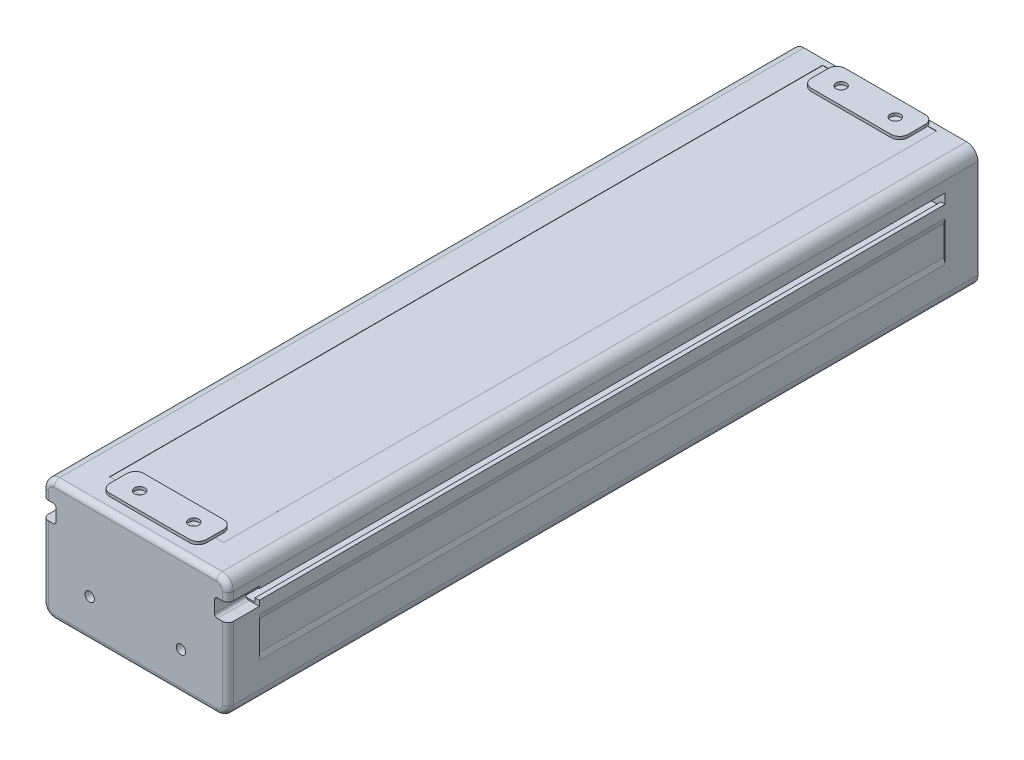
ISO-10303-21;
HEADER;
FILE_DESCRIPTION(('STEP AP214'),'2;1');
FILE_NAME('part.step','',(''),(''),'','','');
FILE_SCHEMA(('AUTOMOTIVE_DESIGN { 1 0 10303 214 1 1 1 1 }'));
ENDSEC;
DATA;
#1=APPLICATION_CONTEXT('core data for automotive mechanical design processes');
#2=APPLICATION_PROTOCOL_DEFINITION('international standard','automotive_design',2000,#1);
#3=PRODUCT_CONTEXT('',#1,'mechanical');
#4=PRODUCT('Part','Part','',(#3));
#5=PRODUCT_RELATED_PRODUCT_CATEGORY('part','',(#4));
#6=PRODUCT_DEFINITION_FORMATION('','',#4);
#7=PRODUCT_DEFINITION_CONTEXT('part definition',#1,'design');
#8=PRODUCT_DEFINITION('design','',#6,#7);
#9=PRODUCT_DEFINITION_SHAPE('','',#8);
#10=(LENGTH_UNIT() NAMED_UNIT(*) SI_UNIT(.MILLI.,.METRE.));
#11=(NAMED_UNIT(*) PLANE_ANGLE_UNIT() SI_UNIT($,.RADIAN.));
#12=(NAMED_UNIT(*) SI_UNIT($,.STERADIAN.) SOLID_ANGLE_UNIT());
#13=UNCERTAINTY_MEASURE_WITH_UNIT(LENGTH_MEASURE(1.E-05),#10,'distance_accuracy_value','');
#14=(GEOMETRIC_REPRESENTATION_CONTEXT(3) GLOBAL_UNCERTAINTY_ASSIGNED_CONTEXT((#13)) GLOBAL_UNIT_ASSIGNED_CONTEXT((#10,
#11,#12)) REPRESENTATION_CONTEXT('',''));
#15=CARTESIAN_POINT('',(0.,0.,0.));
#16=DIRECTION('',(0.,0.,1.));
#17=DIRECTION('',(1.,0.,0.));
#18=AXIS2_PLACEMENT_3D('',#15,#16,#17);
#19=CARTESIAN_POINT('',(-1.13858288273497E-13,43.9000000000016,-67.1611228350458));
#20=DIRECTION('',(0.,1.,0.));
#21=DIRECTION('',(0.,0.,1.));
#22=AXIS2_PLACEMENT_3D('',#19,#20,#21);
#23=PLANE('',#22);
#24=DIRECTION('',(0.,0.,1.));
#25=VECTOR('',#24,1.);
#26=CARTESIAN_POINT('',(-28.5,43.9000000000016,-67.1611228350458));
#27=LINE('',#26,#25);
#28=CARTESIAN_POINT('',(-28.5,43.9,-1.));
#29=VERTEX_POINT('',#28);
#30=CARTESIAN_POINT('',(-28.5,43.9000000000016,260.));
#31=VERTEX_POINT('',#30);
#32=EDGE_CURVE('E1477',#29,#31,#27,.T.);
#33=ORIENTED_EDGE('',*,*,#32,.T.);
#34=DIRECTION('',(-1.,0.,0.));
#35=VECTOR('',#34,1.);
#36=CARTESIAN_POINT('',(-1.13858288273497E-13,43.9000000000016,260.));
#37=LINE('',#36,#35);
#38=CARTESIAN_POINT('',(28.5,43.9000000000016,260.));
#39=VERTEX_POINT('',#38);
#40=EDGE_CURVE('E11',#31,#39,#37,.F.);
#41=ORIENTED_EDGE('',*,*,#40,.T.);
#42=DIRECTION('',(0.,0.,1.));
#43=VECTOR('',#42,1.);
#44=CARTESIAN_POINT('',(28.5,43.9000000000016,-67.1611228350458));
#45=LINE('',#44,#43);
#46=CARTESIAN_POINT('',(28.5,43.9,-1.));
#47=VERTEX_POINT('',#46);
#48=EDGE_CURVE('E1479',#47,#39,#45,.T.);
#49=ORIENTED_EDGE('',*,*,#48,.F.);
#50=DIRECTION('',(1.,0.,0.));
#51=VECTOR('',#50,1.);
#52=CARTESIAN_POINT('',(28.5,43.9,-1.));
#53=LINE('',#52,#51);
#54=CARTESIAN_POINT('',(14.,43.9,-1.));
#55=VERTEX_POINT('',#54);
#56=EDGE_CURVE('E882',#55,#47,#53,.T.);
#57=ORIENTED_EDGE('',*,*,#56,.F.);
#58=CARTESIAN_POINT('',(14.,43.9000000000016,2.));
#59=DIRECTION('',(0.,1.,0.));
#60=DIRECTION('',(0.,0.,1.));
#61=AXIS2_PLACEMENT_3D('',#58,#59,#60);
#62=CIRCLE('',#61,3.);
#63=CARTESIAN_POINT('',(16.8284271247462,43.9000000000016,1.));
#64=VERTEX_POINT('',#63);
#65=EDGE_CURVE('E1576',#55,#64,#62,.F.);
#66=ORIENTED_EDGE('',*,*,#65,.T.);
#67=DIRECTION('',(-1.,0.,0.));
#68=VECTOR('',#67,1.);
#69=CARTESIAN_POINT('',(-20.,43.9000000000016,1.));
#70=LINE('',#69,#68);
#71=CARTESIAN_POINT('',(20.,43.9000000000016,1.));
#72=VERTEX_POINT('',#71);
#73=EDGE_CURVE('E723',#72,#64,#70,.T.);
#74=ORIENTED_EDGE('',*,*,#73,.F.);
#75=DIRECTION('',(0.,0.,-1.));
#76=VECTOR('',#75,1.);
#77=CARTESIAN_POINT('',(20.,43.9000000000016,1.));
#78=LINE('',#77,#76);
#79=CARTESIAN_POINT('',(20.,43.9000000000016,251.));
#80=VERTEX_POINT('',#79);
#81=EDGE_CURVE('E741',#80,#72,#78,.T.);
#82=ORIENTED_EDGE('',*,*,#81,.F.);
#83=DIRECTION('',(1.,0.,0.));
#84=VECTOR('',#83,1.);
#85=CARTESIAN_POINT('',(-20.,43.9000000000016,251.));
#86=LINE('',#85,#84);
#87=CARTESIAN_POINT('',(17.,43.9000000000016,251.));
#88=VERTEX_POINT('',#87);
#89=EDGE_CURVE('E736',#88,#80,#86,.T.);
#90=ORIENTED_EDGE('',*,*,#89,.F.);
#91=DIRECTION('',(0.,0.,1.));
#92=VECTOR('',#91,1.);
#93=CARTESIAN_POINT('',(17.,43.9000000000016,-67.1611228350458));
#94=LINE('',#93,#92);
#95=CARTESIAN_POINT('',(17.,43.9000000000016,254.));
#96=VERTEX_POINT('',#95);
#97=EDGE_CURVE('E1513',#88,#96,#94,.T.);
#98=ORIENTED_EDGE('',*,*,#97,.T.);
#99=CARTESIAN_POINT('',(14.,43.9000000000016,254.));
#100=DIRECTION('',(0.,1.,0.));
#101=DIRECTION('',(0.,0.,1.));
#102=AXIS2_PLACEMENT_3D('',#99,#100,#101);
#103=CIRCLE('',#102,3.);
#104=CARTESIAN_POINT('',(14.,43.9000000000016,257.));
#105=VERTEX_POINT('',#104);
#106=EDGE_CURVE('E1588',#96,#105,#103,.F.);
#107=ORIENTED_EDGE('',*,*,#106,.T.);
#108=DIRECTION('',(1.,0.,0.));
#109=VECTOR('',#108,1.);
#110=CARTESIAN_POINT('',(-17.,43.9000000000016,257.));
#111=LINE('',#110,#109);
#112=CARTESIAN_POINT('',(-14.,43.9000000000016,257.));
#113=VERTEX_POINT('',#112);
#114=EDGE_CURVE('E1298',#113,#105,#111,.T.);
#115=ORIENTED_EDGE('',*,*,#114,.F.);
#116=CARTESIAN_POINT('',(-14.,43.9000000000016,254.));
#117=DIRECTION('',(0.,1.,0.));
#118=DIRECTION('',(0.,0.,1.));
#119=AXIS2_PLACEMENT_3D('',#116,#117,#118);
#120=CIRCLE('',#119,3.);
#121=CARTESIAN_POINT('',(-17.,43.9000000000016,254.));
#122=VERTEX_POINT('',#121);
#123=EDGE_CURVE('E1592',#113,#122,#120,.F.);
#124=ORIENTED_EDGE('',*,*,#123,.T.);
#125=DIRECTION('',(0.,0.,1.));
#126=VECTOR('',#125,1.);
#127=CARTESIAN_POINT('',(-17.,43.9000000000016,245.));
#128=LINE('',#127,#126);
#129=CARTESIAN_POINT('',(-17.,43.9000000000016,251.));
#130=VERTEX_POINT('',#129);
#131=EDGE_CURVE('E1277',#130,#122,#128,.T.);
#132=ORIENTED_EDGE('',*,*,#131,.F.);
#133=CARTESIAN_POINT('',(-20.,43.9000000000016,251.));
#134=VERTEX_POINT('',#133);
#135=EDGE_CURVE('E738',#134,#130,#86,.T.);
#136=ORIENTED_EDGE('',*,*,#135,.F.);
#137=DIRECTION('',(0.,0.,1.));
#138=VECTOR('',#137,1.);
#139=CARTESIAN_POINT('',(-20.,43.9000000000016,1.));
#140=LINE('',#139,#138);
#141=CARTESIAN_POINT('',(-20.,43.9000000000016,1.));
#142=VERTEX_POINT('',#141);
#143=EDGE_CURVE('E733',#142,#134,#140,.T.);
#144=ORIENTED_EDGE('',*,*,#143,.F.);
#145=CARTESIAN_POINT('',(-16.8284271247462,43.9000000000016,1.));
#146=VERTEX_POINT('',#145);
#147=EDGE_CURVE('E745',#146,#142,#70,.T.);
#148=ORIENTED_EDGE('',*,*,#147,.F.);
#149=CARTESIAN_POINT('',(-14.,43.9000000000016,2.));
#150=DIRECTION('',(0.,1.,0.));
#151=DIRECTION('',(0.,0.,1.));
#152=AXIS2_PLACEMENT_3D('',#149,#150,#151);
#153=CIRCLE('',#152,3.);
#154=CARTESIAN_POINT('',(-14.,43.9,-1.));
#155=VERTEX_POINT('',#154);
#156=EDGE_CURVE('E1581',#146,#155,#153,.F.);
#157=ORIENTED_EDGE('',*,*,#156,.T.);
#158=EDGE_CURVE('E879',#29,#155,#53,.T.);
#159=ORIENTED_EDGE('',*,*,#158,.F.);
#160=EDGE_LOOP('',(#33,#41,#49,#57,#66,#74,#82,#90,#98,#107,#115,#124,#132,#136,#144,#148,#157,#159));
#161=FACE_BOUND('',#160,.T.);
#162=ADVANCED_FACE('F38',(#161),#23,.T.);
#163=CARTESIAN_POINT('',(28.5,5.4,10.5));
#164=DIRECTION('',(0.,0.,-1.));
#165=DIRECTION('',(-1.,0.,0.));
#166=AXIS2_PLACEMENT_3D('',#163,#164,#165);
#167=PLANE('',#166);
#168=DIRECTION('',(-0.254493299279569,0.967074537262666,0.));
#169=VECTOR('',#168,1.);
#170=CARTESIAN_POINT('',(32.,16.3000000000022,10.5));
#171=LINE('',#170,#169);
#172=CARTESIAN_POINT('',(32.5,14.4000000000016,10.5));
#173=VERTEX_POINT('',#172);
#174=CARTESIAN_POINT('',(32.,16.3000000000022,10.5));
#175=VERTEX_POINT('',#174);
#176=EDGE_CURVE('E1443',#173,#175,#171,.T.);
#177=ORIENTED_EDGE('',*,*,#176,.F.);
#178=DIRECTION('',(0.,-1.,0.));
#179=VECTOR('',#178,1.);
#180=CARTESIAN_POINT('',(32.5,39.9,10.5));
#181=LINE('',#180,#179);
#182=CARTESIAN_POINT('',(32.5,28.4000000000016,10.5));
#183=VERTEX_POINT('',#182);
#184=EDGE_CURVE('E868',#183,#173,#181,.T.);
#185=ORIENTED_EDGE('',*,*,#184,.F.);
#186=DIRECTION('',(0.254493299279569,0.967074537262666,0.));
#187=VECTOR('',#186,1.);
#188=CARTESIAN_POINT('',(32.5,28.4000000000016,10.5));
#189=LINE('',#188,#187);
#190=CARTESIAN_POINT('',(32.,26.5000000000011,10.5));
#191=VERTEX_POINT('',#190);
#192=EDGE_CURVE('E1434',#191,#183,#189,.T.);
#193=ORIENTED_EDGE('',*,*,#192,.F.);
#194=DIRECTION('',(0.,1.,0.));
#195=VECTOR('',#194,1.);
#196=CARTESIAN_POINT('',(32.,26.5000000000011,10.5));
#197=LINE('',#196,#195);
#198=EDGE_CURVE('E1439',#175,#191,#197,.T.);
#199=ORIENTED_EDGE('',*,*,#198,.F.);
#200=EDGE_LOOP('',(#177,#185,#193,#199));
#201=FACE_BOUND('',#200,.T.);
#202=ADVANCED_FACE('F1794',(#201),#167,.F.);
#203=DIRECTION('',(-1.,0.,0.));
#204=VECTOR('',#203,1.);
#205=CARTESIAN_POINT('',(31.,32.6500000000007,10.5));
#206=LINE('',#205,#204);
#207=CARTESIAN_POINT('',(32.5,32.6500000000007,10.5));
#208=VERTEX_POINT('',#207);
#209=CARTESIAN_POINT('',(31.,32.6500000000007,10.5));
#210=VERTEX_POINT('',#209);
#211=EDGE_CURVE('E1430',#208,#210,#206,.T.);
#212=ORIENTED_EDGE('',*,*,#211,.F.);
#213=CARTESIAN_POINT('',(32.5,36.1500000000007,10.5));
#214=VERTEX_POINT('',#213);
#215=EDGE_CURVE('E871',#214,#208,#181,.T.);
#216=ORIENTED_EDGE('',*,*,#215,.F.);
#217=DIRECTION('',(1.,0.,0.));
#218=VECTOR('',#217,1.);
#219=CARTESIAN_POINT('',(32.5,36.1500000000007,10.5));
#220=LINE('',#219,#218);
#221=CARTESIAN_POINT('',(31.,36.1500000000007,10.5));
#222=VERTEX_POINT('',#221);
#223=EDGE_CURVE('E1405',#222,#214,#220,.T.);
#224=ORIENTED_EDGE('',*,*,#223,.F.);
#225=DIRECTION('',(0.,-1.,0.));
#226=VECTOR('',#225,1.);
#227=CARTESIAN_POINT('',(31.,36.1500000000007,10.5));
#228=LINE('',#227,#226);
#229=CARTESIAN_POINT('',(31.,37.5000000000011,10.5));
#230=VERTEX_POINT('',#229);
#231=EDGE_CURVE('E1410',#230,#222,#228,.T.);
#232=ORIENTED_EDGE('',*,*,#231,.F.);
#233=DIRECTION('',(1.,0.,0.));
#234=VECTOR('',#233,1.);
#235=CARTESIAN_POINT('',(31.,37.5000000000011,10.5));
#236=LINE('',#235,#234);
#237=CARTESIAN_POINT('',(27.3000000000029,37.5000000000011,10.5));
#238=VERTEX_POINT('',#237);
#239=EDGE_CURVE('E1414',#238,#230,#236,.T.);
#240=ORIENTED_EDGE('',*,*,#239,.F.);
#241=DIRECTION('',(0.,1.,0.));
#242=VECTOR('',#241,1.);
#243=CARTESIAN_POINT('',(27.3000000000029,37.5000000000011,10.5));
#244=LINE('',#243,#242);
#245=CARTESIAN_POINT('',(27.3000000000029,31.3000000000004,10.5));
#246=VERTEX_POINT('',#245);
#247=EDGE_CURVE('E1418',#246,#238,#244,.T.);
#248=ORIENTED_EDGE('',*,*,#247,.F.);
#249=DIRECTION('',(-1.,0.,0.));
#250=VECTOR('',#249,1.);
#251=CARTESIAN_POINT('',(27.3000000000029,31.3000000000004,10.5));
#252=LINE('',#251,#250);
#253=CARTESIAN_POINT('',(31.,31.3000000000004,10.5));
#254=VERTEX_POINT('',#253);
#255=EDGE_CURVE('E1422',#254,#246,#252,.T.);
#256=ORIENTED_EDGE('',*,*,#255,.F.);
#257=DIRECTION('',(0.,-1.,0.));
#258=VECTOR('',#257,1.);
#259=CARTESIAN_POINT('',(31.,31.3000000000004,10.5));
#260=LINE('',#259,#258);
#261=EDGE_CURVE('E1426',#210,#254,#260,.T.);
#262=ORIENTED_EDGE('',*,*,#261,.F.);
#263=EDGE_LOOP('',(#212,#216,#224,#232,#240,#248,#256,#262));
#264=FACE_BOUND('',#263,.T.);
#265=ADVANCED_FACE('F1801',(#264),#167,.F.);
#266=DIRECTION('',(1.,0.,0.));
#267=VECTOR('',#266,1.);
#268=CARTESIAN_POINT('',(-32.5,36.1500000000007,10.5));
#269=LINE('',#268,#267);
#270=CARTESIAN_POINT('',(-32.5,36.1500000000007,10.5));
#271=VERTEX_POINT('',#270);
#272=CARTESIAN_POINT('',(-31.,36.1500000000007,10.5));
#273=VERTEX_POINT('',#272);
#274=EDGE_CURVE('E1401',#271,#273,#269,.T.);
#275=ORIENTED_EDGE('',*,*,#274,.F.);
#276=DIRECTION('',(0.,1.,0.));
#277=VECTOR('',#276,1.);
#278=CARTESIAN_POINT('',(-32.5,39.9,10.5));
#279=LINE('',#278,#277);
#280=CARTESIAN_POINT('',(-32.5,32.6500000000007,10.5));
#281=VERTEX_POINT('',#280);
#282=EDGE_CURVE('E867',#281,#271,#279,.T.);
#283=ORIENTED_EDGE('',*,*,#282,.F.);
#284=DIRECTION('',(-1.,0.,0.));
#285=VECTOR('',#284,1.);
#286=CARTESIAN_POINT('',(-31.,32.6500000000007,10.5));
#287=LINE('',#286,#285);
#288=CARTESIAN_POINT('',(-31.,32.6500000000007,10.5));
#289=VERTEX_POINT('',#288);
#290=EDGE_CURVE('E1376',#289,#281,#287,.T.);
#291=ORIENTED_EDGE('',*,*,#290,.F.);
#292=DIRECTION('',(0.,1.,0.));
#293=VECTOR('',#292,1.);
#294=CARTESIAN_POINT('',(-31.,31.3000000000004,10.5));
#295=LINE('',#294,#293);
#296=CARTESIAN_POINT('',(-31.,31.3000000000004,10.5));
#297=VERTEX_POINT('',#296);
#298=EDGE_CURVE('E1381',#297,#289,#295,.T.);
#299=ORIENTED_EDGE('',*,*,#298,.F.);
#300=DIRECTION('',(-1.,0.,0.));
#301=VECTOR('',#300,1.);
#302=CARTESIAN_POINT('',(-27.3000000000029,31.3000000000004,10.5));
#303=LINE('',#302,#301);
#304=CARTESIAN_POINT('',(-27.3000000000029,31.3000000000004,10.5));
#305=VERTEX_POINT('',#304);
#306=EDGE_CURVE('E1385',#305,#297,#303,.T.);
#307=ORIENTED_EDGE('',*,*,#306,.F.);
#308=DIRECTION('',(0.,-1.,0.));
#309=VECTOR('',#308,1.);
#310=CARTESIAN_POINT('',(-27.3000000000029,37.5000000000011,10.5));
#311=LINE('',#310,#309);
#312=CARTESIAN_POINT('',(-27.3000000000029,37.5000000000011,10.5));
#313=VERTEX_POINT('',#312);
#314=EDGE_CURVE('E1389',#313,#305,#311,.T.);
#315=ORIENTED_EDGE('',*,*,#314,.F.);
#316=DIRECTION('',(1.,0.,0.));
#317=VECTOR('',#316,1.);
#318=CARTESIAN_POINT('',(-31.,37.5000000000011,10.5));
#319=LINE('',#318,#317);
#320=CARTESIAN_POINT('',(-31.,37.5000000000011,10.5));
#321=VERTEX_POINT('',#320);
#322=EDGE_CURVE('E1393',#321,#313,#319,.T.);
#323=ORIENTED_EDGE('',*,*,#322,.F.);
#324=DIRECTION('',(0.,1.,0.));
#325=VECTOR('',#324,1.);
#326=CARTESIAN_POINT('',(-31.,36.1500000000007,10.5));
#327=LINE('',#326,#325);
#328=EDGE_CURVE('E1397',#273,#321,#327,.T.);
#329=ORIENTED_EDGE('',*,*,#328,.F.);
#330=EDGE_LOOP('',(#275,#283,#291,#299,#307,#315,#323,#329));
#331=FACE_BOUND('',#330,.T.);
#332=ADVANCED_FACE('F2165',(#331),#167,.F.);
#333=CARTESIAN_POINT('',(0.,0.,251.));
#334=DIRECTION('',(0.,0.,1.));
#335=DIRECTION('',(1.,0.,0.));
#336=AXIS2_PLACEMENT_3D('',#333,#334,#335);
#337=PLANE('',#336);
#338=DIRECTION('',(-0.254493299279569,0.967074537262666,0.));
#339=VECTOR('',#338,1.);
#340=CARTESIAN_POINT('',(32.,16.3000000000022,251.));
#341=LINE('',#340,#339);
#342=CARTESIAN_POINT('',(32.5,14.4000000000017,251.));
#343=VERTEX_POINT('',#342);
#344=CARTESIAN_POINT('',(32.,16.3000000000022,251.));
#345=VERTEX_POINT('',#344);
#346=EDGE_CURVE('E1294',#343,#345,#341,.T.);
#347=ORIENTED_EDGE('',*,*,#346,.T.);
#348=DIRECTION('',(0.,1.,0.));
#349=VECTOR('',#348,1.);
#350=CARTESIAN_POINT('',(32.,26.5000000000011,251.));
#351=LINE('',#350,#349);
#352=CARTESIAN_POINT('',(32.,26.5000000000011,251.));
#353=VERTEX_POINT('',#352);
#354=EDGE_CURVE('E1360',#345,#353,#351,.T.);
#355=ORIENTED_EDGE('',*,*,#354,.T.);
#356=DIRECTION('',(0.254493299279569,0.967074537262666,0.));
#357=VECTOR('',#356,1.);
#358=CARTESIAN_POINT('',(32.5,28.4000000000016,251.));
#359=LINE('',#358,#357);
#360=CARTESIAN_POINT('',(32.5,28.4000000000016,251.));
#361=VERTEX_POINT('',#360);
#362=EDGE_CURVE('E1358',#353,#361,#359,.T.);
#363=ORIENTED_EDGE('',*,*,#362,.T.);
#364=DIRECTION('',(0.,1.,0.));
#365=VECTOR('',#364,1.);
#366=CARTESIAN_POINT('',(32.5,30.8,251.));
#367=LINE('',#366,#365);
#368=EDGE_CURVE('E918',#343,#361,#367,.T.);
#369=ORIENTED_EDGE('',*,*,#368,.F.);
#370=EDGE_LOOP('',(#347,#355,#363,#369));
#371=FACE_BOUND('',#370,.T.);
#372=ADVANCED_FACE('F2155',(#371),#337,.F.);
#373=DIRECTION('',(1.,0.,0.));
#374=VECTOR('',#373,1.);
#375=CARTESIAN_POINT('',(27.3000000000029,31.3000000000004,251.));
#376=LINE('',#375,#374);
#377=CARTESIAN_POINT('',(27.3000000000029,31.3000000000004,251.));
#378=VERTEX_POINT('',#377);
#379=CARTESIAN_POINT('',(27.9339745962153,31.3000000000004,251.));
#380=VERTEX_POINT('',#379);
#381=EDGE_CURVE('E1267',#378,#380,#376,.T.);
#382=ORIENTED_EDGE('',*,*,#381,.F.);
#383=DIRECTION('',(0.,1.,0.));
#384=VECTOR('',#383,1.);
#385=CARTESIAN_POINT('',(27.3000000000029,37.5000000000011,251.));
#386=LINE('',#385,#384);
#387=CARTESIAN_POINT('',(27.3000000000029,37.5000000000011,251.));
#388=VERTEX_POINT('',#387);
#389=EDGE_CURVE('E1345',#378,#388,#386,.T.);
#390=ORIENTED_EDGE('',*,*,#389,.T.);
#391=DIRECTION('',(1.,0.,0.));
#392=VECTOR('',#391,1.);
#393=CARTESIAN_POINT('',(31.,37.5000000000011,251.));
#394=LINE('',#393,#392);
#395=CARTESIAN_POINT('',(31.,37.5000000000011,251.));
#396=VERTEX_POINT('',#395);
#397=EDGE_CURVE('E1343',#388,#396,#394,.T.);
#398=ORIENTED_EDGE('',*,*,#397,.T.);
#399=DIRECTION('',(0.,-1.,0.));
#400=VECTOR('',#399,1.);
#401=CARTESIAN_POINT('',(31.,36.1500000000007,251.));
#402=LINE('',#401,#400);
#403=CARTESIAN_POINT('',(31.,37.,251.));
#404=VERTEX_POINT('',#403);
#405=EDGE_CURVE('E1340',#396,#404,#402,.T.);
#406=ORIENTED_EDGE('',*,*,#405,.T.);
#407=DIRECTION('',(1.,0.,0.));
#408=VECTOR('',#407,1.);
#409=CARTESIAN_POINT('',(32.5,37.,251.));
#410=LINE('',#409,#408);
#411=CARTESIAN_POINT('',(28.8,37.,251.));
#412=VERTEX_POINT('',#411);
#413=EDGE_CURVE('E907',#412,#404,#410,.T.);
#414=ORIENTED_EDGE('',*,*,#413,.F.);
#415=CARTESIAN_POINT('',(28.8,36.,251.));
#416=DIRECTION('',(0.,0.,1.));
#417=DIRECTION('',(1.,0.,0.));
#418=AXIS2_PLACEMENT_3D('',#415,#416,#417);
#419=CIRCLE('',#418,1.);
#420=CARTESIAN_POINT('',(27.8,36.,251.));
#421=VERTEX_POINT('',#420);
#422=EDGE_CURVE('E1221',#412,#421,#419,.T.);
#423=ORIENTED_EDGE('',*,*,#422,.T.);
#424=DIRECTION('',(0.,1.,0.));
#425=VECTOR('',#424,1.);
#426=CARTESIAN_POINT('',(27.8,37.,251.));
#427=LINE('',#426,#425);
#428=CARTESIAN_POINT('',(27.8,31.8,251.));
#429=VERTEX_POINT('',#428);
#430=EDGE_CURVE('E912',#429,#421,#427,.T.);
#431=ORIENTED_EDGE('',*,*,#430,.F.);
#432=CARTESIAN_POINT('',(28.8,31.8,251.));
#433=DIRECTION('',(0.,0.,1.));
#434=DIRECTION('',(1.,0.,0.));
#435=AXIS2_PLACEMENT_3D('',#432,#433,#434);
#436=CIRCLE('',#435,1.);
#437=EDGE_CURVE('E1216',#429,#380,#436,.T.);
#438=ORIENTED_EDGE('',*,*,#437,.T.);
#439=EDGE_LOOP('',(#382,#390,#398,#406,#414,#423,#431,#438));
#440=FACE_BOUND('',#439,.T.);
#441=ADVANCED_FACE('F3573',(#440),#337,.F.);
#442=DIRECTION('',(0.,-1.,0.));
#443=VECTOR('',#442,1.);
#444=CARTESIAN_POINT('',(-31.,36.1500000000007,251.));
#445=LINE('',#444,#443);
#446=CARTESIAN_POINT('',(-31.,37.5000000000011,251.));
#447=VERTEX_POINT('',#446);
#448=CARTESIAN_POINT('',(-31.,37.,251.));
#449=VERTEX_POINT('',#448);
#450=EDGE_CURVE('E1260',#447,#449,#445,.T.);
#451=ORIENTED_EDGE('',*,*,#450,.F.);
#452=DIRECTION('',(1.,0.,0.));
#453=VECTOR('',#452,1.);
#454=CARTESIAN_POINT('',(-31.,37.5000000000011,251.));
#455=LINE('',#454,#453);
#456=CARTESIAN_POINT('',(-27.3000000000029,37.5000000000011,251.));
#457=VERTEX_POINT('',#456);
#458=EDGE_CURVE('E1324',#447,#457,#455,.T.);
#459=ORIENTED_EDGE('',*,*,#458,.T.);
#460=DIRECTION('',(0.,-1.,0.));
#461=VECTOR('',#460,1.);
#462=CARTESIAN_POINT('',(-27.3000000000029,37.5000000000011,251.));
#463=LINE('',#462,#461);
#464=CARTESIAN_POINT('',(-27.3000000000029,31.3000000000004,251.));
#465=VERTEX_POINT('',#464);
#466=EDGE_CURVE('E1322',#457,#465,#463,.T.);
#467=ORIENTED_EDGE('',*,*,#466,.T.);
#468=DIRECTION('',(-1.,0.,0.));
#469=VECTOR('',#468,1.);
#470=CARTESIAN_POINT('',(-27.3000000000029,31.3000000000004,251.));
#471=LINE('',#470,#469);
#472=CARTESIAN_POINT('',(-27.9339745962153,31.3000000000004,251.));
#473=VERTEX_POINT('',#472);
#474=EDGE_CURVE('E1319',#465,#473,#471,.T.);
#475=ORIENTED_EDGE('',*,*,#474,.T.);
#476=CARTESIAN_POINT('',(-28.8,31.8,251.));
#477=DIRECTION('',(0.,0.,1.));
#478=DIRECTION('',(1.,0.,0.));
#479=AXIS2_PLACEMENT_3D('',#476,#477,#478);
#480=CIRCLE('',#479,1.);
#481=CARTESIAN_POINT('',(-27.8,31.8,251.));
#482=VERTEX_POINT('',#481);
#483=EDGE_CURVE('E1225',#473,#482,#480,.T.);
#484=ORIENTED_EDGE('',*,*,#483,.T.);
#485=DIRECTION('',(0.,-1.,0.));
#486=VECTOR('',#485,1.);
#487=CARTESIAN_POINT('',(-27.8,37.,251.));
#488=LINE('',#487,#486);
#489=CARTESIAN_POINT('',(-27.8,36.,251.));
#490=VERTEX_POINT('',#489);
#491=EDGE_CURVE('E928',#490,#482,#488,.T.);
#492=ORIENTED_EDGE('',*,*,#491,.F.);
#493=CARTESIAN_POINT('',(-28.8,36.,251.));
#494=DIRECTION('',(0.,0.,1.));
#495=DIRECTION('',(1.,0.,0.));
#496=AXIS2_PLACEMENT_3D('',#493,#494,#495);
#497=CIRCLE('',#496,1.);
#498=CARTESIAN_POINT('',(-28.8,37.,251.));
#499=VERTEX_POINT('',#498);
#500=EDGE_CURVE('E1231',#490,#499,#497,.T.);
#501=ORIENTED_EDGE('',*,*,#500,.T.);
#502=DIRECTION('',(1.,0.,0.));
#503=VECTOR('',#502,1.);
#504=CARTESIAN_POINT('',(-32.5,37.,251.));
#505=LINE('',#504,#503);
#506=EDGE_CURVE('E934',#449,#499,#505,.T.);
#507=ORIENTED_EDGE('',*,*,#506,.F.);
#508=EDGE_LOOP('',(#451,#459,#467,#475,#484,#492,#501,#507));
#509=FACE_BOUND('',#508,.T.);
#510=ADVANCED_FACE('F1985',(#509),#337,.F.);
#511=CARTESIAN_POINT('',(-21.0000000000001,1.57538738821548E-12,252.));
#512=DIRECTION('',(1.,0.,0.));
#513=DIRECTION('',(0.,1.,0.));
#514=AXIS2_PLACEMENT_3D('',#511,#512,#513);
#515=PLANE('',#514);
#516=DIRECTION('',(0.,0.,1.));
#517=VECTOR('',#516,1.);
#518=CARTESIAN_POINT('',(-21.,1.40000000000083,-67.1611228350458));
#519=LINE('',#518,#517);
#520=CARTESIAN_POINT('',(-21.,1.4,0.));
#521=VERTEX_POINT('',#520);
#522=CARTESIAN_POINT('',(-21.,1.4,252.));
#523=VERTEX_POINT('',#522);
#524=EDGE_CURVE('E1516',#521,#523,#519,.T.);
#525=ORIENTED_EDGE('',*,*,#524,.F.);
#526=DIRECTION('',(0.,-1.,0.));
#527=VECTOR('',#526,1.);
#528=CARTESIAN_POINT('',(-21.0000000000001,1.57538738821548E-12,0.));
#529=LINE('',#528,#527);
#530=CARTESIAN_POINT('',(-21.,0.81568542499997,0.));
#531=VERTEX_POINT('',#530);
#532=EDGE_CURVE('E1099',#521,#531,#529,.T.);
#533=ORIENTED_EDGE('',*,*,#532,.T.);
#534=DIRECTION('',(0.,0.,-1.));
#535=VECTOR('',#534,1.);
#536=CARTESIAN_POINT('',(-21.,0.81568542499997,252.));
#537=LINE('',#536,#535);
#538=CARTESIAN_POINT('',(-21.,0.81568542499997,252.));
#539=VERTEX_POINT('',#538);
#540=EDGE_CURVE('E1170',#539,#531,#537,.T.);
#541=ORIENTED_EDGE('',*,*,#540,.F.);
#542=DIRECTION('',(0.,-1.,0.));
#543=VECTOR('',#542,1.);
#544=CARTESIAN_POINT('',(-21.0000000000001,1.57538738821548E-12,252.));
#545=LINE('',#544,#543);
#546=EDGE_CURVE('E1100',#523,#539,#545,.T.);
#547=ORIENTED_EDGE('',*,*,#546,.F.);
#548=EDGE_LOOP('',(#525,#533,#541,#547));
#549=FACE_BOUND('',#548,.T.);
#550=ADVANCED_FACE('F1981',(#549),#515,.F.);
#551=CARTESIAN_POINT('',(20.9999999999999,-2.39337699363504E-12,252.));
#552=DIRECTION('',(-1.,1.13970333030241E-13,0.));
#553=DIRECTION('',(-1.13970333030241E-13,-1.,0.));
#554=AXIS2_PLACEMENT_3D('',#551,#552,#553);
#555=PLANE('',#554);
#556=DIRECTION('',(0.,0.,-1.));
#557=VECTOR('',#556,1.);
#558=CARTESIAN_POINT('',(21.0000000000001,1.40000000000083,-67.1611228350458));
#559=LINE('',#558,#557);
#560=CARTESIAN_POINT('',(21.,1.4,252.));
#561=VERTEX_POINT('',#560);
#562=CARTESIAN_POINT('',(21.0000000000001,1.4,0.));
#563=VERTEX_POINT('',#562);
#564=EDGE_CURVE('E1518',#561,#563,#559,.T.);
#565=ORIENTED_EDGE('',*,*,#564,.F.);
#566=DIRECTION('',(1.13970333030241E-13,1.,0.));
#567=VECTOR('',#566,1.);
#568=CARTESIAN_POINT('',(20.9999999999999,-2.39337699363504E-12,252.));
#569=LINE('',#568,#567);
#570=CARTESIAN_POINT('',(21.,0.815685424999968,252.));
#571=VERTEX_POINT('',#570);
#572=EDGE_CURVE('E1117',#571,#561,#569,.T.);
#573=ORIENTED_EDGE('',*,*,#572,.F.);
#574=DIRECTION('',(0.,0.,-1.));
#575=VECTOR('',#574,1.);
#576=CARTESIAN_POINT('',(21.,0.815685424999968,252.));
#577=LINE('',#576,#575);
#578=CARTESIAN_POINT('',(21.,0.815685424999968,0.));
#579=VERTEX_POINT('',#578);
#580=EDGE_CURVE('E1120',#571,#579,#577,.T.);
#581=ORIENTED_EDGE('',*,*,#580,.T.);
#582=DIRECTION('',(1.13970333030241E-13,1.,0.));
#583=VECTOR('',#582,1.);
#584=CARTESIAN_POINT('',(20.9999999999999,-2.39337699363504E-12,0.));
#585=LINE('',#584,#583);
#586=EDGE_CURVE('E1103',#579,#563,#585,.T.);
#587=ORIENTED_EDGE('',*,*,#586,.T.);
#588=EDGE_LOOP('',(#565,#573,#581,#587));
#589=FACE_BOUND('',#588,.T.);
#590=ADVANCED_FACE('F1984',(#589),#555,.F.);
#591=CARTESIAN_POINT('',(0.,0.,0.));
#592=DIRECTION('',(0.,0.,1.));
#593=DIRECTION('',(1.,0.,0.));
#594=AXIS2_PLACEMENT_3D('',#591,#592,#593);
#595=PLANE('',#594);
#596=DIRECTION('',(0.707106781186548,-0.707106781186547,0.));
#597=VECTOR('',#596,1.);
#598=CARTESIAN_POINT('',(4.5,4.5,0.));
#599=LINE('',#598,#597);
#600=CARTESIAN_POINT('',(8.5,0.5,0.));
#601=VERTEX_POINT('',#600);
#602=CARTESIAN_POINT('',(9.,0.,0.));
#603=VERTEX_POINT('',#602);
#604=EDGE_CURVE('E1133',#601,#603,#599,.T.);
#605=ORIENTED_EDGE('',*,*,#604,.F.);
#606=DIRECTION('',(1.,0.,0.));
#607=VECTOR('',#606,1.);
#608=CARTESIAN_POINT('',(0.,0.5,0.));
#609=LINE('',#608,#607);
#610=CARTESIAN_POINT('',(-8.5,0.5,0.));
#611=VERTEX_POINT('',#610);
#612=EDGE_CURVE('E1130',#611,#601,#609,.T.);
#613=ORIENTED_EDGE('',*,*,#612,.F.);
#614=DIRECTION('',(0.707106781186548,0.707106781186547,0.));
#615=VECTOR('',#614,1.);
#616=CARTESIAN_POINT('',(-4.5,4.5,0.));
#617=LINE('',#616,#615);
#618=CARTESIAN_POINT('',(-9.,0.,0.));
#619=VERTEX_POINT('',#618);
#620=EDGE_CURVE('E1127',#619,#611,#617,.T.);
#621=ORIENTED_EDGE('',*,*,#620,.F.);
#622=DIRECTION('',(1.,0.,0.));
#623=VECTOR('',#622,1.);
#624=CARTESIAN_POINT('',(0.,0.,0.));
#625=LINE('',#624,#623);
#626=CARTESIAN_POINT('',(-20.1843145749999,0.,0.));
#627=VERTEX_POINT('',#626);
#628=EDGE_CURVE('E1124',#627,#619,#625,.T.);
#629=ORIENTED_EDGE('',*,*,#628,.F.);
#630=DIRECTION('',(0.707106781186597,-0.707106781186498,0.));
#631=VECTOR('',#630,1.);
#632=CARTESIAN_POINT('',(-10.0921572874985,-10.0921572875,0.));
#633=LINE('',#632,#631);
#634=EDGE_CURVE('E1122',#531,#627,#633,.T.);
#635=ORIENTED_EDGE('',*,*,#634,.F.);
#636=ORIENTED_EDGE('',*,*,#532,.F.);
#637=DIRECTION('',(0.,-1.,0.));
#638=VECTOR('',#637,1.);
#639=CARTESIAN_POINT('',(-21.,9.5,0.));
#640=LINE('',#639,#638);
#641=CARTESIAN_POINT('',(-21.,9.5,0.));
#642=VERTEX_POINT('',#641);
#643=EDGE_CURVE('E856',#642,#521,#640,.T.);
#644=ORIENTED_EDGE('',*,*,#643,.F.);
#645=DIRECTION('',(-1.,0.,0.));
#646=VECTOR('',#645,1.);
#647=CARTESIAN_POINT('',(-21.,9.5,0.));
#648=LINE('',#647,#646);
#649=CARTESIAN_POINT('',(21.0000000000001,9.5,0.));
#650=VERTEX_POINT('',#649);
#651=EDGE_CURVE('E852',#650,#642,#648,.T.);
#652=ORIENTED_EDGE('',*,*,#651,.F.);
#653=DIRECTION('',(0.,-1.,0.));
#654=VECTOR('',#653,1.);
#655=CARTESIAN_POINT('',(21.0000000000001,9.5,0.));
#656=LINE('',#655,#654);
#657=EDGE_CURVE('E855',#650,#563,#656,.T.);
#658=ORIENTED_EDGE('',*,*,#657,.T.);
#659=ORIENTED_EDGE('',*,*,#586,.F.);
#660=DIRECTION('',(0.7071067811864,0.707106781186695,0.));
#661=VECTOR('',#660,1.);
#662=CARTESIAN_POINT('',(10.0921572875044,-10.0921572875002,0.));
#663=LINE('',#662,#661);
#664=CARTESIAN_POINT('',(20.1843145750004,0.,0.));
#665=VERTEX_POINT('',#664);
#666=EDGE_CURVE('E1138',#665,#579,#663,.T.);
#667=ORIENTED_EDGE('',*,*,#666,.F.);
#668=DIRECTION('',(1.,0.,0.));
#669=VECTOR('',#668,1.);
#670=CARTESIAN_POINT('',(0.,0.,0.));
#671=LINE('',#670,#669);
#672=EDGE_CURVE('E1136',#603,#665,#671,.T.);
#673=ORIENTED_EDGE('',*,*,#672,.F.);
#674=EDGE_LOOP('',(#605,#613,#621,#629,#635,#636,#644,#652,#658,#659,#667,#673));
#675=FACE_BOUND('',#674,.T.);
#676=ADVANCED_FACE('F2024',(#675),#595,.F.);
#677=CARTESIAN_POINT('',(-11.5,0.,5.));
#678=DIRECTION('',(0.,-1.,0.));
#679=DIRECTION('',(0.,0.,-1.));
#680=AXIS2_PLACEMENT_3D('',#677,#678,#679);
#681=CYLINDRICAL_SURFACE('',#680,4.);
#682=CARTESIAN_POINT('',(-11.5,0.,5.));
#683=DIRECTION('',(0.,-1.,0.));
#684=DIRECTION('',(0.,0.,-1.));
#685=AXIS2_PLACEMENT_3D('',#682,#683,#684);
#686=CIRCLE('',#685,4.);
#687=CARTESIAN_POINT('',(-9.,0.,8.1224989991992));
#688=VERTEX_POINT('',#687);
#689=CARTESIAN_POINT('',(-9.,0.,1.87750100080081));
#690=VERTEX_POINT('',#689);
#691=EDGE_CURVE('E1094',#688,#690,#686,.T.);
#692=ORIENTED_EDGE('',*,*,#691,.T.);
#693=CARTESIAN_POINT('',(-11.5,-2.5,5.));
#694=DIRECTION('',(-0.707106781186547,0.707106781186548,0.));
#695=DIRECTION('',(-0.707106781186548,-0.707106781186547,0.));
#696=AXIS2_PLACEMENT_3D('',#693,#694,#695);
#697=ELLIPSE('',#696,5.65685424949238,4.);
#698=CARTESIAN_POINT('',(-8.5,0.5,2.35424868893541));
#699=VERTEX_POINT('',#698);
#700=EDGE_CURVE('E1173',#699,#690,#697,.T.);
#701=ORIENTED_EDGE('',*,*,#700,.F.);
#702=CARTESIAN_POINT('',(-11.5,0.5,5.));
#703=DIRECTION('',(0.,1.,0.));
#704=DIRECTION('',(0.,0.,1.));
#705=AXIS2_PLACEMENT_3D('',#702,#703,#704);
#706=CIRCLE('',#705,4.);
#707=CARTESIAN_POINT('',(-8.5,0.5,7.64575131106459));
#708=VERTEX_POINT('',#707);
#709=EDGE_CURVE('E1096',#708,#699,#706,.T.);
#710=ORIENTED_EDGE('',*,*,#709,.F.);
#711=EDGE_CURVE('E1090',#688,#708,#697,.T.);
#712=ORIENTED_EDGE('',*,*,#711,.F.);
#713=EDGE_LOOP('',(#692,#701,#710,#712));
#714=FACE_BOUND('',#713,.T.);
#715=CARTESIAN_POINT('',(-11.5,1.4,5.));
#716=DIRECTION('',(0.,1.,0.));
#717=DIRECTION('',(0.,0.,1.));
#718=AXIS2_PLACEMENT_3D('',#715,#716,#717);
#719=CIRCLE('',#718,4.);
#720=CARTESIAN_POINT('',(-11.5,1.4,9.));
#721=VERTEX_POINT('',#720);
#722=EDGE_CURVE('E902',#721,#721,#719,.F.);
#723=ORIENTED_EDGE('',*,*,#722,.F.);
#724=EDGE_LOOP('',(#723));
#725=FACE_BOUND('',#724,.T.);
#726=ADVANCED_FACE('F2028',(#714,#725),#681,.F.);
#727=CARTESIAN_POINT('',(11.5,0.,5.));
#728=DIRECTION('',(0.,-1.,0.));
#729=DIRECTION('',(0.,0.,-1.));
#730=AXIS2_PLACEMENT_3D('',#727,#728,#729);
#731=CYLINDRICAL_SURFACE('',#730,4.);
#732=CARTESIAN_POINT('',(11.5,0.,5.));
#733=DIRECTION('',(0.,-1.,0.));
#734=DIRECTION('',(0.,0.,-1.));
#735=AXIS2_PLACEMENT_3D('',#732,#733,#734);
#736=CIRCLE('',#735,4.);
#737=CARTESIAN_POINT('',(9.,0.,1.8775010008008));
#738=VERTEX_POINT('',#737);
#739=CARTESIAN_POINT('',(9.,0.,8.1224989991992));
#740=VERTEX_POINT('',#739);
#741=EDGE_CURVE('E1086',#738,#740,#736,.T.);
#742=ORIENTED_EDGE('',*,*,#741,.T.);
#743=CARTESIAN_POINT('',(11.5,-2.5,5.));
#744=DIRECTION('',(0.707106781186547,0.707106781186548,0.));
#745=DIRECTION('',(0.707106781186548,-0.707106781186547,0.));
#746=AXIS2_PLACEMENT_3D('',#743,#744,#745);
#747=ELLIPSE('',#746,5.65685424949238,4.);
#748=CARTESIAN_POINT('',(8.5,0.5,7.6457513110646));
#749=VERTEX_POINT('',#748);
#750=EDGE_CURVE('E1089',#749,#740,#747,.T.);
#751=ORIENTED_EDGE('',*,*,#750,.F.);
#752=CARTESIAN_POINT('',(11.5,0.5,5.));
#753=DIRECTION('',(0.,1.,0.));
#754=DIRECTION('',(0.,0.,1.));
#755=AXIS2_PLACEMENT_3D('',#752,#753,#754);
#756=CIRCLE('',#755,4.);
#757=CARTESIAN_POINT('',(8.5,0.5,2.35424868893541));
#758=VERTEX_POINT('',#757);
#759=EDGE_CURVE('E1091',#758,#749,#756,.T.);
#760=ORIENTED_EDGE('',*,*,#759,.F.);
#761=EDGE_CURVE('E1178',#738,#758,#747,.T.);
#762=ORIENTED_EDGE('',*,*,#761,.F.);
#763=EDGE_LOOP('',(#742,#751,#760,#762));
#764=FACE_BOUND('',#763,.T.);
#765=CARTESIAN_POINT('',(11.5,1.4,5.));
#766=DIRECTION('',(0.,1.,0.));
#767=DIRECTION('',(0.,0.,1.));
#768=AXIS2_PLACEMENT_3D('',#765,#766,#767);
#769=CIRCLE('',#768,4.);
#770=CARTESIAN_POINT('',(11.5,1.4,9.));
#771=VERTEX_POINT('',#770);
#772=EDGE_CURVE('E906',#771,#771,#769,.F.);
#773=ORIENTED_EDGE('',*,*,#772,.F.);
#774=EDGE_LOOP('',(#773));
#775=FACE_BOUND('',#774,.T.);
#776=ADVANCED_FACE('F2033',(#764,#775),#731,.F.);
#777=CARTESIAN_POINT('',(0.,0.,252.));
#778=DIRECTION('',(0.,0.,1.));
#779=DIRECTION('',(1.,0.,0.));
#780=AXIS2_PLACEMENT_3D('',#777,#778,#779);
#781=PLANE('',#780);
#782=DIRECTION('',(1.,0.,0.));
#783=VECTOR('',#782,1.);
#784=CARTESIAN_POINT('',(0.,0.5,252.));
#785=LINE('',#784,#783);
#786=CARTESIAN_POINT('',(-8.5,0.5,252.));
#787=VERTEX_POINT('',#786);
#788=CARTESIAN_POINT('',(8.5,0.5,252.));
#789=VERTEX_POINT('',#788);
#790=EDGE_CURVE('E1109',#787,#789,#785,.T.);
#791=ORIENTED_EDGE('',*,*,#790,.T.);
#792=DIRECTION('',(0.707106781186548,-0.707106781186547,0.));
#793=VECTOR('',#792,1.);
#794=CARTESIAN_POINT('',(4.5,4.5,252.));
#795=LINE('',#794,#793);
#796=CARTESIAN_POINT('',(9.,0.,252.));
#797=VERTEX_POINT('',#796);
#798=EDGE_CURVE('E1111',#789,#797,#795,.T.);
#799=ORIENTED_EDGE('',*,*,#798,.T.);
#800=DIRECTION('',(1.,0.,0.));
#801=VECTOR('',#800,1.);
#802=CARTESIAN_POINT('',(0.,0.,252.));
#803=LINE('',#802,#801);
#804=CARTESIAN_POINT('',(20.1843145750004,0.,252.));
#805=VERTEX_POINT('',#804);
#806=EDGE_CURVE('E1113',#797,#805,#803,.T.);
#807=ORIENTED_EDGE('',*,*,#806,.T.);
#808=DIRECTION('',(0.7071067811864,0.707106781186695,0.));
#809=VECTOR('',#808,1.);
#810=CARTESIAN_POINT('',(10.0921572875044,-10.0921572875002,252.));
#811=LINE('',#810,#809);
#812=EDGE_CURVE('E1115',#805,#571,#811,.T.);
#813=ORIENTED_EDGE('',*,*,#812,.T.);
#814=ORIENTED_EDGE('',*,*,#572,.T.);
#815=DIRECTION('',(0.,-1.,0.));
#816=VECTOR('',#815,1.);
#817=CARTESIAN_POINT('',(21.,9.5,252.));
#818=LINE('',#817,#816);
#819=CARTESIAN_POINT('',(21.,9.5,252.));
#820=VERTEX_POINT('',#819);
#821=EDGE_CURVE('E832',#820,#561,#818,.T.);
#822=ORIENTED_EDGE('',*,*,#821,.F.);
#823=DIRECTION('',(1.,0.,0.));
#824=VECTOR('',#823,1.);
#825=CARTESIAN_POINT('',(21.,9.5,252.));
#826=LINE('',#825,#824);
#827=CARTESIAN_POINT('',(-21.,9.5,252.));
#828=VERTEX_POINT('',#827);
#829=EDGE_CURVE('E828',#828,#820,#826,.T.);
#830=ORIENTED_EDGE('',*,*,#829,.F.);
#831=DIRECTION('',(0.,-1.,0.));
#832=VECTOR('',#831,1.);
#833=CARTESIAN_POINT('',(-21.,9.5,252.));
#834=LINE('',#833,#832);
#835=EDGE_CURVE('E836',#828,#523,#834,.T.);
#836=ORIENTED_EDGE('',*,*,#835,.T.);
#837=ORIENTED_EDGE('',*,*,#546,.T.);
#838=DIRECTION('',(0.707106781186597,-0.707106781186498,0.));
#839=VECTOR('',#838,1.);
#840=CARTESIAN_POINT('',(-10.0921572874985,-10.0921572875,252.));
#841=LINE('',#840,#839);
#842=CARTESIAN_POINT('',(-20.1843145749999,0.,252.));
#843=VERTEX_POINT('',#842);
#844=EDGE_CURVE('E1102',#539,#843,#841,.T.);
#845=ORIENTED_EDGE('',*,*,#844,.T.);
#846=DIRECTION('',(1.,0.,0.));
#847=VECTOR('',#846,1.);
#848=CARTESIAN_POINT('',(0.,0.,252.));
#849=LINE('',#848,#847);
#850=CARTESIAN_POINT('',(-9.,0.,252.));
#851=VERTEX_POINT('',#850);
#852=EDGE_CURVE('E1105',#843,#851,#849,.T.);
#853=ORIENTED_EDGE('',*,*,#852,.T.);
#854=DIRECTION('',(0.707106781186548,0.707106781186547,0.));
#855=VECTOR('',#854,1.);
#856=CARTESIAN_POINT('',(-4.5,4.5,252.));
#857=LINE('',#856,#855);
#858=EDGE_CURVE('E1107',#851,#787,#857,.T.);
#859=ORIENTED_EDGE('',*,*,#858,.T.);
#860=EDGE_LOOP('',(#791,#799,#807,#813,#814,#822,#830,#836,#837,#845,#853,#859));
#861=FACE_BOUND('',#860,.T.);
#862=ADVANCED_FACE('F2030',(#861),#781,.T.);
#863=CARTESIAN_POINT('',(-4.5,4.5,252.));
#864=DIRECTION('',(-0.707106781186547,0.707106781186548,0.));
#865=DIRECTION('',(-0.707106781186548,-0.707106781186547,0.));
#866=AXIS2_PLACEMENT_3D('',#863,#864,#865);
#867=PLANE('',#866);
#868=DIRECTION('',(0.,0.,-1.));
#869=VECTOR('',#868,1.);
#870=CARTESIAN_POINT('',(-9.,0.,252.));
#871=LINE('',#870,#869);
#872=CARTESIAN_POINT('',(-9.,0.,250.122498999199));
#873=VERTEX_POINT('',#872);
#874=EDGE_CURVE('E1163',#851,#873,#871,.T.);
#875=ORIENTED_EDGE('',*,*,#874,.T.);
#876=CARTESIAN_POINT('',(-11.5,-2.5,247.));
#877=DIRECTION('',(-0.707106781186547,0.707106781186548,0.));
#878=DIRECTION('',(-0.707106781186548,-0.707106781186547,0.));
#879=AXIS2_PLACEMENT_3D('',#876,#877,#878);
#880=ELLIPSE('',#879,5.65685424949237,3.99999999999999);
#881=CARTESIAN_POINT('',(-8.5,0.5,249.645751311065));
#882=VERTEX_POINT('',#881);
#883=EDGE_CURVE('E969',#873,#882,#880,.T.);
#884=ORIENTED_EDGE('',*,*,#883,.T.);
#885=DIRECTION('',(0.,0.,-1.));
#886=VECTOR('',#885,1.);
#887=CARTESIAN_POINT('',(-8.5,0.5,252.));
#888=LINE('',#887,#886);
#889=EDGE_CURVE('E1158',#787,#882,#888,.T.);
#890=ORIENTED_EDGE('',*,*,#889,.F.);
#891=ORIENTED_EDGE('',*,*,#858,.F.);
#892=EDGE_LOOP('',(#875,#884,#890,#891));
#893=FACE_BOUND('',#892,.T.);
#894=ADVANCED_FACE('F2003',(#893),#867,.F.);
#895=CARTESIAN_POINT('',(0.,0.,252.));
#896=DIRECTION('',(0.,1.,0.));
#897=DIRECTION('',(0.,0.,1.));
#898=AXIS2_PLACEMENT_3D('',#895,#896,#897);
#899=PLANE('',#898);
#900=CARTESIAN_POINT('',(11.5,0.,27.));
#901=DIRECTION('',(0.,1.,0.));
#902=DIRECTION('',(0.,0.,1.));
#903=AXIS2_PLACEMENT_3D('',#900,#901,#902);
#904=CIRCLE('',#903,2.1);
#905=CARTESIAN_POINT('',(11.5,0.,29.1));
#906=VERTEX_POINT('',#905);
#907=EDGE_CURVE('E1047',#906,#906,#904,.T.);
#908=ORIENTED_EDGE('',*,*,#907,.T.);
#909=EDGE_LOOP('',(#908));
#910=FACE_BOUND('',#909,.T.);
#911=CARTESIAN_POINT('',(11.5,0.,67.));
#912=DIRECTION('',(0.,1.,0.));
#913=DIRECTION('',(0.,0.,1.));
#914=AXIS2_PLACEMENT_3D('',#911,#912,#913);
#915=CIRCLE('',#914,2.1);
#916=CARTESIAN_POINT('',(11.5,0.,69.1));
#917=VERTEX_POINT('',#916);
#918=EDGE_CURVE('E1035',#917,#917,#915,.T.);
#919=ORIENTED_EDGE('',*,*,#918,.T.);
#920=EDGE_LOOP('',(#919));
#921=FACE_BOUND('',#920,.T.);
#922=CARTESIAN_POINT('',(11.5,0.,107.));
#923=DIRECTION('',(0.,1.,0.));
#924=DIRECTION('',(0.,0.,1.));
#925=AXIS2_PLACEMENT_3D('',#922,#923,#924);
#926=CIRCLE('',#925,2.1);
#927=CARTESIAN_POINT('',(11.5,0.,109.1));
#928=VERTEX_POINT('',#927);
#929=EDGE_CURVE('E1023',#928,#928,#926,.T.);
#930=ORIENTED_EDGE('',*,*,#929,.T.);
#931=EDGE_LOOP('',(#930));
#932=FACE_BOUND('',#931,.T.);
#933=CARTESIAN_POINT('',(11.5,0.,147.));
#934=DIRECTION('',(0.,1.,0.));
#935=DIRECTION('',(0.,0.,1.));
#936=AXIS2_PLACEMENT_3D('',#933,#934,#935);
#937=CIRCLE('',#936,2.1);
#938=CARTESIAN_POINT('',(11.5,0.,149.1));
#939=VERTEX_POINT('',#938);
#940=EDGE_CURVE('E1011',#939,#939,#937,.T.);
#941=ORIENTED_EDGE('',*,*,#940,.T.);
#942=EDGE_LOOP('',(#941));
#943=FACE_BOUND('',#942,.T.);
#944=CARTESIAN_POINT('',(11.5,0.,187.));
#945=DIRECTION('',(0.,1.,0.));
#946=DIRECTION('',(0.,0.,1.));
#947=AXIS2_PLACEMENT_3D('',#944,#945,#946);
#948=CIRCLE('',#947,2.1);
#949=CARTESIAN_POINT('',(11.5,0.,189.1));
#950=VERTEX_POINT('',#949);
#951=EDGE_CURVE('E999',#950,#950,#948,.T.);
#952=ORIENTED_EDGE('',*,*,#951,.T.);
#953=EDGE_LOOP('',(#952));
#954=FACE_BOUND('',#953,.T.);
#955=CARTESIAN_POINT('',(11.5,0.,227.));
#956=DIRECTION('',(0.,1.,0.));
#957=DIRECTION('',(0.,0.,1.));
#958=AXIS2_PLACEMENT_3D('',#955,#956,#957);
#959=CIRCLE('',#958,2.1);
#960=CARTESIAN_POINT('',(11.5,0.,229.1));
#961=VERTEX_POINT('',#960);
#962=EDGE_CURVE('E987',#961,#961,#959,.T.);
#963=ORIENTED_EDGE('',*,*,#962,.T.);
#964=EDGE_LOOP('',(#963));
#965=FACE_BOUND('',#964,.T.);
#966=CARTESIAN_POINT('',(11.5,0.,247.));
#967=DIRECTION('',(0.,-1.,0.));
#968=DIRECTION('',(0.,0.,-1.));
#969=AXIS2_PLACEMENT_3D('',#966,#967,#968);
#970=CIRCLE('',#969,3.99999999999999);
#971=CARTESIAN_POINT('',(9.,0.,243.877501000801));
#972=VERTEX_POINT('',#971);
#973=CARTESIAN_POINT('',(9.,0.,250.122498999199));
#974=VERTEX_POINT('',#973);
#975=EDGE_CURVE('E970',#972,#974,#970,.T.);
#976=ORIENTED_EDGE('',*,*,#975,.F.);
#977=DIRECTION('',(0.,0.,-1.));
#978=VECTOR('',#977,1.);
#979=CARTESIAN_POINT('',(9.,0.,252.));
#980=LINE('',#979,#978);
#981=CARTESIAN_POINT('',(9.,0.,19.1224989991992));
#982=VERTEX_POINT('',#981);
#983=EDGE_CURVE('E1152',#972,#982,#980,.T.);
#984=ORIENTED_EDGE('',*,*,#983,.T.);
#985=CARTESIAN_POINT('',(11.5,0.,16.));
#986=DIRECTION('',(0.,-1.,0.));
#987=DIRECTION('',(0.,0.,-1.));
#988=AXIS2_PLACEMENT_3D('',#985,#986,#987);
#989=CIRCLE('',#988,4.);
#990=CARTESIAN_POINT('',(9.,0.,12.8775010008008));
#991=VERTEX_POINT('',#990);
#992=EDGE_CURVE('E1056',#991,#982,#989,.T.);
#993=ORIENTED_EDGE('',*,*,#992,.F.);
#994=EDGE_CURVE('E3680',#991,#740,#980,.T.);
#995=ORIENTED_EDGE('',*,*,#994,.T.);
#996=ORIENTED_EDGE('',*,*,#741,.F.);
#997=EDGE_CURVE('E1147',#738,#603,#980,.T.);
#998=ORIENTED_EDGE('',*,*,#997,.T.);
#999=ORIENTED_EDGE('',*,*,#672,.T.);
#1000=DIRECTION('',(0.,0.,-1.));
#1001=VECTOR('',#1000,1.);
#1002=CARTESIAN_POINT('',(20.1843145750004,0.,252.));
#1003=LINE('',#1002,#1001);
#1004=EDGE_CURVE('E1144',#805,#665,#1003,.T.);
#1005=ORIENTED_EDGE('',*,*,#1004,.F.);
#1006=ORIENTED_EDGE('',*,*,#806,.F.);
#1007=EDGE_CURVE('E1148',#797,#974,#980,.T.);
#1008=ORIENTED_EDGE('',*,*,#1007,.T.);
#1009=EDGE_LOOP('',(#976,#984,#993,#995,#996,#998,#999,#1005,#1006,#1008));
#1010=FACE_BOUND('',#1009,.T.);
#1011=ADVANCED_FACE('F2014',(#910,#921,#932,#943,#954,#965,#1010),#899,.F.);
#1012=CARTESIAN_POINT('',(4.5,4.5,252.));
#1013=DIRECTION('',(0.707106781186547,0.707106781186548,0.));
#1014=DIRECTION('',(-0.707106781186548,0.707106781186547,0.));
#1015=AXIS2_PLACEMENT_3D('',#1012,#1013,#1014);
#1016=PLANE('',#1015);
#1017=ORIENTED_EDGE('',*,*,#983,.F.);
#1018=CARTESIAN_POINT('',(11.5,-2.5,247.));
#1019=DIRECTION('',(0.707106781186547,0.707106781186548,0.));
#1020=DIRECTION('',(0.707106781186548,-0.707106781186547,0.));
#1021=AXIS2_PLACEMENT_3D('',#1018,#1019,#1020);
#1022=ELLIPSE('',#1021,5.65685424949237,3.99999999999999);
#1023=CARTESIAN_POINT('',(8.5,0.5,244.354248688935));
#1024=VERTEX_POINT('',#1023);
#1025=EDGE_CURVE('E1189',#972,#1024,#1022,.T.);
#1026=ORIENTED_EDGE('',*,*,#1025,.T.);
#1027=DIRECTION('',(0.,0.,-1.));
#1028=VECTOR('',#1027,1.);
#1029=CARTESIAN_POINT('',(8.5,0.5,252.));
#1030=LINE('',#1029,#1028);
#1031=CARTESIAN_POINT('',(8.5,0.5,18.6457513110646));
#1032=VERTEX_POINT('',#1031);
#1033=EDGE_CURVE('E1157',#1024,#1032,#1030,.T.);
#1034=ORIENTED_EDGE('',*,*,#1033,.T.);
#1035=CARTESIAN_POINT('',(11.5,-2.5,16.));
#1036=DIRECTION('',(0.707106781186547,0.707106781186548,0.));
#1037=DIRECTION('',(0.707106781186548,-0.707106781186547,0.));
#1038=AXIS2_PLACEMENT_3D('',#1035,#1036,#1037);
#1039=ELLIPSE('',#1038,5.65685424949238,4.);
#1040=EDGE_CURVE('E1182',#1032,#982,#1039,.T.);
#1041=ORIENTED_EDGE('',*,*,#1040,.T.);
#1042=EDGE_LOOP('',(#1017,#1026,#1034,#1041));
#1043=FACE_BOUND('',#1042,.T.);
#1044=ADVANCED_FACE('F2012',(#1043),#1016,.F.);
#1045=ORIENTED_EDGE('',*,*,#994,.F.);
#1046=CARTESIAN_POINT('',(8.5,0.5,13.3542486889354));
#1047=VERTEX_POINT('',#1046);
#1048=EDGE_CURVE('E1185',#991,#1047,#1039,.T.);
#1049=ORIENTED_EDGE('',*,*,#1048,.T.);
#1050=EDGE_CURVE('E3091',#1047,#749,#1030,.T.);
#1051=ORIENTED_EDGE('',*,*,#1050,.T.);
#1052=ORIENTED_EDGE('',*,*,#750,.T.);
#1053=EDGE_LOOP('',(#1045,#1049,#1051,#1052));
#1054=FACE_BOUND('',#1053,.T.);
#1055=ADVANCED_FACE('F1997',(#1054),#1016,.F.);
#1056=CARTESIAN_POINT('',(0.,0.,252.));
#1057=DIRECTION('',(0.,1.,0.));
#1058=DIRECTION('',(0.,0.,1.));
#1059=AXIS2_PLACEMENT_3D('',#1056,#1057,#1058);
#1060=PLANE('',#1059);
#1061=CARTESIAN_POINT('',(-11.5,0.,227.));
#1062=DIRECTION('',(0.,1.,0.));
#1063=DIRECTION('',(0.,0.,1.));
#1064=AXIS2_PLACEMENT_3D('',#1061,#1062,#1063);
#1065=CIRCLE('',#1064,2.1);
#1066=CARTESIAN_POINT('',(-11.5,0.,229.1));
#1067=VERTEX_POINT('',#1066);
#1068=EDGE_CURVE('E993',#1067,#1067,#1065,.T.);
#1069=ORIENTED_EDGE('',*,*,#1068,.T.);
#1070=EDGE_LOOP('',(#1069));
#1071=FACE_BOUND('',#1070,.T.);
#1072=CARTESIAN_POINT('',(-11.5,0.,187.));
#1073=DIRECTION('',(0.,1.,0.));
#1074=DIRECTION('',(0.,0.,1.));
#1075=AXIS2_PLACEMENT_3D('',#1072,#1073,#1074);
#1076=CIRCLE('',#1075,2.1);
#1077=CARTESIAN_POINT('',(-11.5,0.,189.1));
#1078=VERTEX_POINT('',#1077);
#1079=EDGE_CURVE('E1005',#1078,#1078,#1076,.T.);
#1080=ORIENTED_EDGE('',*,*,#1079,.T.);
#1081=EDGE_LOOP('',(#1080));
#1082=FACE_BOUND('',#1081,.T.);
#1083=CARTESIAN_POINT('',(-11.5,0.,147.));
#1084=DIRECTION('',(0.,1.,0.));
#1085=DIRECTION('',(0.,0.,1.));
#1086=AXIS2_PLACEMENT_3D('',#1083,#1084,#1085);
#1087=CIRCLE('',#1086,2.1);
#1088=CARTESIAN_POINT('',(-11.5,0.,149.1));
#1089=VERTEX_POINT('',#1088);
#1090=EDGE_CURVE('E1017',#1089,#1089,#1087,.T.);
#1091=ORIENTED_EDGE('',*,*,#1090,.T.);
#1092=EDGE_LOOP('',(#1091));
#1093=FACE_BOUND('',#1092,.T.);
#1094=CARTESIAN_POINT('',(-11.5,0.,107.));
#1095=DIRECTION('',(0.,1.,0.));
#1096=DIRECTION('',(0.,0.,1.));
#1097=AXIS2_PLACEMENT_3D('',#1094,#1095,#1096);
#1098=CIRCLE('',#1097,2.1);
#1099=CARTESIAN_POINT('',(-11.5,0.,109.1));
#1100=VERTEX_POINT('',#1099);
#1101=EDGE_CURVE('E1029',#1100,#1100,#1098,.T.);
#1102=ORIENTED_EDGE('',*,*,#1101,.T.);
#1103=EDGE_LOOP('',(#1102));
#1104=FACE_BOUND('',#1103,.T.);
#1105=CARTESIAN_POINT('',(-11.5,0.,67.));
#1106=DIRECTION('',(0.,1.,0.));
#1107=DIRECTION('',(0.,0.,1.));
#1108=AXIS2_PLACEMENT_3D('',#1105,#1106,#1107);
#1109=CIRCLE('',#1108,2.1);
#1110=CARTESIAN_POINT('',(-11.5,0.,69.1));
#1111=VERTEX_POINT('',#1110);
#1112=EDGE_CURVE('E1041',#1111,#1111,#1109,.T.);
#1113=ORIENTED_EDGE('',*,*,#1112,.T.);
#1114=EDGE_LOOP('',(#1113));
#1115=FACE_BOUND('',#1114,.T.);
#1116=CARTESIAN_POINT('',(-11.5,0.,27.));
#1117=DIRECTION('',(0.,1.,0.));
#1118=DIRECTION('',(0.,0.,1.));
#1119=AXIS2_PLACEMENT_3D('',#1116,#1117,#1118);
#1120=CIRCLE('',#1119,2.1);
#1121=CARTESIAN_POINT('',(-11.5,0.,29.1));
#1122=VERTEX_POINT('',#1121);
#1123=EDGE_CURVE('E1053',#1122,#1122,#1120,.T.);
#1124=ORIENTED_EDGE('',*,*,#1123,.T.);
#1125=EDGE_LOOP('',(#1124));
#1126=FACE_BOUND('',#1125,.T.);
#1127=CARTESIAN_POINT('',(-9.,0.,243.877501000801));
#1128=VERTEX_POINT('',#1127);
#1129=CARTESIAN_POINT('',(-9.,0.,19.1224989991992));
#1130=VERTEX_POINT('',#1129);
#1131=EDGE_CURVE('E1167',#1128,#1130,#871,.T.);
#1132=ORIENTED_EDGE('',*,*,#1131,.F.);
#1133=CARTESIAN_POINT('',(-11.5,0.,247.));
#1134=DIRECTION('',(0.,-1.,0.));
#1135=DIRECTION('',(0.,0.,-1.));
#1136=AXIS2_PLACEMENT_3D('',#1133,#1134,#1135);
#1137=CIRCLE('',#1136,3.99999999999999);
#1138=EDGE_CURVE('E938',#873,#1128,#1137,.T.);
#1139=ORIENTED_EDGE('',*,*,#1138,.F.);
#1140=ORIENTED_EDGE('',*,*,#874,.F.);
#1141=ORIENTED_EDGE('',*,*,#852,.F.);
#1142=DIRECTION('',(0.,0.,-1.));
#1143=VECTOR('',#1142,1.);
#1144=CARTESIAN_POINT('',(-20.1843145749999,0.,252.));
#1145=LINE('',#1144,#1143);
#1146=EDGE_CURVE('E1166',#843,#627,#1145,.T.);
#1147=ORIENTED_EDGE('',*,*,#1146,.T.);
#1148=ORIENTED_EDGE('',*,*,#628,.T.);
#1149=EDGE_CURVE('E1161',#690,#619,#871,.T.);
#1150=ORIENTED_EDGE('',*,*,#1149,.F.);
#1151=ORIENTED_EDGE('',*,*,#691,.F.);
#1152=CARTESIAN_POINT('',(-9.,0.,12.8775010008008));
#1153=VERTEX_POINT('',#1152);
#1154=EDGE_CURVE('E3098',#1153,#688,#871,.T.);
#1155=ORIENTED_EDGE('',*,*,#1154,.F.);
#1156=CARTESIAN_POINT('',(-11.5,0.,16.));
#1157=DIRECTION('',(0.,-1.,0.));
#1158=DIRECTION('',(0.,0.,-1.));
#1159=AXIS2_PLACEMENT_3D('',#1156,#1157,#1158);
#1160=CIRCLE('',#1159,4.);
#1161=EDGE_CURVE('E1071',#1130,#1153,#1160,.T.);
#1162=ORIENTED_EDGE('',*,*,#1161,.F.);
#1163=EDGE_LOOP('',(#1132,#1139,#1140,#1141,#1147,#1148,#1150,#1151,#1155,#1162));
#1164=FACE_BOUND('',#1163,.T.);
#1165=ADVANCED_FACE('F1993',(#1071,#1082,#1093,#1104,#1115,#1126,#1164),#1060,.F.);
#1166=CARTESIAN_POINT('',(-8.5,0.5,244.354248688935));
#1167=VERTEX_POINT('',#1166);
#1168=CARTESIAN_POINT('',(-8.5,0.5,18.6457513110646));
#1169=VERTEX_POINT('',#1168);
#1170=EDGE_CURVE('E1162',#1167,#1169,#888,.T.);
#1171=ORIENTED_EDGE('',*,*,#1170,.F.);
#1172=EDGE_CURVE('E966',#1167,#1128,#880,.T.);
#1173=ORIENTED_EDGE('',*,*,#1172,.T.);
#1174=ORIENTED_EDGE('',*,*,#1131,.T.);
#1175=CARTESIAN_POINT('',(-11.5,-2.5,16.));
#1176=DIRECTION('',(-0.707106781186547,0.707106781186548,0.));
#1177=DIRECTION('',(-0.707106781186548,-0.707106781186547,0.));
#1178=AXIS2_PLACEMENT_3D('',#1175,#1176,#1177);
#1179=ELLIPSE('',#1178,5.65685424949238,4.);
#1180=EDGE_CURVE('E1085',#1130,#1169,#1179,.T.);
#1181=ORIENTED_EDGE('',*,*,#1180,.T.);
#1182=EDGE_LOOP('',(#1171,#1173,#1174,#1181));
#1183=FACE_BOUND('',#1182,.T.);
#1184=ADVANCED_FACE('F1996',(#1183),#867,.F.);
#1185=ORIENTED_EDGE('',*,*,#997,.F.);
#1186=ORIENTED_EDGE('',*,*,#761,.T.);
#1187=EDGE_CURVE('E1151',#758,#601,#1030,.T.);
#1188=ORIENTED_EDGE('',*,*,#1187,.T.);
#1189=ORIENTED_EDGE('',*,*,#604,.T.);
#1190=EDGE_LOOP('',(#1185,#1186,#1188,#1189));
#1191=FACE_BOUND('',#1190,.T.);
#1192=ADVANCED_FACE('F2013',(#1191),#1016,.F.);
#1193=CARTESIAN_POINT('',(-8.5,0.5,13.3542486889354));
#1194=VERTEX_POINT('',#1193);
#1195=EDGE_CURVE('E3094',#1194,#708,#888,.T.);
#1196=ORIENTED_EDGE('',*,*,#1195,.F.);
#1197=EDGE_CURVE('E1082',#1194,#1153,#1179,.T.);
#1198=ORIENTED_EDGE('',*,*,#1197,.T.);
#1199=ORIENTED_EDGE('',*,*,#1154,.T.);
#1200=ORIENTED_EDGE('',*,*,#711,.T.);
#1201=EDGE_LOOP('',(#1196,#1198,#1199,#1200));
#1202=FACE_BOUND('',#1201,.T.);
#1203=ADVANCED_FACE('F1991',(#1202),#867,.F.);
#1204=CARTESIAN_POINT('',(-10.0921572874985,-10.0921572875,252.));
#1205=DIRECTION('',(0.707106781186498,0.707106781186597,0.));
#1206=DIRECTION('',(-0.707106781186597,0.707106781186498,0.));
#1207=AXIS2_PLACEMENT_3D('',#1204,#1205,#1206);
#1208=PLANE('',#1207);
#1209=ORIENTED_EDGE('',*,*,#634,.T.);
#1210=ORIENTED_EDGE('',*,*,#1146,.F.);
#1211=ORIENTED_EDGE('',*,*,#844,.F.);
#1212=ORIENTED_EDGE('',*,*,#540,.T.);
#1213=EDGE_LOOP('',(#1209,#1210,#1211,#1212));
#1214=FACE_BOUND('',#1213,.T.);
#1215=ADVANCED_FACE('F1987',(#1214),#1208,.F.);
#1216=EDGE_CURVE('E1156',#699,#611,#888,.T.);
#1217=ORIENTED_EDGE('',*,*,#1216,.F.);
#1218=ORIENTED_EDGE('',*,*,#700,.T.);
#1219=ORIENTED_EDGE('',*,*,#1149,.T.);
#1220=ORIENTED_EDGE('',*,*,#620,.T.);
#1221=EDGE_LOOP('',(#1217,#1218,#1219,#1220));
#1222=FACE_BOUND('',#1221,.T.);
#1223=ADVANCED_FACE('F1990',(#1222),#867,.F.);
#1224=CARTESIAN_POINT('',(0.,0.5,252.));
#1225=DIRECTION('',(0.,1.,0.));
#1226=DIRECTION('',(0.,0.,1.));
#1227=AXIS2_PLACEMENT_3D('',#1224,#1225,#1226);
#1228=PLANE('',#1227);
#1229=ORIENTED_EDGE('',*,*,#889,.T.);
#1230=CARTESIAN_POINT('',(-11.5,0.5,247.));
#1231=DIRECTION('',(0.,1.,0.));
#1232=DIRECTION('',(0.,0.,1.));
#1233=AXIS2_PLACEMENT_3D('',#1230,#1231,#1232);
#1234=CIRCLE('',#1233,3.99999999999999);
#1235=EDGE_CURVE('E1190',#882,#1167,#1234,.T.);
#1236=ORIENTED_EDGE('',*,*,#1235,.T.);
#1237=ORIENTED_EDGE('',*,*,#1170,.T.);
#1238=CARTESIAN_POINT('',(-11.5,0.5,16.));
#1239=DIRECTION('',(0.,1.,0.));
#1240=DIRECTION('',(0.,0.,1.));
#1241=AXIS2_PLACEMENT_3D('',#1238,#1239,#1240);
#1242=CIRCLE('',#1241,4.);
#1243=EDGE_CURVE('E1179',#1169,#1194,#1242,.T.);
#1244=ORIENTED_EDGE('',*,*,#1243,.T.);
#1245=ORIENTED_EDGE('',*,*,#1195,.T.);
#1246=ORIENTED_EDGE('',*,*,#709,.T.);
#1247=ORIENTED_EDGE('',*,*,#1216,.T.);
#1248=ORIENTED_EDGE('',*,*,#612,.T.);
#1249=ORIENTED_EDGE('',*,*,#1187,.F.);
#1250=ORIENTED_EDGE('',*,*,#759,.T.);
#1251=ORIENTED_EDGE('',*,*,#1050,.F.);
#1252=CARTESIAN_POINT('',(11.5,0.5,16.));
#1253=DIRECTION('',(0.,1.,0.));
#1254=DIRECTION('',(0.,0.,1.));
#1255=AXIS2_PLACEMENT_3D('',#1252,#1253,#1254);
#1256=CIRCLE('',#1255,4.);
#1257=EDGE_CURVE('E1068',#1047,#1032,#1256,.T.);
#1258=ORIENTED_EDGE('',*,*,#1257,.T.);
#1259=ORIENTED_EDGE('',*,*,#1033,.F.);
#1260=CARTESIAN_POINT('',(11.5,0.5,247.));
#1261=DIRECTION('',(0.,1.,0.));
#1262=DIRECTION('',(0.,0.,1.));
#1263=AXIS2_PLACEMENT_3D('',#1260,#1261,#1262);
#1264=CIRCLE('',#1263,3.99999999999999);
#1265=CARTESIAN_POINT('',(8.5,0.5,249.645751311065));
#1266=VERTEX_POINT('',#1265);
#1267=EDGE_CURVE('E981',#1024,#1266,#1264,.T.);
#1268=ORIENTED_EDGE('',*,*,#1267,.T.);
#1269=EDGE_CURVE('E1153',#789,#1266,#1030,.T.);
#1270=ORIENTED_EDGE('',*,*,#1269,.F.);
#1271=ORIENTED_EDGE('',*,*,#790,.F.);
#1272=EDGE_LOOP('',(#1229,#1236,#1237,#1244,#1245,#1246,#1247,#1248,#1249,#1250,#1251,#1258,
#1259,#1268,#1270,#1271));
#1273=FACE_BOUND('',#1272,.T.);
#1274=ADVANCED_FACE('F2001',(#1273),#1228,.F.);
#1275=ORIENTED_EDGE('',*,*,#1269,.T.);
#1276=EDGE_CURVE('E1186',#1266,#974,#1022,.T.);
#1277=ORIENTED_EDGE('',*,*,#1276,.T.);
#1278=ORIENTED_EDGE('',*,*,#1007,.F.);
#1279=ORIENTED_EDGE('',*,*,#798,.F.);
#1280=EDGE_LOOP('',(#1275,#1277,#1278,#1279));
#1281=FACE_BOUND('',#1280,.T.);
#1282=ADVANCED_FACE('F2006',(#1281),#1016,.F.);
#1283=CARTESIAN_POINT('',(10.0921572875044,-10.0921572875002,252.));
#1284=DIRECTION('',(-0.707106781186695,0.7071067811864,0.));
#1285=DIRECTION('',(-0.7071067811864,-0.707106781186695,0.));
#1286=AXIS2_PLACEMENT_3D('',#1283,#1284,#1285);
#1287=PLANE('',#1286);
#1288=ORIENTED_EDGE('',*,*,#666,.T.);
#1289=ORIENTED_EDGE('',*,*,#580,.F.);
#1290=ORIENTED_EDGE('',*,*,#812,.F.);
#1291=ORIENTED_EDGE('',*,*,#1004,.T.);
#1292=EDGE_LOOP('',(#1288,#1289,#1290,#1291));
#1293=FACE_BOUND('',#1292,.T.);
#1294=ADVANCED_FACE('F2010',(#1293),#1287,.F.);
#1295=CARTESIAN_POINT('',(-11.5,0.,16.));
#1296=DIRECTION('',(0.,-1.,0.));
#1297=DIRECTION('',(0.,0.,-1.));
#1298=AXIS2_PLACEMENT_3D('',#1295,#1296,#1297);
#1299=CYLINDRICAL_SURFACE('',#1298,4.);
#1300=CARTESIAN_POINT('',(-11.5,4.2,16.));
#1301=DIRECTION('',(0.,-1.,0.));
#1302=DIRECTION('',(0.,0.,-1.));
#1303=AXIS2_PLACEMENT_3D('',#1300,#1301,#1302);
#1304=CIRCLE('',#1303,4.);
#1305=CARTESIAN_POINT('',(-11.5,4.2,12.));
#1306=VERTEX_POINT('',#1305);
#1307=EDGE_CURVE('E1073',#1306,#1306,#1304,.T.);
#1308=ORIENTED_EDGE('',*,*,#1307,.F.);
#1309=EDGE_LOOP('',(#1308));
#1310=FACE_BOUND('',#1309,.T.);
#1311=ORIENTED_EDGE('',*,*,#1161,.T.);
#1312=ORIENTED_EDGE('',*,*,#1197,.F.);
#1313=ORIENTED_EDGE('',*,*,#1243,.F.);
#1314=ORIENTED_EDGE('',*,*,#1180,.F.);
#1315=EDGE_LOOP('',(#1311,#1312,#1313,#1314));
#1316=FACE_BOUND('',#1315,.T.);
#1317=ADVANCED_FACE('F2020',(#1310,#1316),#1299,.F.);
#1318=CARTESIAN_POINT('',(-11.5,0.,16.));
#1319=DIRECTION('',(0.,-1.,0.));
#1320=DIRECTION('',(0.,0.,-1.));
#1321=AXIS2_PLACEMENT_3D('',#1318,#1319,#1320);
#1322=CYLINDRICAL_SURFACE('',#1321,2.2);
#1323=CARTESIAN_POINT('',(-11.5,9.49999999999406,16.));
#1324=DIRECTION('',(0.,-1.,0.));
#1325=DIRECTION('',(0.,0.,-1.));
#1326=AXIS2_PLACEMENT_3D('',#1323,#1324,#1325);
#1327=CIRCLE('',#1326,2.2);
#1328=CARTESIAN_POINT('',(-11.5,9.49999999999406,13.8));
#1329=VERTEX_POINT('',#1328);
#1330=EDGE_CURVE('E1079',#1329,#1329,#1327,.T.);
#1331=ORIENTED_EDGE('',*,*,#1330,.F.);
#1332=EDGE_LOOP('',(#1331));
#1333=FACE_BOUND('',#1332,.T.);
#1334=CARTESIAN_POINT('',(-11.5,4.2,16.));
#1335=DIRECTION('',(0.,-1.,0.));
#1336=DIRECTION('',(0.,0.,-1.));
#1337=AXIS2_PLACEMENT_3D('',#1334,#1335,#1336);
#1338=CIRCLE('',#1337,2.2);
#1339=CARTESIAN_POINT('',(-11.5,4.2,13.8));
#1340=VERTEX_POINT('',#1339);
#1341=EDGE_CURVE('E1076',#1340,#1340,#1338,.T.);
#1342=ORIENTED_EDGE('',*,*,#1341,.T.);
#1343=EDGE_LOOP('',(#1342));
#1344=FACE_BOUND('',#1343,.T.);
#1345=ADVANCED_FACE('F2041',(#1333,#1344),#1322,.F.);
#1346=CARTESIAN_POINT('',(-9.3,4.2,16.));
#1347=DIRECTION('',(0.,1.,0.));
#1348=DIRECTION('',(0.,0.,1.));
#1349=AXIS2_PLACEMENT_3D('',#1346,#1347,#1348);
#1350=PLANE('',#1349);
#1351=ORIENTED_EDGE('',*,*,#1341,.F.);
#1352=EDGE_LOOP('',(#1351));
#1353=FACE_BOUND('',#1352,.T.);
#1354=ORIENTED_EDGE('',*,*,#1307,.T.);
#1355=EDGE_LOOP('',(#1354));
#1356=FACE_BOUND('',#1355,.T.);
#1357=ADVANCED_FACE('F2044',(#1353,#1356),#1350,.F.);
#1358=CARTESIAN_POINT('',(11.5,0.,16.));
#1359=DIRECTION('',(0.,-1.,0.));
#1360=DIRECTION('',(0.,0.,-1.));
#1361=AXIS2_PLACEMENT_3D('',#1358,#1359,#1360);
#1362=CYLINDRICAL_SURFACE('',#1361,4.);
#1363=CARTESIAN_POINT('',(11.5,4.2,16.));
#1364=DIRECTION('',(0.,-1.,0.));
#1365=DIRECTION('',(0.,0.,-1.));
#1366=AXIS2_PLACEMENT_3D('',#1363,#1364,#1365);
#1367=CIRCLE('',#1366,4.);
#1368=CARTESIAN_POINT('',(11.5,4.2,12.));
#1369=VERTEX_POINT('',#1368);
#1370=EDGE_CURVE('E1059',#1369,#1369,#1367,.T.);
#1371=ORIENTED_EDGE('',*,*,#1370,.F.);
#1372=EDGE_LOOP('',(#1371));
#1373=FACE_BOUND('',#1372,.T.);
#1374=ORIENTED_EDGE('',*,*,#992,.T.);
#1375=ORIENTED_EDGE('',*,*,#1040,.F.);
#1376=ORIENTED_EDGE('',*,*,#1257,.F.);
#1377=ORIENTED_EDGE('',*,*,#1048,.F.);
#1378=EDGE_LOOP('',(#1374,#1375,#1376,#1377));
#1379=FACE_BOUND('',#1378,.T.);
#1380=ADVANCED_FACE('F2048',(#1373,#1379),#1362,.F.);
#1381=CARTESIAN_POINT('',(11.5,0.,16.));
#1382=DIRECTION('',(0.,-1.,0.));
#1383=DIRECTION('',(0.,0.,-1.));
#1384=AXIS2_PLACEMENT_3D('',#1381,#1382,#1383);
#1385=CYLINDRICAL_SURFACE('',#1384,2.2);
#1386=CARTESIAN_POINT('',(11.5,9.49999999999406,16.));
#1387=DIRECTION('',(0.,-1.,0.));
#1388=DIRECTION('',(0.,0.,-1.));
#1389=AXIS2_PLACEMENT_3D('',#1386,#1387,#1388);
#1390=CIRCLE('',#1389,2.2);
#1391=CARTESIAN_POINT('',(11.5,9.49999999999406,13.8));
#1392=VERTEX_POINT('',#1391);
#1393=EDGE_CURVE('E1065',#1392,#1392,#1390,.T.);
#1394=ORIENTED_EDGE('',*,*,#1393,.F.);
#1395=EDGE_LOOP('',(#1394));
#1396=FACE_BOUND('',#1395,.T.);
#1397=CARTESIAN_POINT('',(11.5,4.2,16.));
#1398=DIRECTION('',(0.,-1.,0.));
#1399=DIRECTION('',(0.,0.,-1.));
#1400=AXIS2_PLACEMENT_3D('',#1397,#1398,#1399);
#1401=CIRCLE('',#1400,2.2);
#1402=CARTESIAN_POINT('',(11.5,4.2,13.8));
#1403=VERTEX_POINT('',#1402);
#1404=EDGE_CURVE('E1062',#1403,#1403,#1401,.T.);
#1405=ORIENTED_EDGE('',*,*,#1404,.T.);
#1406=EDGE_LOOP('',(#1405));
#1407=FACE_BOUND('',#1406,.T.);
#1408=ADVANCED_FACE('F2053',(#1396,#1407),#1385,.F.);
#1409=CARTESIAN_POINT('',(13.7,4.2,16.));
#1410=DIRECTION('',(0.,1.,0.));
#1411=DIRECTION('',(0.,0.,1.));
#1412=AXIS2_PLACEMENT_3D('',#1409,#1410,#1411);
#1413=PLANE('',#1412);
#1414=ORIENTED_EDGE('',*,*,#1404,.F.);
#1415=EDGE_LOOP('',(#1414));
#1416=FACE_BOUND('',#1415,.T.);
#1417=ORIENTED_EDGE('',*,*,#1370,.T.);
#1418=EDGE_LOOP('',(#1417));
#1419=FACE_BOUND('',#1418,.T.);
#1420=ADVANCED_FACE('F2056',(#1416,#1419),#1413,.F.);
#1421=CARTESIAN_POINT('',(-11.5,9.49999999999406,27.));
#1422=DIRECTION('',(0.,1.,0.));
#1423=DIRECTION('',(0.,0.,1.));
#1424=AXIS2_PLACEMENT_3D('',#1421,#1422,#1423);
#1425=CYLINDRICAL_SURFACE('',#1424,2.09999999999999);
#1426=ORIENTED_EDGE('',*,*,#1123,.F.);
#1427=EDGE_LOOP('',(#1426));
#1428=FACE_BOUND('',#1427,.T.);
#1429=CARTESIAN_POINT('',(-11.5,9.49999999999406,27.));
#1430=DIRECTION('',(0.,1.,0.));
#1431=DIRECTION('',(0.,0.,1.));
#1432=AXIS2_PLACEMENT_3D('',#1429,#1430,#1431);
#1433=CIRCLE('',#1432,2.09999999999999);
#1434=CARTESIAN_POINT('',(-11.5,9.49999999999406,29.1));
#1435=VERTEX_POINT('',#1434);
#1436=EDGE_CURVE('E1050',#1435,#1435,#1433,.T.);
#1437=ORIENTED_EDGE('',*,*,#1436,.T.);
#1438=EDGE_LOOP('',(#1437));
#1439=FACE_BOUND('',#1438,.T.);
#1440=ADVANCED_FACE('F2060',(#1428,#1439),#1425,.F.);
#1441=CARTESIAN_POINT('',(11.5,9.49999999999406,27.));
#1442=DIRECTION('',(0.,1.,0.));
#1443=DIRECTION('',(0.,0.,1.));
#1444=AXIS2_PLACEMENT_3D('',#1441,#1442,#1443);
#1445=CYLINDRICAL_SURFACE('',#1444,2.09999999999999);
#1446=ORIENTED_EDGE('',*,*,#907,.F.);
#1447=EDGE_LOOP('',(#1446));
#1448=FACE_BOUND('',#1447,.T.);
#1449=CARTESIAN_POINT('',(11.5,9.49999999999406,27.));
#1450=DIRECTION('',(0.,1.,0.));
#1451=DIRECTION('',(0.,0.,1.));
#1452=AXIS2_PLACEMENT_3D('',#1449,#1450,#1451);
#1453=CIRCLE('',#1452,2.09999999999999);
#1454=CARTESIAN_POINT('',(11.5,9.49999999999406,29.1));
#1455=VERTEX_POINT('',#1454);
#1456=EDGE_CURVE('E1044',#1455,#1455,#1453,.T.);
#1457=ORIENTED_EDGE('',*,*,#1456,.T.);
#1458=EDGE_LOOP('',(#1457));
#1459=FACE_BOUND('',#1458,.T.);
#1460=ADVANCED_FACE('F2067',(#1448,#1459),#1445,.F.);
#1461=CARTESIAN_POINT('',(-11.5,9.49999999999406,67.));
#1462=DIRECTION('',(0.,1.,0.));
#1463=DIRECTION('',(0.,0.,1.));
#1464=AXIS2_PLACEMENT_3D('',#1461,#1462,#1463);
#1465=CYLINDRICAL_SURFACE('',#1464,2.09999999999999);
#1466=ORIENTED_EDGE('',*,*,#1112,.F.);
#1467=EDGE_LOOP('',(#1466));
#1468=FACE_BOUND('',#1467,.T.);
#1469=CARTESIAN_POINT('',(-11.5,9.49999999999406,67.));
#1470=DIRECTION('',(0.,1.,0.));
#1471=DIRECTION('',(0.,0.,1.));
#1472=AXIS2_PLACEMENT_3D('',#1469,#1470,#1471);
#1473=CIRCLE('',#1472,2.09999999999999);
#1474=CARTESIAN_POINT('',(-11.5,9.49999999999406,69.1));
#1475=VERTEX_POINT('',#1474);
#1476=EDGE_CURVE('E1038',#1475,#1475,#1473,.T.);
#1477=ORIENTED_EDGE('',*,*,#1476,.T.);
#1478=EDGE_LOOP('',(#1477));
#1479=FACE_BOUND('',#1478,.T.);
#1480=ADVANCED_FACE('F2071',(#1468,#1479),#1465,.F.);
#1481=CARTESIAN_POINT('',(11.5,9.49999999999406,67.));
#1482=DIRECTION('',(0.,1.,0.));
#1483=DIRECTION('',(0.,0.,1.));
#1484=AXIS2_PLACEMENT_3D('',#1481,#1482,#1483);
#1485=CYLINDRICAL_SURFACE('',#1484,2.09999999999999);
#1486=ORIENTED_EDGE('',*,*,#918,.F.);
#1487=EDGE_LOOP('',(#1486));
#1488=FACE_BOUND('',#1487,.T.);
#1489=CARTESIAN_POINT('',(11.5,9.49999999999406,67.));
#1490=DIRECTION('',(0.,1.,0.));
#1491=DIRECTION('',(0.,0.,1.));
#1492=AXIS2_PLACEMENT_3D('',#1489,#1490,#1491);
#1493=CIRCLE('',#1492,2.09999999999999);
#1494=CARTESIAN_POINT('',(11.5,9.49999999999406,69.1));
#1495=VERTEX_POINT('',#1494);
#1496=EDGE_CURVE('E1032',#1495,#1495,#1493,.T.);
#1497=ORIENTED_EDGE('',*,*,#1496,.T.);
#1498=EDGE_LOOP('',(#1497));
#1499=FACE_BOUND('',#1498,.T.);
#1500=ADVANCED_FACE('F2075',(#1488,#1499),#1485,.F.);
#1501=CARTESIAN_POINT('',(-11.5,9.49999999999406,107.));
#1502=DIRECTION('',(0.,1.,0.));
#1503=DIRECTION('',(0.,0.,1.));
#1504=AXIS2_PLACEMENT_3D('',#1501,#1502,#1503);
#1505=CYLINDRICAL_SURFACE('',#1504,2.09999999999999);
#1506=ORIENTED_EDGE('',*,*,#1101,.F.);
#1507=EDGE_LOOP('',(#1506));
#1508=FACE_BOUND('',#1507,.T.);
#1509=CARTESIAN_POINT('',(-11.5,9.49999999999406,107.));
#1510=DIRECTION('',(0.,1.,0.));
#1511=DIRECTION('',(0.,0.,1.));
#1512=AXIS2_PLACEMENT_3D('',#1509,#1510,#1511);
#1513=CIRCLE('',#1512,2.09999999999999);
#1514=CARTESIAN_POINT('',(-11.5,9.49999999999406,109.1));
#1515=VERTEX_POINT('',#1514);
#1516=EDGE_CURVE('E1026',#1515,#1515,#1513,.T.);
#1517=ORIENTED_EDGE('',*,*,#1516,.T.);
#1518=EDGE_LOOP('',(#1517));
#1519=FACE_BOUND('',#1518,.T.);
#1520=ADVANCED_FACE('F2079',(#1508,#1519),#1505,.F.);
#1521=CARTESIAN_POINT('',(11.5,9.49999999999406,107.));
#1522=DIRECTION('',(0.,1.,0.));
#1523=DIRECTION('',(0.,0.,1.));
#1524=AXIS2_PLACEMENT_3D('',#1521,#1522,#1523);
#1525=CYLINDRICAL_SURFACE('',#1524,2.09999999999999);
#1526=ORIENTED_EDGE('',*,*,#929,.F.);
#1527=EDGE_LOOP('',(#1526));
#1528=FACE_BOUND('',#1527,.T.);
#1529=CARTESIAN_POINT('',(11.5,9.49999999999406,107.));
#1530=DIRECTION('',(0.,1.,0.));
#1531=DIRECTION('',(0.,0.,1.));
#1532=AXIS2_PLACEMENT_3D('',#1529,#1530,#1531);
#1533=CIRCLE('',#1532,2.09999999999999);
#1534=CARTESIAN_POINT('',(11.5,9.49999999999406,109.1));
#1535=VERTEX_POINT('',#1534);
#1536=EDGE_CURVE('E1020',#1535,#1535,#1533,.T.);
#1537=ORIENTED_EDGE('',*,*,#1536,.T.);
#1538=EDGE_LOOP('',(#1537));
#1539=FACE_BOUND('',#1538,.T.);
#1540=ADVANCED_FACE('F2083',(#1528,#1539),#1525,.F.);
#1541=CARTESIAN_POINT('',(-11.5,9.49999999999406,147.));
#1542=DIRECTION('',(0.,1.,0.));
#1543=DIRECTION('',(0.,0.,1.));
#1544=AXIS2_PLACEMENT_3D('',#1541,#1542,#1543);
#1545=CYLINDRICAL_SURFACE('',#1544,2.09999999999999);
#1546=ORIENTED_EDGE('',*,*,#1090,.F.);
#1547=EDGE_LOOP('',(#1546));
#1548=FACE_BOUND('',#1547,.T.);
#1549=CARTESIAN_POINT('',(-11.5,9.49999999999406,147.));
#1550=DIRECTION('',(0.,1.,0.));
#1551=DIRECTION('',(0.,0.,1.));
#1552=AXIS2_PLACEMENT_3D('',#1549,#1550,#1551);
#1553=CIRCLE('',#1552,2.09999999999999);
#1554=CARTESIAN_POINT('',(-11.5,9.49999999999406,149.1));
#1555=VERTEX_POINT('',#1554);
#1556=EDGE_CURVE('E1014',#1555,#1555,#1553,.T.);
#1557=ORIENTED_EDGE('',*,*,#1556,.T.);
#1558=EDGE_LOOP('',(#1557));
#1559=FACE_BOUND('',#1558,.T.);
#1560=ADVANCED_FACE('F2087',(#1548,#1559),#1545,.F.);
#1561=CARTESIAN_POINT('',(11.5,9.49999999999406,147.));
#1562=DIRECTION('',(0.,1.,0.));
#1563=DIRECTION('',(0.,0.,1.));
#1564=AXIS2_PLACEMENT_3D('',#1561,#1562,#1563);
#1565=CYLINDRICAL_SURFACE('',#1564,2.09999999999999);
#1566=ORIENTED_EDGE('',*,*,#940,.F.);
#1567=EDGE_LOOP('',(#1566));
#1568=FACE_BOUND('',#1567,.T.);
#1569=CARTESIAN_POINT('',(11.5,9.49999999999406,147.));
#1570=DIRECTION('',(0.,1.,0.));
#1571=DIRECTION('',(0.,0.,1.));
#1572=AXIS2_PLACEMENT_3D('',#1569,#1570,#1571);
#1573=CIRCLE('',#1572,2.09999999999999);
#1574=CARTESIAN_POINT('',(11.5,9.49999999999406,149.1));
#1575=VERTEX_POINT('',#1574);
#1576=EDGE_CURVE('E1008',#1575,#1575,#1573,.T.);
#1577=ORIENTED_EDGE('',*,*,#1576,.T.);
#1578=EDGE_LOOP('',(#1577));
#1579=FACE_BOUND('',#1578,.T.);
#1580=ADVANCED_FACE('F2091',(#1568,#1579),#1565,.F.);
#1581=CARTESIAN_POINT('',(-11.5,9.49999999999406,187.));
#1582=DIRECTION('',(0.,1.,0.));
#1583=DIRECTION('',(0.,0.,1.));
#1584=AXIS2_PLACEMENT_3D('',#1581,#1582,#1583);
#1585=CYLINDRICAL_SURFACE('',#1584,2.09999999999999);
#1586=ORIENTED_EDGE('',*,*,#1079,.F.);
#1587=EDGE_LOOP('',(#1586));
#1588=FACE_BOUND('',#1587,.T.);
#1589=CARTESIAN_POINT('',(-11.5,9.49999999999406,187.));
#1590=DIRECTION('',(0.,1.,0.));
#1591=DIRECTION('',(0.,0.,1.));
#1592=AXIS2_PLACEMENT_3D('',#1589,#1590,#1591);
#1593=CIRCLE('',#1592,2.09999999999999);
#1594=CARTESIAN_POINT('',(-11.5,9.49999999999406,189.1));
#1595=VERTEX_POINT('',#1594);
#1596=EDGE_CURVE('E1002',#1595,#1595,#1593,.T.);
#1597=ORIENTED_EDGE('',*,*,#1596,.T.);
#1598=EDGE_LOOP('',(#1597));
#1599=FACE_BOUND('',#1598,.T.);
#1600=ADVANCED_FACE('F2095',(#1588,#1599),#1585,.F.);
#1601=CARTESIAN_POINT('',(11.5,9.49999999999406,187.));
#1602=DIRECTION('',(0.,1.,0.));
#1603=DIRECTION('',(0.,0.,1.));
#1604=AXIS2_PLACEMENT_3D('',#1601,#1602,#1603);
#1605=CYLINDRICAL_SURFACE('',#1604,2.09999999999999);
#1606=ORIENTED_EDGE('',*,*,#951,.F.);
#1607=EDGE_LOOP('',(#1606));
#1608=FACE_BOUND('',#1607,.T.);
#1609=CARTESIAN_POINT('',(11.5,9.49999999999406,187.));
#1610=DIRECTION('',(0.,1.,0.));
#1611=DIRECTION('',(0.,0.,1.));
#1612=AXIS2_PLACEMENT_3D('',#1609,#1610,#1611);
#1613=CIRCLE('',#1612,2.09999999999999);
#1614=CARTESIAN_POINT('',(11.5,9.49999999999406,189.1));
#1615=VERTEX_POINT('',#1614);
#1616=EDGE_CURVE('E996',#1615,#1615,#1613,.T.);
#1617=ORIENTED_EDGE('',*,*,#1616,.T.);
#1618=EDGE_LOOP('',(#1617));
#1619=FACE_BOUND('',#1618,.T.);
#1620=ADVANCED_FACE('F2099',(#1608,#1619),#1605,.F.);
#1621=CARTESIAN_POINT('',(-11.5,9.49999999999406,227.));
#1622=DIRECTION('',(0.,1.,0.));
#1623=DIRECTION('',(0.,0.,1.));
#1624=AXIS2_PLACEMENT_3D('',#1621,#1622,#1623);
#1625=CYLINDRICAL_SURFACE('',#1624,2.09999999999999);
#1626=ORIENTED_EDGE('',*,*,#1068,.F.);
#1627=EDGE_LOOP('',(#1626));
#1628=FACE_BOUND('',#1627,.T.);
#1629=CARTESIAN_POINT('',(-11.5,9.49999999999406,227.));
#1630=DIRECTION('',(0.,1.,0.));
#1631=DIRECTION('',(0.,0.,1.));
#1632=AXIS2_PLACEMENT_3D('',#1629,#1630,#1631);
#1633=CIRCLE('',#1632,2.09999999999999);
#1634=CARTESIAN_POINT('',(-11.5,9.49999999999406,229.1));
#1635=VERTEX_POINT('',#1634);
#1636=EDGE_CURVE('E990',#1635,#1635,#1633,.T.);
#1637=ORIENTED_EDGE('',*,*,#1636,.T.);
#1638=EDGE_LOOP('',(#1637));
#1639=FACE_BOUND('',#1638,.T.);
#1640=ADVANCED_FACE('F2103',(#1628,#1639),#1625,.F.);
#1641=CARTESIAN_POINT('',(11.5,9.49999999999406,227.));
#1642=DIRECTION('',(0.,1.,0.));
#1643=DIRECTION('',(0.,0.,1.));
#1644=AXIS2_PLACEMENT_3D('',#1641,#1642,#1643);
#1645=CYLINDRICAL_SURFACE('',#1644,2.09999999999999);
#1646=ORIENTED_EDGE('',*,*,#962,.F.);
#1647=EDGE_LOOP('',(#1646));
#1648=FACE_BOUND('',#1647,.T.);
#1649=CARTESIAN_POINT('',(11.5,9.49999999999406,227.));
#1650=DIRECTION('',(0.,1.,0.));
#1651=DIRECTION('',(0.,0.,1.));
#1652=AXIS2_PLACEMENT_3D('',#1649,#1650,#1651);
#1653=CIRCLE('',#1652,2.09999999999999);
#1654=CARTESIAN_POINT('',(11.5,9.49999999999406,229.1));
#1655=VERTEX_POINT('',#1654);
#1656=EDGE_CURVE('E984',#1655,#1655,#1653,.T.);
#1657=ORIENTED_EDGE('',*,*,#1656,.T.);
#1658=EDGE_LOOP('',(#1657));
#1659=FACE_BOUND('',#1658,.T.);
#1660=ADVANCED_FACE('F2107',(#1648,#1659),#1645,.F.);
#1661=CARTESIAN_POINT('',(11.5,0.,247.));
#1662=DIRECTION('',(0.,-1.,0.));
#1663=DIRECTION('',(0.,0.,-1.));
#1664=AXIS2_PLACEMENT_3D('',#1661,#1662,#1663);
#1665=CYLINDRICAL_SURFACE('',#1664,3.99999999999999);
#1666=CARTESIAN_POINT('',(11.5,4.2,247.));
#1667=DIRECTION('',(0.,-1.,0.));
#1668=DIRECTION('',(0.,0.,-1.));
#1669=AXIS2_PLACEMENT_3D('',#1666,#1667,#1668);
#1670=CIRCLE('',#1669,3.99999999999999);
#1671=CARTESIAN_POINT('',(11.5,4.2,243.));
#1672=VERTEX_POINT('',#1671);
#1673=EDGE_CURVE('E972',#1672,#1672,#1670,.T.);
#1674=ORIENTED_EDGE('',*,*,#1673,.F.);
#1675=EDGE_LOOP('',(#1674));
#1676=FACE_BOUND('',#1675,.T.);
#1677=ORIENTED_EDGE('',*,*,#975,.T.);
#1678=ORIENTED_EDGE('',*,*,#1276,.F.);
#1679=ORIENTED_EDGE('',*,*,#1267,.F.);
#1680=ORIENTED_EDGE('',*,*,#1025,.F.);
#1681=EDGE_LOOP('',(#1677,#1678,#1679,#1680));
#1682=FACE_BOUND('',#1681,.T.);
#1683=ADVANCED_FACE('F2111',(#1676,#1682),#1665,.F.);
#1684=CARTESIAN_POINT('',(11.5,0.,247.));
#1685=DIRECTION('',(0.,-1.,0.));
#1686=DIRECTION('',(0.,0.,-1.));
#1687=AXIS2_PLACEMENT_3D('',#1684,#1685,#1686);
#1688=CYLINDRICAL_SURFACE('',#1687,2.20000000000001);
#1689=CARTESIAN_POINT('',(11.5,9.49999999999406,247.));
#1690=DIRECTION('',(0.,-1.,0.));
#1691=DIRECTION('',(0.,0.,-1.));
#1692=AXIS2_PLACEMENT_3D('',#1689,#1690,#1691);
#1693=CIRCLE('',#1692,2.2);
#1694=CARTESIAN_POINT('',(11.5,9.49999999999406,244.8));
#1695=VERTEX_POINT('',#1694);
#1696=EDGE_CURVE('E978',#1695,#1695,#1693,.T.);
#1697=ORIENTED_EDGE('',*,*,#1696,.F.);
#1698=EDGE_LOOP('',(#1697));
#1699=FACE_BOUND('',#1698,.T.);
#1700=CARTESIAN_POINT('',(11.5,4.2,247.));
#1701=DIRECTION('',(0.,-1.,0.));
#1702=DIRECTION('',(0.,0.,-1.));
#1703=AXIS2_PLACEMENT_3D('',#1700,#1701,#1702);
#1704=CIRCLE('',#1703,2.20000000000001);
#1705=CARTESIAN_POINT('',(11.5,4.2,244.8));
#1706=VERTEX_POINT('',#1705);
#1707=EDGE_CURVE('E975',#1706,#1706,#1704,.T.);
#1708=ORIENTED_EDGE('',*,*,#1707,.T.);
#1709=EDGE_LOOP('',(#1708));
#1710=FACE_BOUND('',#1709,.T.);
#1711=ADVANCED_FACE('F2113',(#1699,#1710),#1688,.F.);
#1712=CARTESIAN_POINT('',(13.7,4.2,247.));
#1713=DIRECTION('',(0.,1.,0.));
#1714=DIRECTION('',(0.,0.,1.));
#1715=AXIS2_PLACEMENT_3D('',#1712,#1713,#1714);
#1716=PLANE('',#1715);
#1717=ORIENTED_EDGE('',*,*,#1707,.F.);
#1718=EDGE_LOOP('',(#1717));
#1719=FACE_BOUND('',#1718,.T.);
#1720=ORIENTED_EDGE('',*,*,#1673,.T.);
#1721=EDGE_LOOP('',(#1720));
#1722=FACE_BOUND('',#1721,.T.);
#1723=ADVANCED_FACE('F2116',(#1719,#1722),#1716,.F.);
#1724=CARTESIAN_POINT('',(-11.5,0.,247.));
#1725=DIRECTION('',(0.,-1.,0.));
#1726=DIRECTION('',(0.,0.,-1.));
#1727=AXIS2_PLACEMENT_3D('',#1724,#1725,#1726);
#1728=CYLINDRICAL_SURFACE('',#1727,3.99999999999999);
#1729=CARTESIAN_POINT('',(-11.5,4.2,247.));
#1730=DIRECTION('',(0.,-1.,0.));
#1731=DIRECTION('',(0.,0.,-1.));
#1732=AXIS2_PLACEMENT_3D('',#1729,#1730,#1731);
#1733=CIRCLE('',#1732,3.99999999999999);
#1734=CARTESIAN_POINT('',(-11.5,4.2,243.));
#1735=VERTEX_POINT('',#1734);
#1736=EDGE_CURVE('E957',#1735,#1735,#1733,.T.);
#1737=ORIENTED_EDGE('',*,*,#1736,.F.);
#1738=EDGE_LOOP('',(#1737));
#1739=FACE_BOUND('',#1738,.T.);
#1740=ORIENTED_EDGE('',*,*,#1138,.T.);
#1741=ORIENTED_EDGE('',*,*,#1172,.F.);
#1742=ORIENTED_EDGE('',*,*,#1235,.F.);
#1743=ORIENTED_EDGE('',*,*,#883,.F.);
#1744=EDGE_LOOP('',(#1740,#1741,#1742,#1743));
#1745=FACE_BOUND('',#1744,.T.);
#1746=ADVANCED_FACE('F2120',(#1739,#1745),#1728,.F.);
#1747=CARTESIAN_POINT('',(-11.5,0.,247.));
#1748=DIRECTION('',(0.,-1.,0.));
#1749=DIRECTION('',(0.,0.,-1.));
#1750=AXIS2_PLACEMENT_3D('',#1747,#1748,#1749);
#1751=CYLINDRICAL_SURFACE('',#1750,2.20000000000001);
#1752=CARTESIAN_POINT('',(-11.5,9.49999999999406,247.));
#1753=DIRECTION('',(0.,-1.,0.));
#1754=DIRECTION('',(0.,0.,-1.));
#1755=AXIS2_PLACEMENT_3D('',#1752,#1753,#1754);
#1756=CIRCLE('',#1755,2.2);
#1757=CARTESIAN_POINT('',(-11.5,9.49999999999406,244.8));
#1758=VERTEX_POINT('',#1757);
#1759=EDGE_CURVE('E963',#1758,#1758,#1756,.T.);
#1760=ORIENTED_EDGE('',*,*,#1759,.F.);
#1761=EDGE_LOOP('',(#1760));
#1762=FACE_BOUND('',#1761,.T.);
#1763=CARTESIAN_POINT('',(-11.5,4.2,247.));
#1764=DIRECTION('',(0.,-1.,0.));
#1765=DIRECTION('',(0.,0.,-1.));
#1766=AXIS2_PLACEMENT_3D('',#1763,#1764,#1765);
#1767=CIRCLE('',#1766,2.20000000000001);
#1768=CARTESIAN_POINT('',(-11.5,4.2,244.8));
#1769=VERTEX_POINT('',#1768);
#1770=EDGE_CURVE('E960',#1769,#1769,#1767,.T.);
#1771=ORIENTED_EDGE('',*,*,#1770,.T.);
#1772=EDGE_LOOP('',(#1771));
#1773=FACE_BOUND('',#1772,.T.);
#1774=ADVANCED_FACE('F2125',(#1762,#1773),#1751,.F.);
#1775=CARTESIAN_POINT('',(-9.29999999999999,4.2,247.));
#1776=DIRECTION('',(0.,1.,0.));
#1777=DIRECTION('',(0.,0.,1.));
#1778=AXIS2_PLACEMENT_3D('',#1775,#1776,#1777);
#1779=PLANE('',#1778);
#1780=ORIENTED_EDGE('',*,*,#1770,.F.);
#1781=EDGE_LOOP('',(#1780));
#1782=FACE_BOUND('',#1781,.T.);
#1783=ORIENTED_EDGE('',*,*,#1736,.T.);
#1784=EDGE_LOOP('',(#1783));
#1785=FACE_BOUND('',#1784,.T.);
#1786=ADVANCED_FACE('F2128',(#1782,#1785),#1779,.F.);
#1787=DIRECTION('',(0.254493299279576,-0.967074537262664,0.));
#1788=VECTOR('',#1787,1.);
#1789=CARTESIAN_POINT('',(-32.5,28.4000000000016,251.));
#1790=LINE('',#1789,#1788);
#1791=CARTESIAN_POINT('',(-32.5,28.4000000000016,251.));
#1792=VERTEX_POINT('',#1791);
#1793=CARTESIAN_POINT('',(-32.,26.5000000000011,251.));
#1794=VERTEX_POINT('',#1793);
#1795=EDGE_CURVE('E1308',#1792,#1794,#1790,.T.);
#1796=ORIENTED_EDGE('',*,*,#1795,.T.);
#1797=DIRECTION('',(0.,-1.,0.));
#1798=VECTOR('',#1797,1.);
#1799=CARTESIAN_POINT('',(-32.,26.5000000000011,251.));
#1800=LINE('',#1799,#1798);
#1801=CARTESIAN_POINT('',(-32.,16.3000000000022,251.));
#1802=VERTEX_POINT('',#1801);
#1803=EDGE_CURVE('E1306',#1794,#1802,#1800,.T.);
#1804=ORIENTED_EDGE('',*,*,#1803,.T.);
#1805=DIRECTION('',(-0.254493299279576,-0.967074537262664,0.));
#1806=VECTOR('',#1805,1.);
#1807=CARTESIAN_POINT('',(-32.,16.3000000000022,251.));
#1808=LINE('',#1807,#1806);
#1809=CARTESIAN_POINT('',(-32.5,14.4000000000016,251.));
#1810=VERTEX_POINT('',#1809);
#1811=EDGE_CURVE('E1303',#1802,#1810,#1808,.T.);
#1812=ORIENTED_EDGE('',*,*,#1811,.T.);
#1813=DIRECTION('',(0.,-1.,0.));
#1814=VECTOR('',#1813,1.);
#1815=CARTESIAN_POINT('',(-32.5,30.8,251.));
#1816=LINE('',#1815,#1814);
#1817=EDGE_CURVE('E921',#1792,#1810,#1816,.T.);
#1818=ORIENTED_EDGE('',*,*,#1817,.F.);
#1819=EDGE_LOOP('',(#1796,#1804,#1812,#1818));
#1820=FACE_BOUND('',#1819,.T.);
#1821=ADVANCED_FACE('F2132',(#1820),#337,.F.);
#1822=CARTESIAN_POINT('',(-32.5,37.,339.661122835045));
#1823=DIRECTION('',(0.,1.,0.));
#1824=DIRECTION('',(0.,0.,1.));
#1825=AXIS2_PLACEMENT_3D('',#1822,#1823,#1824);
#1826=PLANE('',#1825);
#1827=DIRECTION('',(1.,0.,0.));
#1828=VECTOR('',#1827,1.);
#1829=CARTESIAN_POINT('',(-32.5,37.,262.));
#1830=LINE('',#1829,#1828);
#1831=CARTESIAN_POINT('',(-30.5,37.,262.));
#1832=VERTEX_POINT('',#1831);
#1833=CARTESIAN_POINT('',(-28.8,37.,262.));
#1834=VERTEX_POINT('',#1833);
#1835=EDGE_CURVE('E950',#1832,#1834,#1830,.T.);
#1836=ORIENTED_EDGE('',*,*,#1835,.F.);
#1837=CARTESIAN_POINT('',(-30.5,37.,260.));
#1838=DIRECTION('',(0.,1.,0.));
#1839=DIRECTION('',(0.,0.,1.));
#1840=AXIS2_PLACEMENT_3D('',#1837,#1838,#1839);
#1841=CIRCLE('',#1840,2.);
#1842=CARTESIAN_POINT('',(-32.5,37.,260.));
#1843=VERTEX_POINT('',#1842);
#1844=EDGE_CURVE('E1637',#1832,#1843,#1841,.F.);
#1845=ORIENTED_EDGE('',*,*,#1844,.T.);
#1846=DIRECTION('',(0.,0.,-1.));
#1847=VECTOR('',#1846,1.);
#1848=CARTESIAN_POINT('',(-32.5,37.,339.661122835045));
#1849=LINE('',#1848,#1847);
#1850=CARTESIAN_POINT('',(-32.5,37.,251.));
#1851=VERTEX_POINT('',#1850);
#1852=EDGE_CURVE('E878',#1843,#1851,#1849,.T.);
#1853=ORIENTED_EDGE('',*,*,#1852,.T.);
#1854=EDGE_CURVE('E931',#1851,#449,#505,.T.);
#1855=ORIENTED_EDGE('',*,*,#1854,.T.);
#1856=ORIENTED_EDGE('',*,*,#506,.T.);
#1857=DIRECTION('',(0.,0.,-1.));
#1858=VECTOR('',#1857,1.);
#1859=CARTESIAN_POINT('',(-28.8,37.,262.));
#1860=LINE('',#1859,#1858);
#1861=EDGE_CURVE('E1212',#499,#1834,#1860,.F.);
#1862=ORIENTED_EDGE('',*,*,#1861,.T.);
#1863=EDGE_LOOP('',(#1836,#1845,#1853,#1855,#1856,#1862));
#1864=FACE_BOUND('',#1863,.T.);
#1865=ADVANCED_FACE('F1672',(#1864),#1826,.F.);
#1866=CARTESIAN_POINT('',(-27.8,37.,339.661122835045));
#1867=DIRECTION('',(1.,0.,0.));
#1868=DIRECTION('',(0.,1.,0.));
#1869=AXIS2_PLACEMENT_3D('',#1866,#1867,#1868);
#1870=PLANE('',#1869);
#1871=ORIENTED_EDGE('',*,*,#491,.T.);
#1872=DIRECTION('',(0.,0.,-1.));
#1873=VECTOR('',#1872,1.);
#1874=CARTESIAN_POINT('',(-27.8,31.8,262.));
#1875=LINE('',#1874,#1873);
#1876=CARTESIAN_POINT('',(-27.8,31.8,262.));
#1877=VERTEX_POINT('',#1876);
#1878=EDGE_CURVE('E1210',#482,#1877,#1875,.F.);
#1879=ORIENTED_EDGE('',*,*,#1878,.T.);
#1880=DIRECTION('',(0.,-1.,0.));
#1881=VECTOR('',#1880,1.);
#1882=CARTESIAN_POINT('',(-27.8,37.,262.));
#1883=LINE('',#1882,#1881);
#1884=CARTESIAN_POINT('',(-27.8,36.,262.));
#1885=VERTEX_POINT('',#1884);
#1886=EDGE_CURVE('E947',#1885,#1877,#1883,.T.);
#1887=ORIENTED_EDGE('',*,*,#1886,.F.);
#1888=DIRECTION('',(0.,0.,-1.));
#1889=VECTOR('',#1888,1.);
#1890=CARTESIAN_POINT('',(-27.8,36.,251.));
#1891=LINE('',#1890,#1889);
#1892=EDGE_CURVE('E1207',#1885,#490,#1891,.T.);
#1893=ORIENTED_EDGE('',*,*,#1892,.T.);
#1894=EDGE_LOOP('',(#1871,#1879,#1887,#1893));
#1895=FACE_BOUND('',#1894,.T.);
#1896=ADVANCED_FACE('F1682',(#1895),#1870,.F.);
#1897=CARTESIAN_POINT('',(-27.8,30.8,339.661122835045));
#1898=DIRECTION('',(0.,-1.,0.));
#1899=DIRECTION('',(1.,0.,0.));
#1900=AXIS2_PLACEMENT_3D('',#1897,#1898,#1899);
#1901=PLANE('',#1900);
#1902=DIRECTION('',(0.,0.,-1.));
#1903=VECTOR('',#1902,1.);
#1904=CARTESIAN_POINT('',(-32.5,30.8,339.661122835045));
#1905=LINE('',#1904,#1903);
#1906=CARTESIAN_POINT('',(-32.5,30.8,260.));
#1907=VERTEX_POINT('',#1906);
#1908=CARTESIAN_POINT('',(-32.5,30.8,251.));
#1909=VERTEX_POINT('',#1908);
#1910=EDGE_CURVE('E924',#1907,#1909,#1905,.T.);
#1911=ORIENTED_EDGE('',*,*,#1910,.F.);
#1912=CARTESIAN_POINT('',(-30.5,30.8,260.));
#1913=DIRECTION('',(0.,-1.,0.));
#1914=DIRECTION('',(1.,0.,0.));
#1915=AXIS2_PLACEMENT_3D('',#1912,#1913,#1914);
#1916=CIRCLE('',#1915,2.);
#1917=CARTESIAN_POINT('',(-30.5,30.8,262.));
#1918=VERTEX_POINT('',#1917);
#1919=EDGE_CURVE('E1621',#1907,#1918,#1916,.F.);
#1920=ORIENTED_EDGE('',*,*,#1919,.T.);
#1921=DIRECTION('',(-1.,0.,0.));
#1922=VECTOR('',#1921,1.);
#1923=CARTESIAN_POINT('',(-27.8,30.8,262.));
#1924=LINE('',#1923,#1922);
#1925=CARTESIAN_POINT('',(-28.8,30.8,262.));
#1926=VERTEX_POINT('',#1925);
#1927=EDGE_CURVE('E944',#1926,#1918,#1924,.T.);
#1928=ORIENTED_EDGE('',*,*,#1927,.F.);
#1929=DIRECTION('',(0.,0.,-1.));
#1930=VECTOR('',#1929,1.);
#1931=CARTESIAN_POINT('',(-28.8,30.8,251.));
#1932=LINE('',#1931,#1930);
#1933=CARTESIAN_POINT('',(-28.8,30.8,251.));
#1934=VERTEX_POINT('',#1933);
#1935=EDGE_CURVE('E1204',#1926,#1934,#1932,.T.);
#1936=ORIENTED_EDGE('',*,*,#1935,.T.);
#1937=DIRECTION('',(-1.,0.,0.));
#1938=VECTOR('',#1937,1.);
#1939=CARTESIAN_POINT('',(-27.8,30.8,251.));
#1940=LINE('',#1939,#1938);
#1941=EDGE_CURVE('E925',#1934,#1909,#1940,.T.);
#1942=ORIENTED_EDGE('',*,*,#1941,.T.);
#1943=EDGE_LOOP('',(#1911,#1920,#1928,#1936,#1942));
#1944=FACE_BOUND('',#1943,.T.);
#1945=ADVANCED_FACE('F1693',(#1944),#1901,.F.);
#1946=CARTESIAN_POINT('',(27.8,30.8,339.661122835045));
#1947=DIRECTION('',(0.,-1.,0.));
#1948=DIRECTION('',(1.,0.,0.));
#1949=AXIS2_PLACEMENT_3D('',#1946,#1947,#1948);
#1950=PLANE('',#1949);
#1951=DIRECTION('',(-1.,0.,0.));
#1952=VECTOR('',#1951,1.);
#1953=CARTESIAN_POINT('',(27.8,30.8,262.));
#1954=LINE('',#1953,#1952);
#1955=CARTESIAN_POINT('',(30.5,30.8,262.));
#1956=VERTEX_POINT('',#1955);
#1957=CARTESIAN_POINT('',(28.8,30.8,262.));
#1958=VERTEX_POINT('',#1957);
#1959=EDGE_CURVE('E942',#1956,#1958,#1954,.T.);
#1960=ORIENTED_EDGE('',*,*,#1959,.F.);
#1961=CARTESIAN_POINT('',(30.5,30.8,260.));
#1962=DIRECTION('',(0.,-1.,0.));
#1963=DIRECTION('',(1.,0.,0.));
#1964=AXIS2_PLACEMENT_3D('',#1961,#1962,#1963);
#1965=CIRCLE('',#1964,2.);
#1966=CARTESIAN_POINT('',(32.5,30.8,260.));
#1967=VERTEX_POINT('',#1966);
#1968=EDGE_CURVE('E1625',#1956,#1967,#1965,.F.);
#1969=ORIENTED_EDGE('',*,*,#1968,.T.);
#1970=DIRECTION('',(0.,0.,-1.));
#1971=VECTOR('',#1970,1.);
#1972=CARTESIAN_POINT('',(32.5,30.8,339.661122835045));
#1973=LINE('',#1972,#1971);
#1974=CARTESIAN_POINT('',(32.5,30.8,251.));
#1975=VERTEX_POINT('',#1974);
#1976=EDGE_CURVE('E917',#1967,#1975,#1973,.T.);
#1977=ORIENTED_EDGE('',*,*,#1976,.T.);
#1978=DIRECTION('',(-1.,0.,0.));
#1979=VECTOR('',#1978,1.);
#1980=CARTESIAN_POINT('',(27.8,30.8,251.));
#1981=LINE('',#1980,#1979);
#1982=CARTESIAN_POINT('',(28.8,30.8,251.));
#1983=VERTEX_POINT('',#1982);
#1984=EDGE_CURVE('E915',#1975,#1983,#1981,.T.);
#1985=ORIENTED_EDGE('',*,*,#1984,.T.);
#1986=DIRECTION('',(0.,0.,-1.));
#1987=VECTOR('',#1986,1.);
#1988=CARTESIAN_POINT('',(28.8,30.8,262.));
#1989=LINE('',#1988,#1987);
#1990=EDGE_CURVE('E1198',#1983,#1958,#1989,.F.);
#1991=ORIENTED_EDGE('',*,*,#1990,.T.);
#1992=EDGE_LOOP('',(#1960,#1969,#1977,#1985,#1991));
#1993=FACE_BOUND('',#1992,.T.);
#1994=ADVANCED_FACE('F1743',(#1993),#1950,.F.);
#1995=CARTESIAN_POINT('',(27.8,37.,339.661122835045));
#1996=DIRECTION('',(-1.,0.,0.));
#1997=DIRECTION('',(0.,-1.,0.));
#1998=AXIS2_PLACEMENT_3D('',#1995,#1996,#1997);
#1999=PLANE('',#1998);
#2000=DIRECTION('',(0.,1.,0.));
#2001=VECTOR('',#2000,1.);
#2002=CARTESIAN_POINT('',(27.8,37.,262.));
#2003=LINE('',#2002,#2001);
#2004=CARTESIAN_POINT('',(27.8,31.8,262.));
#2005=VERTEX_POINT('',#2004);
#2006=CARTESIAN_POINT('',(27.8,36.,262.));
#2007=VERTEX_POINT('',#2006);
#2008=EDGE_CURVE('E939',#2005,#2007,#2003,.T.);
#2009=ORIENTED_EDGE('',*,*,#2008,.F.);
#2010=DIRECTION('',(0.,0.,-1.));
#2011=VECTOR('',#2010,1.);
#2012=CARTESIAN_POINT('',(27.8,31.8,251.));
#2013=LINE('',#2012,#2011);
#2014=EDGE_CURVE('E1195',#2005,#429,#2013,.T.);
#2015=ORIENTED_EDGE('',*,*,#2014,.T.);
#2016=ORIENTED_EDGE('',*,*,#430,.T.);
#2017=DIRECTION('',(0.,0.,-1.));
#2018=VECTOR('',#2017,1.);
#2019=CARTESIAN_POINT('',(27.8,36.,262.));
#2020=LINE('',#2019,#2018);
#2021=EDGE_CURVE('E1193',#421,#2007,#2020,.F.);
#2022=ORIENTED_EDGE('',*,*,#2021,.T.);
#2023=EDGE_LOOP('',(#2009,#2015,#2016,#2022));
#2024=FACE_BOUND('',#2023,.T.);
#2025=ADVANCED_FACE('F1762',(#2024),#1999,.F.);
#2026=CARTESIAN_POINT('',(32.5,37.,339.661122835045));
#2027=DIRECTION('',(0.,1.,0.));
#2028=DIRECTION('',(0.,0.,1.));
#2029=AXIS2_PLACEMENT_3D('',#2026,#2027,#2028);
#2030=PLANE('',#2029);
#2031=DIRECTION('',(0.,0.,-1.));
#2032=VECTOR('',#2031,1.);
#2033=CARTESIAN_POINT('',(32.5,37.,339.661122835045));
#2034=LINE('',#2033,#2032);
#2035=CARTESIAN_POINT('',(32.5,37.,260.));
#2036=VERTEX_POINT('',#2035);
#2037=CARTESIAN_POINT('',(32.5,37.,251.));
#2038=VERTEX_POINT('',#2037);
#2039=EDGE_CURVE('E910',#2036,#2038,#2034,.T.);
#2040=ORIENTED_EDGE('',*,*,#2039,.F.);
#2041=CARTESIAN_POINT('',(30.5,37.,260.));
#2042=DIRECTION('',(0.,1.,0.));
#2043=DIRECTION('',(0.,0.,1.));
#2044=AXIS2_PLACEMENT_3D('',#2041,#2042,#2043);
#2045=CIRCLE('',#2044,2.);
#2046=CARTESIAN_POINT('',(30.5,37.,262.));
#2047=VERTEX_POINT('',#2046);
#2048=EDGE_CURVE('E1633',#2036,#2047,#2045,.F.);
#2049=ORIENTED_EDGE('',*,*,#2048,.T.);
#2050=DIRECTION('',(1.,0.,0.));
#2051=VECTOR('',#2050,1.);
#2052=CARTESIAN_POINT('',(32.5,37.,262.));
#2053=LINE('',#2052,#2051);
#2054=CARTESIAN_POINT('',(28.8,37.,262.));
#2055=VERTEX_POINT('',#2054);
#2056=EDGE_CURVE('E935',#2055,#2047,#2053,.T.);
#2057=ORIENTED_EDGE('',*,*,#2056,.F.);
#2058=DIRECTION('',(0.,0.,-1.));
#2059=VECTOR('',#2058,1.);
#2060=CARTESIAN_POINT('',(28.8,37.,251.));
#2061=LINE('',#2060,#2059);
#2062=EDGE_CURVE('E1201',#2055,#412,#2061,.T.);
#2063=ORIENTED_EDGE('',*,*,#2062,.T.);
#2064=ORIENTED_EDGE('',*,*,#413,.T.);
#2065=EDGE_CURVE('E911',#404,#2038,#410,.T.);
#2066=ORIENTED_EDGE('',*,*,#2065,.T.);
#2067=EDGE_LOOP('',(#2040,#2049,#2057,#2063,#2064,#2066));
#2068=FACE_BOUND('',#2067,.T.);
#2069=ADVANCED_FACE('F1772',(#2068),#2030,.F.);
#2070=CARTESIAN_POINT('',(0.,0.,262.));
#2071=DIRECTION('',(0.,0.,1.));
#2072=DIRECTION('',(1.,0.,0.));
#2073=AXIS2_PLACEMENT_3D('',#2070,#2071,#2072);
#2074=PLANE('',#2073);
#2075=CARTESIAN_POINT('',(-16.,15.,262.));
#2076=DIRECTION('',(0.,0.,1.));
#2077=DIRECTION('',(1.,0.,0.));
#2078=AXIS2_PLACEMENT_3D('',#2075,#2076,#2077);
#2079=CIRCLE('',#2078,1.64999999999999);
#2080=CARTESIAN_POINT('',(-14.35,15.,262.));
#2081=VERTEX_POINT('',#2080);
#2082=EDGE_CURVE('E708',#2081,#2081,#2079,.T.);
#2083=ORIENTED_EDGE('',*,*,#2082,.F.);
#2084=EDGE_LOOP('',(#2083));
#2085=FACE_BOUND('',#2084,.T.);
#2086=CARTESIAN_POINT('',(16.,15.,262.));
#2087=DIRECTION('',(0.,0.,1.));
#2088=DIRECTION('',(1.,0.,0.));
#2089=AXIS2_PLACEMENT_3D('',#2086,#2087,#2088);
#2090=CIRCLE('',#2089,1.64999999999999);
#2091=CARTESIAN_POINT('',(17.65,15.,262.));
#2092=VERTEX_POINT('',#2091);
#2093=EDGE_CURVE('E707',#2092,#2092,#2090,.T.);
#2094=ORIENTED_EDGE('',*,*,#2093,.F.);
#2095=EDGE_LOOP('',(#2094));
#2096=FACE_BOUND('',#2095,.T.);
#2097=ORIENTED_EDGE('',*,*,#1927,.T.);
#2098=DIRECTION('',(0.,-1.,0.));
#2099=VECTOR('',#2098,1.);
#2100=CARTESIAN_POINT('',(-30.5,0.,262.));
#2101=LINE('',#2100,#2099);
#2102=CARTESIAN_POINT('',(-30.5,5.40000000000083,262.));
#2103=VERTEX_POINT('',#2102);
#2104=EDGE_CURVE('E1614',#1918,#2103,#2101,.T.);
#2105=ORIENTED_EDGE('',*,*,#2104,.T.);
#2106=CARTESIAN_POINT('',(-28.5,5.40000000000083,262.));
#2107=DIRECTION('',(0.,0.,1.));
#2108=DIRECTION('',(1.,0.,0.));
#2109=AXIS2_PLACEMENT_3D('',#2106,#2107,#2108);
#2110=CIRCLE('',#2109,1.99999999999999);
#2111=CARTESIAN_POINT('',(-28.5,3.40000000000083,262.));
#2112=VERTEX_POINT('',#2111);
#2113=EDGE_CURVE('E1612',#2103,#2112,#2110,.T.);
#2114=ORIENTED_EDGE('',*,*,#2113,.T.);
#2115=DIRECTION('',(1.,0.,0.));
#2116=VECTOR('',#2115,1.);
#2117=CARTESIAN_POINT('',(0.,3.40000000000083,262.));
#2118=LINE('',#2117,#2116);
#2119=CARTESIAN_POINT('',(28.5,3.40000000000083,262.));
#2120=VERTEX_POINT('',#2119);
#2121=EDGE_CURVE('E1606',#2112,#2120,#2118,.T.);
#2122=ORIENTED_EDGE('',*,*,#2121,.T.);
#2123=CARTESIAN_POINT('',(28.5,5.40000000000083,262.));
#2124=DIRECTION('',(0.,0.,1.));
#2125=DIRECTION('',(1.,0.,0.));
#2126=AXIS2_PLACEMENT_3D('',#2123,#2124,#2125);
#2127=CIRCLE('',#2126,2.);
#2128=CARTESIAN_POINT('',(30.5,5.40000000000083,262.));
#2129=VERTEX_POINT('',#2128);
#2130=EDGE_CURVE('E1608',#2120,#2129,#2127,.T.);
#2131=ORIENTED_EDGE('',*,*,#2130,.T.);
#2132=DIRECTION('',(0.,1.,0.));
#2133=VECTOR('',#2132,1.);
#2134=CARTESIAN_POINT('',(30.5,0.,262.));
#2135=LINE('',#2134,#2133);
#2136=EDGE_CURVE('E1610',#2129,#1956,#2135,.T.);
#2137=ORIENTED_EDGE('',*,*,#2136,.T.);
#2138=ORIENTED_EDGE('',*,*,#1959,.T.);
#2139=CARTESIAN_POINT('',(28.8,31.8,262.));
#2140=DIRECTION('',(0.,0.,1.));
#2141=DIRECTION('',(1.,0.,0.));
#2142=AXIS2_PLACEMENT_3D('',#2139,#2140,#2141);
#2143=CIRCLE('',#2142,1.);
#2144=EDGE_CURVE('E1219',#1958,#2005,#2143,.F.);
#2145=ORIENTED_EDGE('',*,*,#2144,.T.);
#2146=ORIENTED_EDGE('',*,*,#2008,.T.);
#2147=CARTESIAN_POINT('',(28.8,36.,262.));
#2148=DIRECTION('',(0.,0.,1.));
#2149=DIRECTION('',(1.,0.,0.));
#2150=AXIS2_PLACEMENT_3D('',#2147,#2148,#2149);
#2151=CIRCLE('',#2150,1.);
#2152=EDGE_CURVE('E1223',#2007,#2055,#2151,.F.);
#2153=ORIENTED_EDGE('',*,*,#2152,.T.);
#2154=ORIENTED_EDGE('',*,*,#2056,.T.);
#2155=DIRECTION('',(0.,1.,0.));
#2156=VECTOR('',#2155,1.);
#2157=CARTESIAN_POINT('',(30.5,0.,262.));
#2158=LINE('',#2157,#2156);
#2159=CARTESIAN_POINT('',(30.5,39.9000000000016,262.));
#2160=VERTEX_POINT('',#2159);
#2161=EDGE_CURVE('E1603',#2047,#2160,#2158,.T.);
#2162=ORIENTED_EDGE('',*,*,#2161,.T.);
#2163=CARTESIAN_POINT('',(28.5,39.9000000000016,262.));
#2164=DIRECTION('',(0.,0.,1.));
#2165=DIRECTION('',(1.,0.,0.));
#2166=AXIS2_PLACEMENT_3D('',#2163,#2164,#2165);
#2167=CIRCLE('',#2166,2.);
#2168=CARTESIAN_POINT('',(28.5,41.9000000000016,262.));
#2169=VERTEX_POINT('',#2168);
#2170=EDGE_CURVE('E1601',#2160,#2169,#2167,.T.);
#2171=ORIENTED_EDGE('',*,*,#2170,.T.);
#2172=DIRECTION('',(-1.,0.,0.));
#2173=VECTOR('',#2172,1.);
#2174=CARTESIAN_POINT('',(0.,41.9000000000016,262.));
#2175=LINE('',#2174,#2173);
#2176=CARTESIAN_POINT('',(-28.5,41.9000000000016,262.));
#2177=VERTEX_POINT('',#2176);
#2178=EDGE_CURVE('E1595',#2169,#2177,#2175,.T.);
#2179=ORIENTED_EDGE('',*,*,#2178,.T.);
#2180=CARTESIAN_POINT('',(-28.5,39.9000000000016,262.));
#2181=DIRECTION('',(0.,0.,1.));
#2182=DIRECTION('',(1.,0.,0.));
#2183=AXIS2_PLACEMENT_3D('',#2180,#2181,#2182);
#2184=CIRCLE('',#2183,2.);
#2185=CARTESIAN_POINT('',(-30.5,39.9000000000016,262.));
#2186=VERTEX_POINT('',#2185);
#2187=EDGE_CURVE('E1597',#2177,#2186,#2184,.T.);
#2188=ORIENTED_EDGE('',*,*,#2187,.T.);
#2189=DIRECTION('',(0.,-1.,0.));
#2190=VECTOR('',#2189,1.);
#2191=CARTESIAN_POINT('',(-30.5,0.,262.));
#2192=LINE('',#2191,#2190);
#2193=EDGE_CURVE('E1599',#2186,#1832,#2192,.T.);
#2194=ORIENTED_EDGE('',*,*,#2193,.T.);
#2195=ORIENTED_EDGE('',*,*,#1835,.T.);
#2196=CARTESIAN_POINT('',(-28.8,36.,262.));
#2197=DIRECTION('',(0.,0.,1.));
#2198=DIRECTION('',(1.,0.,0.));
#2199=AXIS2_PLACEMENT_3D('',#2196,#2197,#2198);
#2200=CIRCLE('',#2199,1.);
#2201=EDGE_CURVE('E1234',#1834,#1885,#2200,.F.);
#2202=ORIENTED_EDGE('',*,*,#2201,.T.);
#2203=ORIENTED_EDGE('',*,*,#1886,.T.);
#2204=CARTESIAN_POINT('',(-28.8,31.8,262.));
#2205=DIRECTION('',(0.,0.,1.));
#2206=DIRECTION('',(1.,0.,0.));
#2207=AXIS2_PLACEMENT_3D('',#2204,#2205,#2206);
#2208=CIRCLE('',#2207,1.);
#2209=EDGE_CURVE('E1229',#1877,#1926,#2208,.F.);
#2210=ORIENTED_EDGE('',*,*,#2209,.T.);
#2211=EDGE_LOOP('',(#2097,#2105,#2114,#2122,#2131,#2137,#2138,#2145,#2146,#2153,#2154,#2162,
#2171,#2179,#2188,#2194,#2195,#2202,#2203,#2210));
#2212=FACE_BOUND('',#2211,.T.);
#2213=ADVANCED_FACE('F1670',(#2085,#2096,#2212),#2074,.T.);
#2214=CARTESIAN_POINT('',(28.8,31.8,339.661122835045));
#2215=DIRECTION('',(0.,0.,1.));
#2216=DIRECTION('',(1.,0.,0.));
#2217=AXIS2_PLACEMENT_3D('',#2214,#2215,#2216);
#2218=CYLINDRICAL_SURFACE('',#2217,1.);
#2219=ORIENTED_EDGE('',*,*,#2144,.F.);
#2220=ORIENTED_EDGE('',*,*,#1990,.F.);
#2221=EDGE_CURVE('E1215',#380,#1983,#436,.T.);
#2222=ORIENTED_EDGE('',*,*,#2221,.F.);
#2223=ORIENTED_EDGE('',*,*,#437,.F.);
#2224=ORIENTED_EDGE('',*,*,#2014,.F.);
#2225=EDGE_LOOP('',(#2219,#2220,#2222,#2223,#2224));
#2226=FACE_BOUND('',#2225,.T.);
#2227=ADVANCED_FACE('F1757',(#2226),#2218,.F.);
#2228=CARTESIAN_POINT('',(28.8,36.,339.661122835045));
#2229=DIRECTION('',(0.,0.,1.));
#2230=DIRECTION('',(1.,0.,0.));
#2231=AXIS2_PLACEMENT_3D('',#2228,#2229,#2230);
#2232=CYLINDRICAL_SURFACE('',#2231,1.);
#2233=ORIENTED_EDGE('',*,*,#2152,.F.);
#2234=ORIENTED_EDGE('',*,*,#2021,.F.);
#2235=ORIENTED_EDGE('',*,*,#422,.F.);
#2236=ORIENTED_EDGE('',*,*,#2062,.F.);
#2237=EDGE_LOOP('',(#2233,#2234,#2235,#2236));
#2238=FACE_BOUND('',#2237,.T.);
#2239=ADVANCED_FACE('F1766',(#2238),#2232,.F.);
#2240=CARTESIAN_POINT('',(-28.8,31.8,339.661122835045));
#2241=DIRECTION('',(0.,0.,1.));
#2242=DIRECTION('',(1.,0.,0.));
#2243=AXIS2_PLACEMENT_3D('',#2240,#2241,#2242);
#2244=CYLINDRICAL_SURFACE('',#2243,1.);
#2245=ORIENTED_EDGE('',*,*,#2209,.F.);
#2246=ORIENTED_EDGE('',*,*,#1878,.F.);
#2247=ORIENTED_EDGE('',*,*,#483,.F.);
#2248=EDGE_CURVE('E1226',#1934,#473,#480,.T.);
#2249=ORIENTED_EDGE('',*,*,#2248,.F.);
#2250=ORIENTED_EDGE('',*,*,#1935,.F.);
#2251=EDGE_LOOP('',(#2245,#2246,#2247,#2249,#2250));
#2252=FACE_BOUND('',#2251,.T.);
#2253=ADVANCED_FACE('F1687',(#2252),#2244,.F.);
#2254=CARTESIAN_POINT('',(-28.8,36.,339.661122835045));
#2255=DIRECTION('',(0.,0.,1.));
#2256=DIRECTION('',(1.,0.,0.));
#2257=AXIS2_PLACEMENT_3D('',#2254,#2255,#2256);
#2258=CYLINDRICAL_SURFACE('',#2257,1.);
#2259=ORIENTED_EDGE('',*,*,#2201,.F.);
#2260=ORIENTED_EDGE('',*,*,#1861,.F.);
#2261=ORIENTED_EDGE('',*,*,#500,.F.);
#2262=ORIENTED_EDGE('',*,*,#1892,.F.);
#2263=EDGE_LOOP('',(#2259,#2260,#2261,#2262));
#2264=FACE_BOUND('',#2263,.T.);
#2265=ADVANCED_FACE('F1678',(#2264),#2258,.F.);
#2266=CARTESIAN_POINT('',(28.5,1.4,-78.6611228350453));
#2267=DIRECTION('',(0.,1.,0.));
#2268=DIRECTION('',(0.,0.,1.));
#2269=AXIS2_PLACEMENT_3D('',#2266,#2267,#2268);
#2270=PLANE('',#2269);
#2271=CARTESIAN_POINT('',(11.5,1.4,5.));
#2272=DIRECTION('',(0.,1.,0.));
#2273=DIRECTION('',(0.,0.,1.));
#2274=AXIS2_PLACEMENT_3D('',#2271,#2272,#2273);
#2275=CIRCLE('',#2274,2.1);
#2276=CARTESIAN_POINT('',(11.5,1.4,7.09999999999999));
#2277=VERTEX_POINT('',#2276);
#2278=EDGE_CURVE('E812',#2277,#2277,#2275,.T.);
#2279=ORIENTED_EDGE('',*,*,#2278,.T.);
#2280=EDGE_LOOP('',(#2279));
#2281=FACE_BOUND('',#2280,.T.);
#2282=ORIENTED_EDGE('',*,*,#772,.T.);
#2283=EDGE_LOOP('',(#2282));
#2284=FACE_BOUND('',#2283,.T.);
#2285=ADVANCED_FACE('F1974',(#2281,#2284),#2270,.F.);
#2286=CARTESIAN_POINT('',(-11.5,1.4,5.));
#2287=DIRECTION('',(0.,1.,0.));
#2288=DIRECTION('',(0.,0.,1.));
#2289=AXIS2_PLACEMENT_3D('',#2286,#2287,#2288);
#2290=CIRCLE('',#2289,2.1);
#2291=CARTESIAN_POINT('',(-11.5,1.4,7.09999999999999));
#2292=VERTEX_POINT('',#2291);
#2293=EDGE_CURVE('E802',#2292,#2292,#2290,.T.);
#2294=ORIENTED_EDGE('',*,*,#2293,.T.);
#2295=EDGE_LOOP('',(#2294));
#2296=FACE_BOUND('',#2295,.T.);
#2297=ORIENTED_EDGE('',*,*,#722,.T.);
#2298=EDGE_LOOP('',(#2297));
#2299=FACE_BOUND('',#2298,.T.);
#2300=ADVANCED_FACE('F2159',(#2296,#2299),#2270,.F.);
#2301=DIRECTION('',(0.254493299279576,-0.967074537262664,0.));
#2302=VECTOR('',#2301,1.);
#2303=CARTESIAN_POINT('',(-32.5,28.4000000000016,10.5));
#2304=LINE('',#2303,#2302);
#2305=CARTESIAN_POINT('',(-32.5,28.4000000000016,10.5));
#2306=VERTEX_POINT('',#2305);
#2307=CARTESIAN_POINT('',(-32.,26.5000000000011,10.5));
#2308=VERTEX_POINT('',#2307);
#2309=EDGE_CURVE('E1372',#2306,#2308,#2304,.T.);
#2310=ORIENTED_EDGE('',*,*,#2309,.F.);
#2311=CARTESIAN_POINT('',(-32.5,14.4000000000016,10.5));
#2312=VERTEX_POINT('',#2311);
#2313=EDGE_CURVE('E872',#2312,#2306,#279,.T.);
#2314=ORIENTED_EDGE('',*,*,#2313,.F.);
#2315=DIRECTION('',(-0.254493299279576,-0.967074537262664,0.));
#2316=VECTOR('',#2315,1.);
#2317=CARTESIAN_POINT('',(-32.,16.3000000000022,10.5));
#2318=LINE('',#2317,#2316);
#2319=CARTESIAN_POINT('',(-32.,16.3000000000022,10.5));
#2320=VERTEX_POINT('',#2319);
#2321=EDGE_CURVE('E1363',#2320,#2312,#2318,.T.);
#2322=ORIENTED_EDGE('',*,*,#2321,.F.);
#2323=DIRECTION('',(0.,-1.,0.));
#2324=VECTOR('',#2323,1.);
#2325=CARTESIAN_POINT('',(-32.,26.5000000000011,10.5));
#2326=LINE('',#2325,#2324);
#2327=EDGE_CURVE('E1368',#2308,#2320,#2326,.T.);
#2328=ORIENTED_EDGE('',*,*,#2327,.F.);
#2329=EDGE_LOOP('',(#2310,#2314,#2322,#2328));
#2330=FACE_BOUND('',#2329,.T.);
#2331=ADVANCED_FACE('F1804',(#2330),#167,.F.);
#2332=CARTESIAN_POINT('',(0.,0.,-1.));
#2333=DIRECTION('',(0.,0.,-1.));
#2334=DIRECTION('',(-1.,0.,0.));
#2335=AXIS2_PLACEMENT_3D('',#2332,#2333,#2334);
#2336=PLANE('',#2335);
#2337=DIRECTION('',(-1.,0.,0.));
#2338=VECTOR('',#2337,1.);
#2339=CARTESIAN_POINT('',(-17.,44.9000000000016,-1.));
#2340=LINE('',#2339,#2338);
#2341=CARTESIAN_POINT('',(14.,44.9000000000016,-1.));
#2342=VERTEX_POINT('',#2341);
#2343=CARTESIAN_POINT('',(-14.,44.9000000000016,-1.));
#2344=VERTEX_POINT('',#2343);
#2345=EDGE_CURVE('E783',#2342,#2344,#2340,.T.);
#2346=ORIENTED_EDGE('',*,*,#2345,.F.);
#2347=DIRECTION('',(0.,-1.,0.));
#2348=VECTOR('',#2347,1.);
#2349=CARTESIAN_POINT('',(14.,43.9,-1.));
#2350=LINE('',#2349,#2348);
#2351=EDGE_CURVE('E1522',#2342,#55,#2350,.T.);
#2352=ORIENTED_EDGE('',*,*,#2351,.T.);
#2353=ORIENTED_EDGE('',*,*,#56,.T.);
#2354=CARTESIAN_POINT('',(28.5,39.9,-1.));
#2355=DIRECTION('',(0.,0.,-1.));
#2356=DIRECTION('',(-1.,0.,0.));
#2357=AXIS2_PLACEMENT_3D('',#2354,#2355,#2356);
#2358=CIRCLE('',#2357,3.99999999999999);
#2359=CARTESIAN_POINT('',(32.5,39.9,-1.));
#2360=VERTEX_POINT('',#2359);
#2361=EDGE_CURVE('E875',#47,#2360,#2358,.T.);
#2362=ORIENTED_EDGE('',*,*,#2361,.T.);
#2363=DIRECTION('',(0.,-1.,0.));
#2364=VECTOR('',#2363,1.);
#2365=CARTESIAN_POINT('',(32.5,39.9,-1.));
#2366=LINE('',#2365,#2364);
#2367=CARTESIAN_POINT('',(32.5,5.4,-1.));
#2368=VERTEX_POINT('',#2367);
#2369=EDGE_CURVE('E899',#2360,#2368,#2366,.T.);
#2370=ORIENTED_EDGE('',*,*,#2369,.T.);
#2371=CARTESIAN_POINT('',(28.5,5.4,-1.));
#2372=DIRECTION('',(0.,0.,-1.));
#2373=DIRECTION('',(-1.,0.,0.));
#2374=AXIS2_PLACEMENT_3D('',#2371,#2372,#2373);
#2375=CIRCLE('',#2374,4.);
#2376=CARTESIAN_POINT('',(28.5,1.4,-1.));
#2377=VERTEX_POINT('',#2376);
#2378=EDGE_CURVE('E896',#2368,#2377,#2375,.T.);
#2379=ORIENTED_EDGE('',*,*,#2378,.T.);
#2380=DIRECTION('',(-1.,0.,0.));
#2381=VECTOR('',#2380,1.);
#2382=CARTESIAN_POINT('',(28.5,1.4,-1.));
#2383=LINE('',#2382,#2381);
#2384=CARTESIAN_POINT('',(21.0000000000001,1.4,-1.));
#2385=VERTEX_POINT('',#2384);
#2386=EDGE_CURVE('E892',#2377,#2385,#2383,.T.);
#2387=ORIENTED_EDGE('',*,*,#2386,.T.);
#2388=DIRECTION('',(0.,-1.,0.));
#2389=VECTOR('',#2388,1.);
#2390=CARTESIAN_POINT('',(21.0000000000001,0.,-1.));
#2391=LINE('',#2390,#2389);
#2392=CARTESIAN_POINT('',(21.0000000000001,9.5,-1.));
#2393=VERTEX_POINT('',#2392);
#2394=EDGE_CURVE('E1240',#2393,#2385,#2391,.T.);
#2395=ORIENTED_EDGE('',*,*,#2394,.F.);
#2396=DIRECTION('',(-1.,0.,0.));
#2397=VECTOR('',#2396,1.);
#2398=CARTESIAN_POINT('',(0.,9.5,-1.));
#2399=LINE('',#2398,#2397);
#2400=CARTESIAN_POINT('',(-21.,9.5,-1.));
#2401=VERTEX_POINT('',#2400);
#2402=EDGE_CURVE('E905',#2393,#2401,#2399,.T.);
#2403=ORIENTED_EDGE('',*,*,#2402,.T.);
#2404=DIRECTION('',(0.,1.,0.));
#2405=VECTOR('',#2404,1.);
#2406=CARTESIAN_POINT('',(-21.,0.,-1.));
#2407=LINE('',#2406,#2405);
#2408=CARTESIAN_POINT('',(-21.,1.4,-1.));
#2409=VERTEX_POINT('',#2408);
#2410=EDGE_CURVE('E1242',#2409,#2401,#2407,.T.);
#2411=ORIENTED_EDGE('',*,*,#2410,.F.);
#2412=CARTESIAN_POINT('',(-28.5,1.4,-1.));
#2413=VERTEX_POINT('',#2412);
#2414=EDGE_CURVE('E895',#2409,#2413,#2383,.T.);
#2415=ORIENTED_EDGE('',*,*,#2414,.T.);
#2416=CARTESIAN_POINT('',(-28.5,5.4,-1.));
#2417=DIRECTION('',(0.,0.,-1.));
#2418=DIRECTION('',(-1.,0.,0.));
#2419=AXIS2_PLACEMENT_3D('',#2416,#2417,#2418);
#2420=CIRCLE('',#2419,4.);
#2421=CARTESIAN_POINT('',(-32.5,5.4,-1.));
#2422=VERTEX_POINT('',#2421);
#2423=EDGE_CURVE('E889',#2413,#2422,#2420,.T.);
#2424=ORIENTED_EDGE('',*,*,#2423,.T.);
#2425=DIRECTION('',(0.,1.,0.));
#2426=VECTOR('',#2425,1.);
#2427=CARTESIAN_POINT('',(-32.5,39.9,-1.));
#2428=LINE('',#2427,#2426);
#2429=CARTESIAN_POINT('',(-32.5,39.9,-1.));
#2430=VERTEX_POINT('',#2429);
#2431=EDGE_CURVE('E886',#2422,#2430,#2428,.T.);
#2432=ORIENTED_EDGE('',*,*,#2431,.T.);
#2433=CARTESIAN_POINT('',(-28.5,39.9,-1.));
#2434=DIRECTION('',(0.,0.,-1.));
#2435=DIRECTION('',(-1.,0.,0.));
#2436=AXIS2_PLACEMENT_3D('',#2433,#2434,#2435);
#2437=CIRCLE('',#2436,3.99999999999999);
#2438=EDGE_CURVE('E883',#2430,#29,#2437,.T.);
#2439=ORIENTED_EDGE('',*,*,#2438,.T.);
#2440=ORIENTED_EDGE('',*,*,#158,.T.);
#2441=DIRECTION('',(0.,-1.,0.));
#2442=VECTOR('',#2441,1.);
#2443=CARTESIAN_POINT('',(-14.,44.9000000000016,-1.));
#2444=LINE('',#2443,#2442);
#2445=EDGE_CURVE('E1520',#155,#2344,#2444,.F.);
#2446=ORIENTED_EDGE('',*,*,#2445,.T.);
#2447=EDGE_LOOP('',(#2346,#2352,#2353,#2362,#2370,#2379,#2387,#2395,#2403,#2411,#2415,#2424,
#2432,#2439,#2440,#2446));
#2448=FACE_BOUND('',#2447,.T.);
#2449=ADVANCED_FACE('F1722',(#2448),#2336,.T.);
#2450=CARTESIAN_POINT('',(-21.,9.5,0.));
#2451=DIRECTION('',(-1.,0.,0.));
#2452=DIRECTION('',(0.,0.,1.));
#2453=AXIS2_PLACEMENT_3D('',#2450,#2451,#2452);
#2454=PLANE('',#2453);
#2455=ORIENTED_EDGE('',*,*,#2410,.T.);
#2456=DIRECTION('',(0.,0.,-1.));
#2457=VECTOR('',#2456,1.);
#2458=CARTESIAN_POINT('',(-21.,9.5,0.));
#2459=LINE('',#2458,#2457);
#2460=EDGE_CURVE('E835',#642,#2401,#2459,.T.);
#2461=ORIENTED_EDGE('',*,*,#2460,.F.);
#2462=ORIENTED_EDGE('',*,*,#643,.T.);
#2463=DIRECTION('',(0.,0.,1.));
#2464=VECTOR('',#2463,1.);
#2465=CARTESIAN_POINT('',(-21.,1.4,-78.6611228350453));
#2466=LINE('',#2465,#2464);
#2467=EDGE_CURVE('E864',#2409,#521,#2466,.T.);
#2468=ORIENTED_EDGE('',*,*,#2467,.F.);
#2469=EDGE_LOOP('',(#2455,#2461,#2462,#2468));
#2470=FACE_BOUND('',#2469,.T.);
#2471=ADVANCED_FACE('F2158',(#2470),#2454,.F.);
#2472=CARTESIAN_POINT('',(21.0000000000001,9.5,0.));
#2473=DIRECTION('',(1.,0.,0.));
#2474=DIRECTION('',(0.,0.,-1.));
#2475=AXIS2_PLACEMENT_3D('',#2472,#2473,#2474);
#2476=PLANE('',#2475);
#2477=ORIENTED_EDGE('',*,*,#657,.F.);
#2478=DIRECTION('',(0.,0.,1.));
#2479=VECTOR('',#2478,1.);
#2480=CARTESIAN_POINT('',(21.0000000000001,9.5,0.));
#2481=LINE('',#2480,#2479);
#2482=EDGE_CURVE('E850',#2393,#650,#2481,.T.);
#2483=ORIENTED_EDGE('',*,*,#2482,.F.);
#2484=ORIENTED_EDGE('',*,*,#2394,.T.);
#2485=DIRECTION('',(0.,0.,-1.));
#2486=VECTOR('',#2485,1.);
#2487=CARTESIAN_POINT('',(21.0000000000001,1.4,-78.6611228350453));
#2488=LINE('',#2487,#2486);
#2489=EDGE_CURVE('E859',#563,#2385,#2488,.T.);
#2490=ORIENTED_EDGE('',*,*,#2489,.F.);
#2491=EDGE_LOOP('',(#2477,#2483,#2484,#2490));
#2492=FACE_BOUND('',#2491,.T.);
#2493=ADVANCED_FACE('F2168',(#2492),#2476,.F.);
#2494=CARTESIAN_POINT('',(-17.,9.5,-3.));
#2495=DIRECTION('',(0.,-1.,0.));
#2496=DIRECTION('',(0.,0.,-1.));
#2497=AXIS2_PLACEMENT_3D('',#2494,#2495,#2496);
#2498=PLANE('',#2497);
#2499=ORIENTED_EDGE('',*,*,#2482,.T.);
#2500=ORIENTED_EDGE('',*,*,#651,.T.);
#2501=ORIENTED_EDGE('',*,*,#2460,.T.);
#2502=ORIENTED_EDGE('',*,*,#2402,.F.);
#2503=EDGE_LOOP('',(#2499,#2500,#2501,#2502));
#2504=FACE_BOUND('',#2503,.T.);
#2505=ADVANCED_FACE('F2172',(#2504),#2498,.T.);
#2506=CARTESIAN_POINT('',(21.,9.5,252.));
#2507=DIRECTION('',(1.,0.,0.));
#2508=DIRECTION('',(0.,0.,-1.));
#2509=AXIS2_PLACEMENT_3D('',#2506,#2507,#2508);
#2510=PLANE('',#2509);
#2511=DIRECTION('',(0.,-1.,0.));
#2512=VECTOR('',#2511,1.);
#2513=CARTESIAN_POINT('',(21.,9.5,253.));
#2514=LINE('',#2513,#2512);
#2515=CARTESIAN_POINT('',(21.,9.5,253.));
#2516=VERTEX_POINT('',#2515);
#2517=CARTESIAN_POINT('',(21.,1.4,253.));
#2518=VERTEX_POINT('',#2517);
#2519=EDGE_CURVE('E831',#2516,#2518,#2514,.T.);
#2520=ORIENTED_EDGE('',*,*,#2519,.F.);
#2521=DIRECTION('',(0.,0.,1.));
#2522=VECTOR('',#2521,1.);
#2523=CARTESIAN_POINT('',(21.,9.5,252.));
#2524=LINE('',#2523,#2522);
#2525=EDGE_CURVE('E813',#820,#2516,#2524,.T.);
#2526=ORIENTED_EDGE('',*,*,#2525,.F.);
#2527=ORIENTED_EDGE('',*,*,#821,.T.);
#2528=DIRECTION('',(0.,0.,-1.));
#2529=VECTOR('',#2528,1.);
#2530=CARTESIAN_POINT('',(21.,1.4,339.661122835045));
#2531=LINE('',#2530,#2529);
#2532=EDGE_CURVE('E1257',#2518,#561,#2531,.T.);
#2533=ORIENTED_EDGE('',*,*,#2532,.F.);
#2534=EDGE_LOOP('',(#2520,#2526,#2527,#2533));
#2535=FACE_BOUND('',#2534,.T.);
#2536=ADVANCED_FACE('F2176',(#2535),#2510,.F.);
#2537=CARTESIAN_POINT('',(-21.,9.5,252.));
#2538=DIRECTION('',(-1.,0.,0.));
#2539=DIRECTION('',(0.,0.,1.));
#2540=AXIS2_PLACEMENT_3D('',#2537,#2538,#2539);
#2541=PLANE('',#2540);
#2542=ORIENTED_EDGE('',*,*,#835,.F.);
#2543=DIRECTION('',(0.,0.,-1.));
#2544=VECTOR('',#2543,1.);
#2545=CARTESIAN_POINT('',(-21.,9.5,252.));
#2546=LINE('',#2545,#2544);
#2547=CARTESIAN_POINT('',(-21.,9.5,253.));
#2548=VERTEX_POINT('',#2547);
#2549=EDGE_CURVE('E825',#2548,#828,#2546,.T.);
#2550=ORIENTED_EDGE('',*,*,#2549,.F.);
#2551=DIRECTION('',(0.,-1.,0.));
#2552=VECTOR('',#2551,1.);
#2553=CARTESIAN_POINT('',(-21.,9.5,253.));
#2554=LINE('',#2553,#2552);
#2555=CARTESIAN_POINT('',(-21.,1.4,253.));
#2556=VERTEX_POINT('',#2555);
#2557=EDGE_CURVE('E839',#2548,#2556,#2554,.T.);
#2558=ORIENTED_EDGE('',*,*,#2557,.T.);
#2559=DIRECTION('',(0.,0.,1.));
#2560=VECTOR('',#2559,1.);
#2561=CARTESIAN_POINT('',(-21.,1.4,339.661122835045));
#2562=LINE('',#2561,#2560);
#2563=EDGE_CURVE('E1254',#523,#2556,#2562,.T.);
#2564=ORIENTED_EDGE('',*,*,#2563,.F.);
#2565=EDGE_LOOP('',(#2542,#2550,#2558,#2564));
#2566=FACE_BOUND('',#2565,.T.);
#2567=ADVANCED_FACE('F2180',(#2566),#2541,.F.);
#2568=CARTESIAN_POINT('',(-17.,9.5,253.));
#2569=DIRECTION('',(0.,-1.,0.));
#2570=DIRECTION('',(0.,0.,-1.));
#2571=AXIS2_PLACEMENT_3D('',#2568,#2569,#2570);
#2572=CYLINDRICAL_SURFACE('',#2571,4.);
#2573=ORIENTED_EDGE('',*,*,#2557,.F.);
#2574=CARTESIAN_POINT('',(-17.,9.5,253.));
#2575=DIRECTION('',(0.,-1.,0.));
#2576=DIRECTION('',(0.,0.,-1.));
#2577=AXIS2_PLACEMENT_3D('',#2574,#2575,#2576);
#2578=CIRCLE('',#2577,4.);
#2579=CARTESIAN_POINT('',(-17.,9.5,257.));
#2580=VERTEX_POINT('',#2579);
#2581=EDGE_CURVE('E822',#2580,#2548,#2578,.T.);
#2582=ORIENTED_EDGE('',*,*,#2581,.F.);
#2583=DIRECTION('',(0.,-1.,0.));
#2584=VECTOR('',#2583,1.);
#2585=CARTESIAN_POINT('',(-17.,9.5,257.));
#2586=LINE('',#2585,#2584);
#2587=CARTESIAN_POINT('',(-17.,1.4,257.));
#2588=VERTEX_POINT('',#2587);
#2589=EDGE_CURVE('E842',#2580,#2588,#2586,.T.);
#2590=ORIENTED_EDGE('',*,*,#2589,.T.);
#2591=CARTESIAN_POINT('',(-17.,1.4,253.));
#2592=DIRECTION('',(0.,1.,0.));
#2593=DIRECTION('',(0.,0.,1.));
#2594=AXIS2_PLACEMENT_3D('',#2591,#2592,#2593);
#2595=CIRCLE('',#2594,4.);
#2596=EDGE_CURVE('E1251',#2556,#2588,#2595,.T.);
#2597=ORIENTED_EDGE('',*,*,#2596,.F.);
#2598=EDGE_LOOP('',(#2573,#2582,#2590,#2597));
#2599=FACE_BOUND('',#2598,.T.);
#2600=ADVANCED_FACE('F2190',(#2599),#2572,.F.);
#2601=CARTESIAN_POINT('',(17.,9.5,257.));
#2602=DIRECTION('',(0.,0.,1.));
#2603=DIRECTION('',(1.,0.,0.));
#2604=AXIS2_PLACEMENT_3D('',#2601,#2602,#2603);
#2605=PLANE('',#2604);
#2606=ORIENTED_EDGE('',*,*,#2589,.F.);
#2607=DIRECTION('',(-1.,0.,0.));
#2608=VECTOR('',#2607,1.);
#2609=CARTESIAN_POINT('',(17.,9.5,257.));
#2610=LINE('',#2609,#2608);
#2611=CARTESIAN_POINT('',(17.,9.5,257.));
#2612=VERTEX_POINT('',#2611);
#2613=EDGE_CURVE('E819',#2612,#2580,#2610,.T.);
#2614=ORIENTED_EDGE('',*,*,#2613,.F.);
#2615=DIRECTION('',(0.,-1.,0.));
#2616=VECTOR('',#2615,1.);
#2617=CARTESIAN_POINT('',(17.,9.5,257.));
#2618=LINE('',#2617,#2616);
#2619=CARTESIAN_POINT('',(17.,1.4,257.));
#2620=VERTEX_POINT('',#2619);
#2621=EDGE_CURVE('E845',#2612,#2620,#2618,.T.);
#2622=ORIENTED_EDGE('',*,*,#2621,.T.);
#2623=DIRECTION('',(1.,0.,0.));
#2624=VECTOR('',#2623,1.);
#2625=CARTESIAN_POINT('',(-32.5,1.4,257.));
#2626=LINE('',#2625,#2624);
#2627=EDGE_CURVE('E1248',#2588,#2620,#2626,.T.);
#2628=ORIENTED_EDGE('',*,*,#2627,.F.);
#2629=EDGE_LOOP('',(#2606,#2614,#2622,#2628));
#2630=FACE_BOUND('',#2629,.T.);
#2631=ADVANCED_FACE('F2186',(#2630),#2605,.F.);
#2632=CARTESIAN_POINT('',(17.,9.5,253.));
#2633=DIRECTION('',(0.,-1.,0.));
#2634=DIRECTION('',(0.,0.,-1.));
#2635=AXIS2_PLACEMENT_3D('',#2632,#2633,#2634);
#2636=CYLINDRICAL_SURFACE('',#2635,4.);
#2637=ORIENTED_EDGE('',*,*,#2621,.F.);
#2638=CARTESIAN_POINT('',(17.,9.5,253.));
#2639=DIRECTION('',(0.,-1.,0.));
#2640=DIRECTION('',(0.,0.,1.));
#2641=AXIS2_PLACEMENT_3D('',#2638,#2639,#2640);
#2642=CIRCLE('',#2641,4.);
#2643=EDGE_CURVE('E816',#2516,#2612,#2642,.T.);
#2644=ORIENTED_EDGE('',*,*,#2643,.F.);
#2645=ORIENTED_EDGE('',*,*,#2519,.T.);
#2646=CARTESIAN_POINT('',(17.,1.4,253.));
#2647=DIRECTION('',(0.,1.,0.));
#2648=DIRECTION('',(0.,0.,1.));
#2649=AXIS2_PLACEMENT_3D('',#2646,#2647,#2648);
#2650=CIRCLE('',#2649,4.);
#2651=EDGE_CURVE('E1245',#2620,#2518,#2650,.T.);
#2652=ORIENTED_EDGE('',*,*,#2651,.F.);
#2653=EDGE_LOOP('',(#2637,#2644,#2645,#2652));
#2654=FACE_BOUND('',#2653,.T.);
#2655=ADVANCED_FACE('F2182',(#2654),#2636,.F.);
#2656=CARTESIAN_POINT('',(17.,9.5,253.));
#2657=DIRECTION('',(0.,1.,0.));
#2658=DIRECTION('',(0.,0.,1.));
#2659=AXIS2_PLACEMENT_3D('',#2656,#2657,#2658);
#2660=PLANE('',#2659);
#2661=ORIENTED_EDGE('',*,*,#2525,.T.);
#2662=ORIENTED_EDGE('',*,*,#2643,.T.);
#2663=ORIENTED_EDGE('',*,*,#2613,.T.);
#2664=ORIENTED_EDGE('',*,*,#2581,.T.);
#2665=ORIENTED_EDGE('',*,*,#2549,.T.);
#2666=ORIENTED_EDGE('',*,*,#829,.T.);
#2667=EDGE_LOOP('',(#2661,#2662,#2663,#2664,#2665,#2666));
#2668=FACE_BOUND('',#2667,.T.);
#2669=ADVANCED_FACE('F2185',(#2668),#2660,.F.);
#2670=CARTESIAN_POINT('',(11.5,0.,5.));
#2671=DIRECTION('',(0.,-1.,0.));
#2672=DIRECTION('',(0.,0.,-1.));
#2673=AXIS2_PLACEMENT_3D('',#2670,#2671,#2672);
#2674=CYLINDRICAL_SURFACE('',#2673,2.1);
#2675=CARTESIAN_POINT('',(11.5,5.,5.));
#2676=DIRECTION('',(0.,-1.,0.));
#2677=DIRECTION('',(0.,0.,-1.));
#2678=AXIS2_PLACEMENT_3D('',#2675,#2676,#2677);
#2679=CIRCLE('',#2678,2.1);
#2680=CARTESIAN_POINT('',(11.5,5.,2.9));
#2681=VERTEX_POINT('',#2680);
#2682=EDGE_CURVE('E803',#2681,#2681,#2679,.T.);
#2683=ORIENTED_EDGE('',*,*,#2682,.F.);
#2684=EDGE_LOOP('',(#2683));
#2685=FACE_BOUND('',#2684,.T.);
#2686=ORIENTED_EDGE('',*,*,#2278,.F.);
#2687=EDGE_LOOP('',(#2686));
#2688=FACE_BOUND('',#2687,.T.);
#2689=ADVANCED_FACE('F2200',(#2685,#2688),#2674,.F.);
#2690=CARTESIAN_POINT('',(11.5,8.,5.));
#2691=DIRECTION('',(0.,1.,0.));
#2692=DIRECTION('',(0.,0.,1.));
#2693=AXIS2_PLACEMENT_3D('',#2690,#2691,#2692);
#2694=PLANE('',#2693);
#2695=CARTESIAN_POINT('',(11.5,7.99999999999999,5.));
#2696=DIRECTION('',(0.,-1.,0.));
#2697=DIRECTION('',(0.,0.,-1.));
#2698=AXIS2_PLACEMENT_3D('',#2695,#2696,#2697);
#2699=CIRCLE('',#2698,2.2);
#2700=CARTESIAN_POINT('',(11.5,7.99999999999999,2.8));
#2701=VERTEX_POINT('',#2700);
#2702=EDGE_CURVE('E809',#2701,#2701,#2699,.T.);
#2703=ORIENTED_EDGE('',*,*,#2702,.T.);
#2704=EDGE_LOOP('',(#2703));
#2705=FACE_BOUND('',#2704,.T.);
#2706=ADVANCED_FACE('F2202',(#2705),#2694,.F.);
#2707=CARTESIAN_POINT('',(11.5,0.,5.));
#2708=DIRECTION('',(0.,-1.,0.));
#2709=DIRECTION('',(0.,0.,-1.));
#2710=AXIS2_PLACEMENT_3D('',#2707,#2708,#2709);
#2711=CYLINDRICAL_SURFACE('',#2710,2.2);
#2712=ORIENTED_EDGE('',*,*,#2702,.F.);
#2713=EDGE_LOOP('',(#2712));
#2714=FACE_BOUND('',#2713,.T.);
#2715=CARTESIAN_POINT('',(11.5,5.,5.));
#2716=DIRECTION('',(0.,-1.,0.));
#2717=DIRECTION('',(0.,0.,-1.));
#2718=AXIS2_PLACEMENT_3D('',#2715,#2716,#2717);
#2719=CIRCLE('',#2718,2.2);
#2720=CARTESIAN_POINT('',(11.5,5.,2.8));
#2721=VERTEX_POINT('',#2720);
#2722=EDGE_CURVE('E806',#2721,#2721,#2719,.T.);
#2723=ORIENTED_EDGE('',*,*,#2722,.T.);
#2724=EDGE_LOOP('',(#2723));
#2725=FACE_BOUND('',#2724,.T.);
#2726=ADVANCED_FACE('F2205',(#2714,#2725),#2711,.F.);
#2727=CARTESIAN_POINT('',(13.7,5.,5.));
#2728=DIRECTION('',(0.,-1.,0.));
#2729=DIRECTION('',(0.,0.,-1.));
#2730=AXIS2_PLACEMENT_3D('',#2727,#2728,#2729);
#2731=PLANE('',#2730);
#2732=ORIENTED_EDGE('',*,*,#2722,.F.);
#2733=EDGE_LOOP('',(#2732));
#2734=FACE_BOUND('',#2733,.T.);
#2735=ORIENTED_EDGE('',*,*,#2682,.T.);
#2736=EDGE_LOOP('',(#2735));
#2737=FACE_BOUND('',#2736,.T.);
#2738=ADVANCED_FACE('F2209',(#2734,#2737),#2731,.F.);
#2739=CARTESIAN_POINT('',(-11.5,0.,5.));
#2740=DIRECTION('',(0.,-1.,0.));
#2741=DIRECTION('',(0.,0.,-1.));
#2742=AXIS2_PLACEMENT_3D('',#2739,#2740,#2741);
#2743=CYLINDRICAL_SURFACE('',#2742,2.1);
#2744=CARTESIAN_POINT('',(-11.5,5.,5.));
#2745=DIRECTION('',(0.,-1.,0.));
#2746=DIRECTION('',(0.,0.,-1.));
#2747=AXIS2_PLACEMENT_3D('',#2744,#2745,#2746);
#2748=CIRCLE('',#2747,2.1);
#2749=CARTESIAN_POINT('',(-11.5,5.,2.9));
#2750=VERTEX_POINT('',#2749);
#2751=EDGE_CURVE('E786',#2750,#2750,#2748,.T.);
#2752=ORIENTED_EDGE('',*,*,#2751,.F.);
#2753=EDGE_LOOP('',(#2752));
#2754=FACE_BOUND('',#2753,.T.);
#2755=ORIENTED_EDGE('',*,*,#2293,.F.);
#2756=EDGE_LOOP('',(#2755));
#2757=FACE_BOUND('',#2756,.T.);
#2758=ADVANCED_FACE('F2213',(#2754,#2757),#2743,.F.);
#2759=CARTESIAN_POINT('',(-11.5,8.,5.));
#2760=DIRECTION('',(0.,1.,0.));
#2761=DIRECTION('',(0.,0.,1.));
#2762=AXIS2_PLACEMENT_3D('',#2759,#2760,#2761);
#2763=PLANE('',#2762);
#2764=CARTESIAN_POINT('',(-11.5,7.99999999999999,5.));
#2765=DIRECTION('',(0.,-1.,0.));
#2766=DIRECTION('',(0.,0.,-1.));
#2767=AXIS2_PLACEMENT_3D('',#2764,#2765,#2766);
#2768=CIRCLE('',#2767,2.2);
#2769=CARTESIAN_POINT('',(-11.5,7.99999999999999,2.8));
#2770=VERTEX_POINT('',#2769);
#2771=EDGE_CURVE('E799',#2770,#2770,#2768,.T.);
#2772=ORIENTED_EDGE('',*,*,#2771,.T.);
#2773=EDGE_LOOP('',(#2772));
#2774=FACE_BOUND('',#2773,.T.);
#2775=ADVANCED_FACE('F2218',(#2774),#2763,.F.);
#2776=CARTESIAN_POINT('',(-11.5,0.,5.));
#2777=DIRECTION('',(0.,-1.,0.));
#2778=DIRECTION('',(0.,0.,-1.));
#2779=AXIS2_PLACEMENT_3D('',#2776,#2777,#2778);
#2780=CYLINDRICAL_SURFACE('',#2779,2.2);
#2781=ORIENTED_EDGE('',*,*,#2771,.F.);
#2782=EDGE_LOOP('',(#2781));
#2783=FACE_BOUND('',#2782,.T.);
#2784=CARTESIAN_POINT('',(-11.5,5.,5.));
#2785=DIRECTION('',(0.,-1.,0.));
#2786=DIRECTION('',(0.,0.,-1.));
#2787=AXIS2_PLACEMENT_3D('',#2784,#2785,#2786);
#2788=CIRCLE('',#2787,2.2);
#2789=CARTESIAN_POINT('',(-11.5,5.,2.8));
#2790=VERTEX_POINT('',#2789);
#2791=EDGE_CURVE('E796',#2790,#2790,#2788,.T.);
#2792=ORIENTED_EDGE('',*,*,#2791,.T.);
#2793=EDGE_LOOP('',(#2792));
#2794=FACE_BOUND('',#2793,.T.);
#2795=ADVANCED_FACE('F2221',(#2783,#2794),#2780,.F.);
#2796=CARTESIAN_POINT('',(-9.3,5.,5.));
#2797=DIRECTION('',(0.,-1.,0.));
#2798=DIRECTION('',(0.,0.,-1.));
#2799=AXIS2_PLACEMENT_3D('',#2796,#2797,#2798);
#2800=PLANE('',#2799);
#2801=ORIENTED_EDGE('',*,*,#2791,.F.);
#2802=EDGE_LOOP('',(#2801));
#2803=FACE_BOUND('',#2802,.T.);
#2804=ORIENTED_EDGE('',*,*,#2751,.T.);
#2805=EDGE_LOOP('',(#2804));
#2806=FACE_BOUND('',#2805,.T.);
#2807=ADVANCED_FACE('F1964',(#2803,#2806),#2800,.F.);
#2808=CARTESIAN_POINT('',(-17.,44.9000000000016,245.));
#2809=DIRECTION('',(0.,0.,1.));
#2810=DIRECTION('',(1.,0.,0.));
#2811=AXIS2_PLACEMENT_3D('',#2808,#2809,#2810);
#2812=PLANE('',#2811);
#2813=DIRECTION('',(-1.,0.,0.));
#2814=VECTOR('',#2813,1.);
#2815=CARTESIAN_POINT('',(-17.,44.9000000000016,245.));
#2816=LINE('',#2815,#2814);
#2817=CARTESIAN_POINT('',(14.,44.9000000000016,245.));
#2818=VERTEX_POINT('',#2817);
#2819=CARTESIAN_POINT('',(-14.,44.9000000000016,245.));
#2820=VERTEX_POINT('',#2819);
#2821=EDGE_CURVE('E1291',#2818,#2820,#2816,.T.);
#2822=ORIENTED_EDGE('',*,*,#2821,.F.);
#2823=DIRECTION('',(0.,-1.,0.));
#2824=VECTOR('',#2823,1.);
#2825=CARTESIAN_POINT('',(14.,44.9000000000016,245.));
#2826=LINE('',#2825,#2824);
#2827=CARTESIAN_POINT('',(14.,43.9000000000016,245.));
#2828=VERTEX_POINT('',#2827);
#2829=EDGE_CURVE('E1550',#2818,#2828,#2826,.T.);
#2830=ORIENTED_EDGE('',*,*,#2829,.T.);
#2831=DIRECTION('',(-1.,0.,0.));
#2832=VECTOR('',#2831,1.);
#2833=CARTESIAN_POINT('',(-17.,43.9000000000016,245.));
#2834=LINE('',#2833,#2832);
#2835=CARTESIAN_POINT('',(-14.,43.9000000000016,245.));
#2836=VERTEX_POINT('',#2835);
#2837=EDGE_CURVE('E1285',#2828,#2836,#2834,.T.);
#2838=ORIENTED_EDGE('',*,*,#2837,.T.);
#2839=DIRECTION('',(0.,-1.,0.));
#2840=VECTOR('',#2839,1.);
#2841=CARTESIAN_POINT('',(-14.,44.9000000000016,245.));
#2842=LINE('',#2841,#2840);
#2843=EDGE_CURVE('E1548',#2836,#2820,#2842,.F.);
#2844=ORIENTED_EDGE('',*,*,#2843,.T.);
#2845=EDGE_LOOP('',(#2822,#2830,#2838,#2844));
#2846=FACE_BOUND('',#2845,.T.);
#2847=ADVANCED_FACE('F1945',(#2846),#2812,.F.);
#2848=CARTESIAN_POINT('',(-28.5,1.40000000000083,-67.1611228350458));
#2849=DIRECTION('',(0.,-1.,0.));
#2850=DIRECTION('',(0.,0.,-1.));
#2851=AXIS2_PLACEMENT_3D('',#2848,#2849,#2850);
#2852=PLANE('',#2851);
#2853=DIRECTION('',(0.,0.,1.));
#2854=VECTOR('',#2853,1.);
#2855=CARTESIAN_POINT('',(28.5,1.40000000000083,-67.1611228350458));
#2856=LINE('',#2855,#2854);
#2857=CARTESIAN_POINT('',(28.5,1.40000000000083,260.));
#2858=VERTEX_POINT('',#2857);
#2859=EDGE_CURVE('E1305',#2377,#2858,#2856,.T.);
#2860=ORIENTED_EDGE('',*,*,#2859,.T.);
#2861=DIRECTION('',(1.,0.,0.));
#2862=VECTOR('',#2861,1.);
#2863=CARTESIAN_POINT('',(-28.5,1.40000000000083,260.));
#2864=LINE('',#2863,#2862);
#2865=CARTESIAN_POINT('',(-28.5,1.40000000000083,260.));
#2866=VERTEX_POINT('',#2865);
#2867=EDGE_CURVE('E47',#2858,#2866,#2864,.F.);
#2868=ORIENTED_EDGE('',*,*,#2867,.T.);
#2869=DIRECTION('',(0.,0.,1.));
#2870=VECTOR('',#2869,1.);
#2871=CARTESIAN_POINT('',(-28.5,1.40000000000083,-67.1611228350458));
#2872=LINE('',#2871,#2870);
#2873=EDGE_CURVE('E1447',#2413,#2866,#2872,.T.);
#2874=ORIENTED_EDGE('',*,*,#2873,.F.);
#2875=ORIENTED_EDGE('',*,*,#2414,.F.);
#2876=ORIENTED_EDGE('',*,*,#2467,.T.);
#2877=ORIENTED_EDGE('',*,*,#524,.T.);
#2878=ORIENTED_EDGE('',*,*,#2563,.T.);
#2879=ORIENTED_EDGE('',*,*,#2596,.T.);
#2880=ORIENTED_EDGE('',*,*,#2627,.T.);
#2881=ORIENTED_EDGE('',*,*,#2651,.T.);
#2882=ORIENTED_EDGE('',*,*,#2532,.T.);
#2883=ORIENTED_EDGE('',*,*,#564,.T.);
#2884=ORIENTED_EDGE('',*,*,#2489,.T.);
#2885=ORIENTED_EDGE('',*,*,#2386,.F.);
#2886=EDGE_LOOP('',(#2860,#2868,#2874,#2875,#2876,#2877,#2878,#2879,#2880,#2881,#2882,#2883,
#2884,#2885));
#2887=FACE_BOUND('',#2886,.T.);
#2888=ADVANCED_FACE('F1726',(#2887),#2852,.T.);
#2889=CARTESIAN_POINT('',(-28.5,5.40000000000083,-67.1611228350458));
#2890=DIRECTION('',(0.,0.,1.));
#2891=DIRECTION('',(1.,0.,0.));
#2892=AXIS2_PLACEMENT_3D('',#2889,#2890,#2891);
#2893=CYLINDRICAL_SURFACE('',#2892,3.99999999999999);
#2894=ORIENTED_EDGE('',*,*,#2873,.T.);
#2895=CARTESIAN_POINT('',(-28.5,5.40000000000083,260.));
#2896=DIRECTION('',(0.,0.,1.));
#2897=DIRECTION('',(1.,0.,0.));
#2898=AXIS2_PLACEMENT_3D('',#2895,#2896,#2897);
#2899=CIRCLE('',#2898,3.99999999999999);
#2900=CARTESIAN_POINT('',(-32.5,5.40000000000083,260.));
#2901=VERTEX_POINT('',#2900);
#2902=EDGE_CURVE('E1623',#2866,#2901,#2899,.F.);
#2903=ORIENTED_EDGE('',*,*,#2902,.T.);
#2904=DIRECTION('',(0.,0.,1.));
#2905=VECTOR('',#2904,1.);
#2906=CARTESIAN_POINT('',(-32.5,5.40000000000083,-67.1611228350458));
#2907=LINE('',#2906,#2905);
#2908=EDGE_CURVE('E1451',#2422,#2901,#2907,.T.);
#2909=ORIENTED_EDGE('',*,*,#2908,.F.);
#2910=ORIENTED_EDGE('',*,*,#2423,.F.);
#2911=EDGE_LOOP('',(#2894,#2903,#2909,#2910));
#2912=FACE_BOUND('',#2911,.T.);
#2913=ADVANCED_FACE('F1712',(#2912),#2893,.T.);
#2914=CARTESIAN_POINT('',(-32.,16.3000000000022,-67.1611228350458));
#2915=DIRECTION('',(-0.967074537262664,0.254493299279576,0.));
#2916=DIRECTION('',(-0.254493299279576,-0.967074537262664,0.));
#2917=AXIS2_PLACEMENT_3D('',#2914,#2915,#2916);
#2918=PLANE('',#2917);
#2919=DIRECTION('',(0.,0.,1.));
#2920=VECTOR('',#2919,1.);
#2921=CARTESIAN_POINT('',(-32.,16.3000000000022,-67.1611228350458));
#2922=LINE('',#2921,#2920);
#2923=EDGE_CURVE('E1367',#2320,#1802,#2922,.T.);
#2924=ORIENTED_EDGE('',*,*,#2923,.F.);
#2925=ORIENTED_EDGE('',*,*,#2321,.T.);
#2926=DIRECTION('',(0.,0.,1.));
#2927=VECTOR('',#2926,1.);
#2928=CARTESIAN_POINT('',(-32.5,14.4000000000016,-67.1611228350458));
#2929=LINE('',#2928,#2927);
#2930=EDGE_CURVE('E1366',#2312,#1810,#2929,.T.);
#2931=ORIENTED_EDGE('',*,*,#2930,.T.);
#2932=ORIENTED_EDGE('',*,*,#1811,.F.);
#2933=EDGE_LOOP('',(#2924,#2925,#2931,#2932));
#2934=FACE_BOUND('',#2933,.T.);
#2935=ADVANCED_FACE('F1937',(#2934),#2918,.T.);
#2936=CARTESIAN_POINT('',(-32.,26.5000000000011,-67.1611228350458));
#2937=DIRECTION('',(-1.,0.,0.));
#2938=DIRECTION('',(0.,0.,1.));
#2939=AXIS2_PLACEMENT_3D('',#2936,#2937,#2938);
#2940=PLANE('',#2939);
#2941=DIRECTION('',(0.,0.,1.));
#2942=VECTOR('',#2941,1.);
#2943=CARTESIAN_POINT('',(-32.,26.5000000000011,-67.1611228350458));
#2944=LINE('',#2943,#2942);
#2945=EDGE_CURVE('E1371',#2308,#1794,#2944,.T.);
#2946=ORIENTED_EDGE('',*,*,#2945,.F.);
#2947=ORIENTED_EDGE('',*,*,#2327,.T.);
#2948=ORIENTED_EDGE('',*,*,#2923,.T.);
#2949=ORIENTED_EDGE('',*,*,#1803,.F.);
#2950=EDGE_LOOP('',(#2946,#2947,#2948,#2949));
#2951=FACE_BOUND('',#2950,.T.);
#2952=ADVANCED_FACE('F1933',(#2951),#2940,.T.);
#2953=CARTESIAN_POINT('',(-32.5,28.4000000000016,-67.1611228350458));
#2954=DIRECTION('',(-0.967074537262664,-0.254493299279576,0.));
#2955=DIRECTION('',(0.254493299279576,-0.967074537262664,0.));
#2956=AXIS2_PLACEMENT_3D('',#2953,#2954,#2955);
#2957=PLANE('',#2956);
#2958=DIRECTION('',(0.,0.,1.));
#2959=VECTOR('',#2958,1.);
#2960=CARTESIAN_POINT('',(-32.5,28.4000000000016,-67.1611228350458));
#2961=LINE('',#2960,#2959);
#2962=EDGE_CURVE('E1375',#2306,#1792,#2961,.T.);
#2963=ORIENTED_EDGE('',*,*,#2962,.F.);
#2964=ORIENTED_EDGE('',*,*,#2309,.T.);
#2965=ORIENTED_EDGE('',*,*,#2945,.T.);
#2966=ORIENTED_EDGE('',*,*,#1795,.F.);
#2967=EDGE_LOOP('',(#2963,#2964,#2965,#2966));
#2968=FACE_BOUND('',#2967,.T.);
#2969=ADVANCED_FACE('F1929',(#2968),#2957,.T.);
#2970=CARTESIAN_POINT('',(-31.,32.6500000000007,-67.1611228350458));
#2971=DIRECTION('',(0.,1.,0.));
#2972=DIRECTION('',(0.,0.,1.));
#2973=AXIS2_PLACEMENT_3D('',#2970,#2971,#2972);
#2974=PLANE('',#2973);
#2975=DIRECTION('',(0.,0.,1.));
#2976=VECTOR('',#2975,1.);
#2977=CARTESIAN_POINT('',(-31.,32.6500000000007,-67.1611228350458));
#2978=LINE('',#2977,#2976);
#2979=CARTESIAN_POINT('',(-31.,32.6500000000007,251.));
#2980=VERTEX_POINT('',#2979);
#2981=EDGE_CURVE('E1380',#289,#2980,#2978,.T.);
#2982=ORIENTED_EDGE('',*,*,#2981,.F.);
#2983=ORIENTED_EDGE('',*,*,#290,.T.);
#2984=DIRECTION('',(0.,0.,1.));
#2985=VECTOR('',#2984,1.);
#2986=CARTESIAN_POINT('',(-32.5,32.6500000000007,-67.1611228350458));
#2987=LINE('',#2986,#2985);
#2988=CARTESIAN_POINT('',(-32.5,32.6500000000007,251.));
#2989=VERTEX_POINT('',#2988);
#2990=EDGE_CURVE('E1379',#281,#2989,#2987,.T.);
#2991=ORIENTED_EDGE('',*,*,#2990,.T.);
#2992=DIRECTION('',(-1.,0.,0.));
#2993=VECTOR('',#2992,1.);
#2994=CARTESIAN_POINT('',(-31.,32.6500000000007,251.));
#2995=LINE('',#2994,#2993);
#2996=EDGE_CURVE('E1313',#2980,#2989,#2995,.T.);
#2997=ORIENTED_EDGE('',*,*,#2996,.F.);
#2998=EDGE_LOOP('',(#2982,#2983,#2991,#2997));
#2999=FACE_BOUND('',#2998,.T.);
#3000=ADVANCED_FACE('F1925',(#2999),#2974,.T.);
#3001=CARTESIAN_POINT('',(-31.,31.3000000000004,-67.1611228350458));
#3002=DIRECTION('',(1.,0.,0.));
#3003=DIRECTION('',(0.,0.,-1.));
#3004=AXIS2_PLACEMENT_3D('',#3001,#3002,#3003);
#3005=PLANE('',#3004);
#3006=DIRECTION('',(0.,0.,1.));
#3007=VECTOR('',#3006,1.);
#3008=CARTESIAN_POINT('',(-31.,31.3000000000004,-67.1611228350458));
#3009=LINE('',#3008,#3007);
#3010=CARTESIAN_POINT('',(-31.,31.3000000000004,251.));
#3011=VERTEX_POINT('',#3010);
#3012=EDGE_CURVE('E1384',#297,#3011,#3009,.T.);
#3013=ORIENTED_EDGE('',*,*,#3012,.F.);
#3014=ORIENTED_EDGE('',*,*,#298,.T.);
#3015=ORIENTED_EDGE('',*,*,#2981,.T.);
#3016=DIRECTION('',(0.,1.,0.));
#3017=VECTOR('',#3016,1.);
#3018=CARTESIAN_POINT('',(-31.,31.3000000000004,251.));
#3019=LINE('',#3018,#3017);
#3020=EDGE_CURVE('E1316',#3011,#2980,#3019,.T.);
#3021=ORIENTED_EDGE('',*,*,#3020,.F.);
#3022=EDGE_LOOP('',(#3013,#3014,#3015,#3021));
#3023=FACE_BOUND('',#3022,.T.);
#3024=ADVANCED_FACE('F1921',(#3023),#3005,.T.);
#3025=CARTESIAN_POINT('',(-27.3000000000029,31.3000000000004,-67.1611228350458));
#3026=DIRECTION('',(0.,1.,0.));
#3027=DIRECTION('',(-1.,0.,0.));
#3028=AXIS2_PLACEMENT_3D('',#3025,#3026,#3027);
#3029=PLANE('',#3028);
#3030=DIRECTION('',(0.,0.,1.));
#3031=VECTOR('',#3030,1.);
#3032=CARTESIAN_POINT('',(-27.3000000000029,31.3000000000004,-67.1611228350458));
#3033=LINE('',#3032,#3031);
#3034=EDGE_CURVE('E1388',#305,#465,#3033,.T.);
#3035=ORIENTED_EDGE('',*,*,#3034,.F.);
#3036=ORIENTED_EDGE('',*,*,#306,.T.);
#3037=ORIENTED_EDGE('',*,*,#3012,.T.);
#3038=EDGE_CURVE('E1321',#473,#3011,#471,.T.);
#3039=ORIENTED_EDGE('',*,*,#3038,.F.);
#3040=ORIENTED_EDGE('',*,*,#474,.F.);
#3041=EDGE_LOOP('',(#3035,#3036,#3037,#3039,#3040));
#3042=FACE_BOUND('',#3041,.T.);
#3043=ADVANCED_FACE('F1917',(#3042),#3029,.T.);
#3044=CARTESIAN_POINT('',(-27.3000000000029,37.5000000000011,-67.1611228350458));
#3045=DIRECTION('',(-1.,0.,0.));
#3046=DIRECTION('',(0.,0.,1.));
#3047=AXIS2_PLACEMENT_3D('',#3044,#3045,#3046);
#3048=PLANE('',#3047);
#3049=DIRECTION('',(0.,0.,1.));
#3050=VECTOR('',#3049,1.);
#3051=CARTESIAN_POINT('',(-27.3000000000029,37.5000000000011,-67.1611228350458));
#3052=LINE('',#3051,#3050);
#3053=EDGE_CURVE('E1392',#313,#457,#3052,.T.);
#3054=ORIENTED_EDGE('',*,*,#3053,.F.);
#3055=ORIENTED_EDGE('',*,*,#314,.T.);
#3056=ORIENTED_EDGE('',*,*,#3034,.T.);
#3057=ORIENTED_EDGE('',*,*,#466,.F.);
#3058=EDGE_LOOP('',(#3054,#3055,#3056,#3057));
#3059=FACE_BOUND('',#3058,.T.);
#3060=ADVANCED_FACE('F1913',(#3059),#3048,.T.);
#3061=CARTESIAN_POINT('',(-31.,37.5000000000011,-67.1611228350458));
#3062=DIRECTION('',(0.,-1.,0.));
#3063=DIRECTION('',(0.,0.,-1.));
#3064=AXIS2_PLACEMENT_3D('',#3061,#3062,#3063);
#3065=PLANE('',#3064);
#3066=DIRECTION('',(0.,0.,1.));
#3067=VECTOR('',#3066,1.);
#3068=CARTESIAN_POINT('',(-31.,37.5000000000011,-67.1611228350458));
#3069=LINE('',#3068,#3067);
#3070=EDGE_CURVE('E1396',#321,#447,#3069,.T.);
#3071=ORIENTED_EDGE('',*,*,#3070,.F.);
#3072=ORIENTED_EDGE('',*,*,#322,.T.);
#3073=ORIENTED_EDGE('',*,*,#3053,.T.);
#3074=ORIENTED_EDGE('',*,*,#458,.F.);
#3075=EDGE_LOOP('',(#3071,#3072,#3073,#3074));
#3076=FACE_BOUND('',#3075,.T.);
#3077=ADVANCED_FACE('F1909',(#3076),#3065,.T.);
#3078=CARTESIAN_POINT('',(-31.,36.1500000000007,-67.1611228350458));
#3079=DIRECTION('',(1.,0.,0.));
#3080=DIRECTION('',(0.,0.,-1.));
#3081=AXIS2_PLACEMENT_3D('',#3078,#3079,#3080);
#3082=PLANE('',#3081);
#3083=DIRECTION('',(0.,0.,1.));
#3084=VECTOR('',#3083,1.);
#3085=CARTESIAN_POINT('',(-31.,36.1500000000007,-67.1611228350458));
#3086=LINE('',#3085,#3084);
#3087=CARTESIAN_POINT('',(-31.,36.1500000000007,251.));
#3088=VERTEX_POINT('',#3087);
#3089=EDGE_CURVE('E1400',#273,#3088,#3086,.T.);
#3090=ORIENTED_EDGE('',*,*,#3089,.F.);
#3091=ORIENTED_EDGE('',*,*,#328,.T.);
#3092=ORIENTED_EDGE('',*,*,#3070,.T.);
#3093=ORIENTED_EDGE('',*,*,#450,.T.);
#3094=DIRECTION('',(0.,1.,0.));
#3095=VECTOR('',#3094,1.);
#3096=CARTESIAN_POINT('',(-31.,36.1500000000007,251.));
#3097=LINE('',#3096,#3095);
#3098=EDGE_CURVE('E1326',#3088,#449,#3097,.T.);
#3099=ORIENTED_EDGE('',*,*,#3098,.F.);
#3100=EDGE_LOOP('',(#3090,#3091,#3092,#3093,#3099));
#3101=FACE_BOUND('',#3100,.T.);
#3102=ADVANCED_FACE('F1905',(#3101),#3082,.T.);
#3103=CARTESIAN_POINT('',(-32.5,36.1500000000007,-67.1611228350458));
#3104=DIRECTION('',(0.,-1.,0.));
#3105=DIRECTION('',(0.,0.,-1.));
#3106=AXIS2_PLACEMENT_3D('',#3103,#3104,#3105);
#3107=PLANE('',#3106);
#3108=DIRECTION('',(0.,0.,1.));
#3109=VECTOR('',#3108,1.);
#3110=CARTESIAN_POINT('',(-32.5,36.1500000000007,-67.1611228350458));
#3111=LINE('',#3110,#3109);
#3112=CARTESIAN_POINT('',(-32.5,36.1500000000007,251.));
#3113=VERTEX_POINT('',#3112);
#3114=EDGE_CURVE('E1404',#271,#3113,#3111,.T.);
#3115=ORIENTED_EDGE('',*,*,#3114,.F.);
#3116=ORIENTED_EDGE('',*,*,#274,.T.);
#3117=ORIENTED_EDGE('',*,*,#3089,.T.);
#3118=DIRECTION('',(1.,0.,0.));
#3119=VECTOR('',#3118,1.);
#3120=CARTESIAN_POINT('',(-32.5,36.1500000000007,251.));
#3121=LINE('',#3120,#3119);
#3122=EDGE_CURVE('E1329',#3113,#3088,#3121,.T.);
#3123=ORIENTED_EDGE('',*,*,#3122,.F.);
#3124=EDGE_LOOP('',(#3115,#3116,#3117,#3123));
#3125=FACE_BOUND('',#3124,.T.);
#3126=ADVANCED_FACE('F1900',(#3125),#3107,.T.);
#3127=CARTESIAN_POINT('',(-32.5,39.9000000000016,-67.1611228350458));
#3128=DIRECTION('',(-1.,0.,0.));
#3129=DIRECTION('',(0.,0.,1.));
#3130=AXIS2_PLACEMENT_3D('',#3127,#3128,#3129);
#3131=PLANE('',#3130);
#3132=ORIENTED_EDGE('',*,*,#2908,.T.);
#3133=DIRECTION('',(0.,-1.,0.));
#3134=VECTOR('',#3133,1.);
#3135=CARTESIAN_POINT('',(-32.5,39.9000000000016,260.));
#3136=LINE('',#3135,#3134);
#3137=EDGE_CURVE('E1619',#2901,#1907,#3136,.F.);
#3138=ORIENTED_EDGE('',*,*,#3137,.T.);
#3139=ORIENTED_EDGE('',*,*,#1910,.T.);
#3140=DIRECTION('',(0.,-1.,0.));
#3141=VECTOR('',#3140,1.);
#3142=CARTESIAN_POINT('',(-32.5,32.6500000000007,251.));
#3143=LINE('',#3142,#3141);
#3144=EDGE_CURVE('E1310',#2989,#1909,#3143,.T.);
#3145=ORIENTED_EDGE('',*,*,#3144,.F.);
#3146=ORIENTED_EDGE('',*,*,#2990,.F.);
#3147=ORIENTED_EDGE('',*,*,#282,.T.);
#3148=ORIENTED_EDGE('',*,*,#3114,.T.);
#3149=DIRECTION('',(0.,-1.,0.));
#3150=VECTOR('',#3149,1.);
#3151=CARTESIAN_POINT('',(-32.5,39.9000000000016,251.));
#3152=LINE('',#3151,#3150);
#3153=EDGE_CURVE('E1332',#1851,#3113,#3152,.T.);
#3154=ORIENTED_EDGE('',*,*,#3153,.F.);
#3155=ORIENTED_EDGE('',*,*,#1852,.F.);
#3156=DIRECTION('',(0.,-1.,0.));
#3157=VECTOR('',#3156,1.);
#3158=CARTESIAN_POINT('',(-32.5,39.9000000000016,260.));
#3159=LINE('',#3158,#3157);
#3160=CARTESIAN_POINT('',(-32.5,39.9000000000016,260.));
#3161=VERTEX_POINT('',#3160);
#3162=EDGE_CURVE('E1617',#1843,#3161,#3159,.F.);
#3163=ORIENTED_EDGE('',*,*,#3162,.T.);
#3164=DIRECTION('',(0.,0.,1.));
#3165=VECTOR('',#3164,1.);
#3166=CARTESIAN_POINT('',(-32.5,39.9000000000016,-67.1611228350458));
#3167=LINE('',#3166,#3165);
#3168=EDGE_CURVE('E1475',#2430,#3161,#3167,.T.);
#3169=ORIENTED_EDGE('',*,*,#3168,.F.);
#3170=ORIENTED_EDGE('',*,*,#2431,.F.);
#3171=EDGE_LOOP('',(#3132,#3138,#3139,#3145,#3146,#3147,#3148,#3154,#3155,#3163,#3169,#3170));
#3172=FACE_BOUND('',#3171,.T.);
#3173=ORIENTED_EDGE('',*,*,#2962,.T.);
#3174=ORIENTED_EDGE('',*,*,#1817,.T.);
#3175=ORIENTED_EDGE('',*,*,#2930,.F.);
#3176=ORIENTED_EDGE('',*,*,#2313,.T.);
#3177=EDGE_LOOP('',(#3173,#3174,#3175,#3176));
#3178=FACE_BOUND('',#3177,.T.);
#3179=ADVANCED_FACE('F1716',(#3172,#3178),#3131,.T.);
#3180=CARTESIAN_POINT('',(-28.5,39.9000000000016,-67.1611228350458));
#3181=DIRECTION('',(0.,0.,1.));
#3182=DIRECTION('',(1.,0.,0.));
#3183=AXIS2_PLACEMENT_3D('',#3180,#3181,#3182);
#3184=CYLINDRICAL_SURFACE('',#3183,4.);
#3185=ORIENTED_EDGE('',*,*,#3168,.T.);
#3186=CARTESIAN_POINT('',(-28.5,39.9000000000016,260.));
#3187=DIRECTION('',(0.,0.,1.));
#3188=DIRECTION('',(1.,0.,0.));
#3189=AXIS2_PLACEMENT_3D('',#3186,#3187,#3188);
#3190=CIRCLE('',#3189,4.);
#3191=EDGE_CURVE('E55',#3161,#31,#3190,.F.);
#3192=ORIENTED_EDGE('',*,*,#3191,.T.);
#3193=ORIENTED_EDGE('',*,*,#32,.F.);
#3194=ORIENTED_EDGE('',*,*,#2438,.F.);
#3195=EDGE_LOOP('',(#3185,#3192,#3193,#3194));
#3196=FACE_BOUND('',#3195,.T.);
#3197=ADVANCED_FACE('F1890',(#3196),#3184,.T.);
#3198=CARTESIAN_POINT('',(28.5,5.40000000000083,251.));
#3199=DIRECTION('',(0.,0.,1.));
#3200=DIRECTION('',(1.,0.,0.));
#3201=AXIS2_PLACEMENT_3D('',#3198,#3199,#3200);
#3202=PLANE('',#3201);
#3203=ORIENTED_EDGE('',*,*,#3144,.T.);
#3204=ORIENTED_EDGE('',*,*,#1941,.F.);
#3205=ORIENTED_EDGE('',*,*,#2248,.T.);
#3206=ORIENTED_EDGE('',*,*,#3038,.T.);
#3207=ORIENTED_EDGE('',*,*,#3020,.T.);
#3208=ORIENTED_EDGE('',*,*,#2996,.T.);
#3209=EDGE_LOOP('',(#3203,#3204,#3205,#3206,#3207,#3208));
#3210=FACE_BOUND('',#3209,.T.);
#3211=ADVANCED_FACE('F1892',(#3210),#3202,.T.);
#3212=CARTESIAN_POINT('',(28.5,39.9000000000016,-67.1611228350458));
#3213=DIRECTION('',(0.,0.,1.));
#3214=DIRECTION('',(1.,0.,0.));
#3215=AXIS2_PLACEMENT_3D('',#3212,#3213,#3214);
#3216=CYLINDRICAL_SURFACE('',#3215,4.);
#3217=ORIENTED_EDGE('',*,*,#48,.T.);
#3218=CARTESIAN_POINT('',(28.5,39.9000000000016,260.));
#3219=DIRECTION('',(0.,0.,1.));
#3220=DIRECTION('',(1.,0.,0.));
#3221=AXIS2_PLACEMENT_3D('',#3218,#3219,#3220);
#3222=CIRCLE('',#3221,4.);
#3223=CARTESIAN_POINT('',(32.5,39.9000000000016,260.));
#3224=VERTEX_POINT('',#3223);
#3225=EDGE_CURVE('E1635',#39,#3224,#3222,.F.);
#3226=ORIENTED_EDGE('',*,*,#3225,.T.);
#3227=DIRECTION('',(0.,0.,1.));
#3228=VECTOR('',#3227,1.);
#3229=CARTESIAN_POINT('',(32.5,39.9000000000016,-67.1611228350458));
#3230=LINE('',#3229,#3228);
#3231=EDGE_CURVE('E1481',#2360,#3224,#3230,.T.);
#3232=ORIENTED_EDGE('',*,*,#3231,.F.);
#3233=ORIENTED_EDGE('',*,*,#2361,.F.);
#3234=EDGE_LOOP('',(#3217,#3226,#3232,#3233));
#3235=FACE_BOUND('',#3234,.T.);
#3236=ADVANCED_FACE('F1787',(#3235),#3216,.T.);
#3237=CARTESIAN_POINT('',(32.5,36.1500000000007,-67.1611228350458));
#3238=DIRECTION('',(0.,-1.,0.));
#3239=DIRECTION('',(0.,0.,-1.));
#3240=AXIS2_PLACEMENT_3D('',#3237,#3238,#3239);
#3241=PLANE('',#3240);
#3242=DIRECTION('',(0.,0.,1.));
#3243=VECTOR('',#3242,1.);
#3244=CARTESIAN_POINT('',(31.,36.1500000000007,-67.1611228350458));
#3245=LINE('',#3244,#3243);
#3246=CARTESIAN_POINT('',(31.,36.1500000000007,251.));
#3247=VERTEX_POINT('',#3246);
#3248=EDGE_CURVE('E1409',#222,#3247,#3245,.T.);
#3249=ORIENTED_EDGE('',*,*,#3248,.F.);
#3250=ORIENTED_EDGE('',*,*,#223,.T.);
#3251=DIRECTION('',(0.,0.,1.));
#3252=VECTOR('',#3251,1.);
#3253=CARTESIAN_POINT('',(32.5,36.1500000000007,-67.1611228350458));
#3254=LINE('',#3253,#3252);
#3255=CARTESIAN_POINT('',(32.5,36.1500000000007,251.));
#3256=VERTEX_POINT('',#3255);
#3257=EDGE_CURVE('E1408',#214,#3256,#3254,.T.);
#3258=ORIENTED_EDGE('',*,*,#3257,.T.);
#3259=DIRECTION('',(1.,0.,0.));
#3260=VECTOR('',#3259,1.);
#3261=CARTESIAN_POINT('',(32.5,36.1500000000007,251.));
#3262=LINE('',#3261,#3260);
#3263=EDGE_CURVE('E1337',#3247,#3256,#3262,.T.);
#3264=ORIENTED_EDGE('',*,*,#3263,.F.);
#3265=EDGE_LOOP('',(#3249,#3250,#3258,#3264));
#3266=FACE_BOUND('',#3265,.T.);
#3267=ADVANCED_FACE('F2691',(#3266),#3241,.T.);
#3268=CARTESIAN_POINT('',(31.,36.1500000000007,-67.1611228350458));
#3269=DIRECTION('',(-1.,0.,0.));
#3270=DIRECTION('',(0.,0.,1.));
#3271=AXIS2_PLACEMENT_3D('',#3268,#3269,#3270);
#3272=PLANE('',#3271);
#3273=DIRECTION('',(0.,0.,1.));
#3274=VECTOR('',#3273,1.);
#3275=CARTESIAN_POINT('',(31.,37.5000000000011,-67.1611228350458));
#3276=LINE('',#3275,#3274);
#3277=EDGE_CURVE('E1413',#230,#396,#3276,.T.);
#3278=ORIENTED_EDGE('',*,*,#3277,.F.);
#3279=ORIENTED_EDGE('',*,*,#231,.T.);
#3280=ORIENTED_EDGE('',*,*,#3248,.T.);
#3281=EDGE_CURVE('E1342',#404,#3247,#402,.T.);
#3282=ORIENTED_EDGE('',*,*,#3281,.F.);
#3283=ORIENTED_EDGE('',*,*,#405,.F.);
#3284=EDGE_LOOP('',(#3278,#3279,#3280,#3282,#3283));
#3285=FACE_BOUND('',#3284,.T.);
#3286=ADVANCED_FACE('F2681',(#3285),#3272,.T.);
#3287=CARTESIAN_POINT('',(31.,37.5000000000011,-67.1611228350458));
#3288=DIRECTION('',(0.,-1.,0.));
#3289=DIRECTION('',(0.,0.,-1.));
#3290=AXIS2_PLACEMENT_3D('',#3287,#3288,#3289);
#3291=PLANE('',#3290);
#3292=DIRECTION('',(0.,0.,1.));
#3293=VECTOR('',#3292,1.);
#3294=CARTESIAN_POINT('',(27.3000000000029,37.5000000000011,-67.1611228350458));
#3295=LINE('',#3294,#3293);
#3296=EDGE_CURVE('E1417',#238,#388,#3295,.T.);
#3297=ORIENTED_EDGE('',*,*,#3296,.F.);
#3298=ORIENTED_EDGE('',*,*,#239,.T.);
#3299=ORIENTED_EDGE('',*,*,#3277,.T.);
#3300=ORIENTED_EDGE('',*,*,#397,.F.);
#3301=EDGE_LOOP('',(#3297,#3298,#3299,#3300));
#3302=FACE_BOUND('',#3301,.T.);
#3303=ADVANCED_FACE('F2671',(#3302),#3291,.T.);
#3304=CARTESIAN_POINT('',(27.3000000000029,37.5000000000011,-67.1611228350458));
#3305=DIRECTION('',(1.,0.,0.));
#3306=DIRECTION('',(0.,1.,0.));
#3307=AXIS2_PLACEMENT_3D('',#3304,#3305,#3306);
#3308=PLANE('',#3307);
#3309=DIRECTION('',(0.,0.,1.));
#3310=VECTOR('',#3309,1.);
#3311=CARTESIAN_POINT('',(27.3000000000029,31.3000000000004,-67.1611228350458));
#3312=LINE('',#3311,#3310);
#3313=EDGE_CURVE('E1421',#246,#378,#3312,.T.);
#3314=ORIENTED_EDGE('',*,*,#3313,.F.);
#3315=ORIENTED_EDGE('',*,*,#247,.T.);
#3316=ORIENTED_EDGE('',*,*,#3296,.T.);
#3317=ORIENTED_EDGE('',*,*,#389,.F.);
#3318=EDGE_LOOP('',(#3314,#3315,#3316,#3317));
#3319=FACE_BOUND('',#3318,.T.);
#3320=ADVANCED_FACE('F2661',(#3319),#3308,.T.);
#3321=CARTESIAN_POINT('',(27.3000000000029,31.3000000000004,-67.1611228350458));
#3322=DIRECTION('',(0.,1.,0.));
#3323=DIRECTION('',(0.,0.,1.));
#3324=AXIS2_PLACEMENT_3D('',#3321,#3322,#3323);
#3325=PLANE('',#3324);
#3326=DIRECTION('',(0.,0.,1.));
#3327=VECTOR('',#3326,1.);
#3328=CARTESIAN_POINT('',(31.,31.3000000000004,-67.1611228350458));
#3329=LINE('',#3328,#3327);
#3330=CARTESIAN_POINT('',(31.,31.3000000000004,251.));
#3331=VERTEX_POINT('',#3330);
#3332=EDGE_CURVE('E1425',#254,#3331,#3329,.T.);
#3333=ORIENTED_EDGE('',*,*,#3332,.F.);
#3334=ORIENTED_EDGE('',*,*,#255,.T.);
#3335=ORIENTED_EDGE('',*,*,#3313,.T.);
#3336=ORIENTED_EDGE('',*,*,#381,.T.);
#3337=DIRECTION('',(-1.,0.,0.));
#3338=VECTOR('',#3337,1.);
#3339=CARTESIAN_POINT('',(27.3000000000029,31.3000000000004,251.));
#3340=LINE('',#3339,#3338);
#3341=EDGE_CURVE('E1347',#3331,#380,#3340,.T.);
#3342=ORIENTED_EDGE('',*,*,#3341,.F.);
#3343=EDGE_LOOP('',(#3333,#3334,#3335,#3336,#3342));
#3344=FACE_BOUND('',#3343,.T.);
#3345=ADVANCED_FACE('F2651',(#3344),#3325,.T.);
#3346=CARTESIAN_POINT('',(31.,31.3000000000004,-67.1611228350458));
#3347=DIRECTION('',(-1.,0.,0.));
#3348=DIRECTION('',(0.,0.,1.));
#3349=AXIS2_PLACEMENT_3D('',#3346,#3347,#3348);
#3350=PLANE('',#3349);
#3351=DIRECTION('',(0.,0.,1.));
#3352=VECTOR('',#3351,1.);
#3353=CARTESIAN_POINT('',(31.,32.6500000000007,-67.1611228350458));
#3354=LINE('',#3353,#3352);
#3355=CARTESIAN_POINT('',(31.,32.6500000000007,251.));
#3356=VERTEX_POINT('',#3355);
#3357=EDGE_CURVE('E1429',#210,#3356,#3354,.T.);
#3358=ORIENTED_EDGE('',*,*,#3357,.F.);
#3359=ORIENTED_EDGE('',*,*,#261,.T.);
#3360=ORIENTED_EDGE('',*,*,#3332,.T.);
#3361=DIRECTION('',(0.,-1.,0.));
#3362=VECTOR('',#3361,1.);
#3363=CARTESIAN_POINT('',(31.,31.3000000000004,251.));
#3364=LINE('',#3363,#3362);
#3365=EDGE_CURVE('E1350',#3356,#3331,#3364,.T.);
#3366=ORIENTED_EDGE('',*,*,#3365,.F.);
#3367=EDGE_LOOP('',(#3358,#3359,#3360,#3366));
#3368=FACE_BOUND('',#3367,.T.);
#3369=ADVANCED_FACE('F2641',(#3368),#3350,.T.);
#3370=CARTESIAN_POINT('',(31.,32.6500000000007,-67.1611228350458));
#3371=DIRECTION('',(0.,1.,0.));
#3372=DIRECTION('',(0.,0.,1.));
#3373=AXIS2_PLACEMENT_3D('',#3370,#3371,#3372);
#3374=PLANE('',#3373);
#3375=DIRECTION('',(0.,0.,1.));
#3376=VECTOR('',#3375,1.);
#3377=CARTESIAN_POINT('',(32.5,32.6500000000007,-67.1611228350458));
#3378=LINE('',#3377,#3376);
#3379=CARTESIAN_POINT('',(32.5,32.6500000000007,251.));
#3380=VERTEX_POINT('',#3379);
#3381=EDGE_CURVE('E1433',#208,#3380,#3378,.T.);
#3382=ORIENTED_EDGE('',*,*,#3381,.F.);
#3383=ORIENTED_EDGE('',*,*,#211,.T.);
#3384=ORIENTED_EDGE('',*,*,#3357,.T.);
#3385=DIRECTION('',(-1.,0.,0.));
#3386=VECTOR('',#3385,1.);
#3387=CARTESIAN_POINT('',(31.,32.6500000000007,251.));
#3388=LINE('',#3387,#3386);
#3389=EDGE_CURVE('E1353',#3380,#3356,#3388,.T.);
#3390=ORIENTED_EDGE('',*,*,#3389,.F.);
#3391=EDGE_LOOP('',(#3382,#3383,#3384,#3390));
#3392=FACE_BOUND('',#3391,.T.);
#3393=ADVANCED_FACE('F2631',(#3392),#3374,.T.);
#3394=CARTESIAN_POINT('',(32.5,28.4000000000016,-67.1611228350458));
#3395=DIRECTION('',(0.967074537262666,-0.254493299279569,0.));
#3396=DIRECTION('',(0.254493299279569,0.967074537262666,0.));
#3397=AXIS2_PLACEMENT_3D('',#3394,#3395,#3396);
#3398=PLANE('',#3397);
#3399=DIRECTION('',(0.,0.,1.));
#3400=VECTOR('',#3399,1.);
#3401=CARTESIAN_POINT('',(32.,26.5000000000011,-67.1611228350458));
#3402=LINE('',#3401,#3400);
#3403=EDGE_CURVE('E1438',#191,#353,#3402,.T.);
#3404=ORIENTED_EDGE('',*,*,#3403,.F.);
#3405=ORIENTED_EDGE('',*,*,#192,.T.);
#3406=DIRECTION('',(0.,0.,1.));
#3407=VECTOR('',#3406,1.);
#3408=CARTESIAN_POINT('',(32.5,28.4000000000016,-67.1611228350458));
#3409=LINE('',#3408,#3407);
#3410=EDGE_CURVE('E1437',#183,#361,#3409,.T.);
#3411=ORIENTED_EDGE('',*,*,#3410,.T.);
#3412=ORIENTED_EDGE('',*,*,#362,.F.);
#3413=EDGE_LOOP('',(#3404,#3405,#3411,#3412));
#3414=FACE_BOUND('',#3413,.T.);
#3415=ADVANCED_FACE('F2621',(#3414),#3398,.T.);
#3416=CARTESIAN_POINT('',(32.,26.5000000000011,-67.1611228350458));
#3417=DIRECTION('',(1.,0.,0.));
#3418=DIRECTION('',(0.,0.,-1.));
#3419=AXIS2_PLACEMENT_3D('',#3416,#3417,#3418);
#3420=PLANE('',#3419);
#3421=DIRECTION('',(0.,0.,1.));
#3422=VECTOR('',#3421,1.);
#3423=CARTESIAN_POINT('',(32.,16.3000000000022,-67.1611228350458));
#3424=LINE('',#3423,#3422);
#3425=EDGE_CURVE('E1442',#175,#345,#3424,.T.);
#3426=ORIENTED_EDGE('',*,*,#3425,.F.);
#3427=ORIENTED_EDGE('',*,*,#198,.T.);
#3428=ORIENTED_EDGE('',*,*,#3403,.T.);
#3429=ORIENTED_EDGE('',*,*,#354,.F.);
#3430=EDGE_LOOP('',(#3426,#3427,#3428,#3429));
#3431=FACE_BOUND('',#3430,.T.);
#3432=ADVANCED_FACE('F2609',(#3431),#3420,.T.);
#3433=CARTESIAN_POINT('',(32.,16.3000000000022,-67.1611228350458));
#3434=DIRECTION('',(0.967074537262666,0.254493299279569,0.));
#3435=DIRECTION('',(-0.254493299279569,0.967074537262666,0.));
#3436=AXIS2_PLACEMENT_3D('',#3433,#3434,#3435);
#3437=PLANE('',#3436);
#3438=DIRECTION('',(0.,0.,1.));
#3439=VECTOR('',#3438,1.);
#3440=CARTESIAN_POINT('',(32.5,14.4000000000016,-67.1611228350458));
#3441=LINE('',#3440,#3439);
#3442=EDGE_CURVE('E1446',#173,#343,#3441,.T.);
#3443=ORIENTED_EDGE('',*,*,#3442,.F.);
#3444=ORIENTED_EDGE('',*,*,#176,.T.);
#3445=ORIENTED_EDGE('',*,*,#3425,.T.);
#3446=ORIENTED_EDGE('',*,*,#346,.F.);
#3447=EDGE_LOOP('',(#3443,#3444,#3445,#3446));
#3448=FACE_BOUND('',#3447,.T.);
#3449=ADVANCED_FACE('F2604',(#3448),#3437,.T.);
#3450=CARTESIAN_POINT('',(32.5,14.4000000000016,-67.1611228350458));
#3451=DIRECTION('',(1.,0.,0.));
#3452=DIRECTION('',(0.,0.,-1.));
#3453=AXIS2_PLACEMENT_3D('',#3450,#3451,#3452);
#3454=PLANE('',#3453);
#3455=ORIENTED_EDGE('',*,*,#3442,.T.);
#3456=ORIENTED_EDGE('',*,*,#368,.T.);
#3457=ORIENTED_EDGE('',*,*,#3410,.F.);
#3458=ORIENTED_EDGE('',*,*,#184,.T.);
#3459=EDGE_LOOP('',(#3455,#3456,#3457,#3458));
#3460=FACE_BOUND('',#3459,.T.);
#3461=ORIENTED_EDGE('',*,*,#1976,.F.);
#3462=DIRECTION('',(0.,1.,0.));
#3463=VECTOR('',#3462,1.);
#3464=CARTESIAN_POINT('',(32.5,14.4000000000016,260.));
#3465=LINE('',#3464,#3463);
#3466=CARTESIAN_POINT('',(32.5,5.40000000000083,260.));
#3467=VERTEX_POINT('',#3466);
#3468=EDGE_CURVE('E1629',#1967,#3467,#3465,.F.);
#3469=ORIENTED_EDGE('',*,*,#3468,.T.);
#3470=DIRECTION('',(0.,0.,1.));
#3471=VECTOR('',#3470,1.);
#3472=CARTESIAN_POINT('',(32.5,5.40000000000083,-67.1611228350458));
#3473=LINE('',#3472,#3471);
#3474=EDGE_CURVE('E1505',#2368,#3467,#3473,.T.);
#3475=ORIENTED_EDGE('',*,*,#3474,.F.);
#3476=ORIENTED_EDGE('',*,*,#2369,.F.);
#3477=ORIENTED_EDGE('',*,*,#3231,.T.);
#3478=DIRECTION('',(0.,1.,0.));
#3479=VECTOR('',#3478,1.);
#3480=CARTESIAN_POINT('',(32.5,14.4000000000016,260.));
#3481=LINE('',#3480,#3479);
#3482=EDGE_CURVE('E1627',#3224,#2036,#3481,.F.);
#3483=ORIENTED_EDGE('',*,*,#3482,.T.);
#3484=ORIENTED_EDGE('',*,*,#2039,.T.);
#3485=DIRECTION('',(0.,1.,0.));
#3486=VECTOR('',#3485,1.);
#3487=CARTESIAN_POINT('',(32.5,39.9000000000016,251.));
#3488=LINE('',#3487,#3486);
#3489=EDGE_CURVE('E1334',#3256,#2038,#3488,.T.);
#3490=ORIENTED_EDGE('',*,*,#3489,.F.);
#3491=ORIENTED_EDGE('',*,*,#3257,.F.);
#3492=ORIENTED_EDGE('',*,*,#215,.T.);
#3493=ORIENTED_EDGE('',*,*,#3381,.T.);
#3494=DIRECTION('',(0.,1.,0.));
#3495=VECTOR('',#3494,1.);
#3496=CARTESIAN_POINT('',(32.5,32.6500000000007,251.));
#3497=LINE('',#3496,#3495);
#3498=EDGE_CURVE('E1356',#1975,#3380,#3497,.T.);
#3499=ORIENTED_EDGE('',*,*,#3498,.F.);
#3500=EDGE_LOOP('',(#3461,#3469,#3475,#3476,#3477,#3483,#3484,#3490,#3491,#3492,#3493,#3499));
#3501=FACE_BOUND('',#3500,.T.);
#3502=ADVANCED_FACE('F1747',(#3460,#3501),#3454,.T.);
#3503=CARTESIAN_POINT('',(28.5,5.40000000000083,-67.1611228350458));
#3504=DIRECTION('',(0.,0.,1.));
#3505=DIRECTION('',(1.,0.,0.));
#3506=AXIS2_PLACEMENT_3D('',#3503,#3504,#3505);
#3507=CYLINDRICAL_SURFACE('',#3506,4.);
#3508=ORIENTED_EDGE('',*,*,#3474,.T.);
#3509=CARTESIAN_POINT('',(28.5,5.40000000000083,260.));
#3510=DIRECTION('',(0.,0.,1.));
#3511=DIRECTION('',(1.,0.,0.));
#3512=AXIS2_PLACEMENT_3D('',#3509,#3510,#3511);
#3513=CIRCLE('',#3512,4.);
#3514=EDGE_CURVE('E1631',#3467,#2858,#3513,.F.);
#3515=ORIENTED_EDGE('',*,*,#3514,.T.);
#3516=ORIENTED_EDGE('',*,*,#2859,.F.);
#3517=ORIENTED_EDGE('',*,*,#2378,.F.);
#3518=EDGE_LOOP('',(#3508,#3515,#3516,#3517));
#3519=FACE_BOUND('',#3518,.T.);
#3520=ADVANCED_FACE('F2598',(#3519),#3507,.T.);
#3521=ORIENTED_EDGE('',*,*,#2221,.T.);
#3522=ORIENTED_EDGE('',*,*,#1984,.F.);
#3523=ORIENTED_EDGE('',*,*,#3498,.T.);
#3524=ORIENTED_EDGE('',*,*,#3389,.T.);
#3525=ORIENTED_EDGE('',*,*,#3365,.T.);
#3526=ORIENTED_EDGE('',*,*,#3341,.T.);
#3527=EDGE_LOOP('',(#3521,#3522,#3523,#3524,#3525,#3526));
#3528=FACE_BOUND('',#3527,.T.);
#3529=ADVANCED_FACE('F1753',(#3528),#3202,.T.);
#3530=CARTESIAN_POINT('',(17.,44.9000000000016,245.));
#3531=DIRECTION('',(-1.,0.,0.));
#3532=DIRECTION('',(0.,0.,1.));
#3533=AXIS2_PLACEMENT_3D('',#3530,#3531,#3532);
#3534=PLANE('',#3533);
#3535=CARTESIAN_POINT('',(17.,43.9000000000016,248.));
#3536=VERTEX_POINT('',#3535);
#3537=EDGE_CURVE('E1514',#3536,#88,#94,.T.);
#3538=ORIENTED_EDGE('',*,*,#3537,.F.);
#3539=DIRECTION('',(0.,-1.,0.));
#3540=VECTOR('',#3539,1.);
#3541=CARTESIAN_POINT('',(17.,44.9000000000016,248.));
#3542=LINE('',#3541,#3540);
#3543=CARTESIAN_POINT('',(17.,44.9000000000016,248.));
#3544=VERTEX_POINT('',#3543);
#3545=EDGE_CURVE('E1556',#3536,#3544,#3542,.F.);
#3546=ORIENTED_EDGE('',*,*,#3545,.T.);
#3547=DIRECTION('',(0.,0.,-1.));
#3548=VECTOR('',#3547,1.);
#3549=CARTESIAN_POINT('',(17.,44.9000000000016,245.));
#3550=LINE('',#3549,#3548);
#3551=CARTESIAN_POINT('',(17.,44.9000000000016,254.));
#3552=VERTEX_POINT('',#3551);
#3553=EDGE_CURVE('E1288',#3552,#3544,#3550,.T.);
#3554=ORIENTED_EDGE('',*,*,#3553,.F.);
#3555=DIRECTION('',(0.,-1.,0.));
#3556=VECTOR('',#3555,1.);
#3557=CARTESIAN_POINT('',(17.,44.9000000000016,254.));
#3558=LINE('',#3557,#3556);
#3559=EDGE_CURVE('E1553',#3552,#96,#3558,.T.);
#3560=ORIENTED_EDGE('',*,*,#3559,.T.);
#3561=ORIENTED_EDGE('',*,*,#97,.F.);
#3562=EDGE_LOOP('',(#3538,#3546,#3554,#3560,#3561));
#3563=FACE_BOUND('',#3562,.T.);
#3564=ADVANCED_FACE('F1957',(#3563),#3534,.F.);
#3565=CARTESIAN_POINT('',(-17.,44.9000000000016,257.));
#3566=DIRECTION('',(0.,0.,-1.));
#3567=DIRECTION('',(-1.,0.,0.));
#3568=AXIS2_PLACEMENT_3D('',#3565,#3566,#3567);
#3569=PLANE('',#3568);
#3570=ORIENTED_EDGE('',*,*,#114,.T.);
#3571=DIRECTION('',(0.,-1.,0.));
#3572=VECTOR('',#3571,1.);
#3573=CARTESIAN_POINT('',(14.,44.9000000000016,257.));
#3574=LINE('',#3573,#3572);
#3575=CARTESIAN_POINT('',(14.,44.9000000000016,257.));
#3576=VERTEX_POINT('',#3575);
#3577=EDGE_CURVE('E1569',#105,#3576,#3574,.F.);
#3578=ORIENTED_EDGE('',*,*,#3577,.T.);
#3579=DIRECTION('',(1.,0.,0.));
#3580=VECTOR('',#3579,1.);
#3581=CARTESIAN_POINT('',(-17.,44.9000000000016,257.));
#3582=LINE('',#3581,#3580);
#3583=CARTESIAN_POINT('',(-14.,44.9000000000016,257.));
#3584=VERTEX_POINT('',#3583);
#3585=EDGE_CURVE('E1284',#3584,#3576,#3582,.T.);
#3586=ORIENTED_EDGE('',*,*,#3585,.F.);
#3587=DIRECTION('',(0.,-1.,0.));
#3588=VECTOR('',#3587,1.);
#3589=CARTESIAN_POINT('',(-14.,44.9000000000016,257.));
#3590=LINE('',#3589,#3588);
#3591=EDGE_CURVE('E1566',#3584,#113,#3590,.T.);
#3592=ORIENTED_EDGE('',*,*,#3591,.T.);
#3593=EDGE_LOOP('',(#3570,#3578,#3586,#3592));
#3594=FACE_BOUND('',#3593,.T.);
#3595=ADVANCED_FACE('F1953',(#3594),#3569,.F.);
#3596=CARTESIAN_POINT('',(-17.,44.9000000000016,245.));
#3597=DIRECTION('',(1.,0.,0.));
#3598=DIRECTION('',(0.,0.,-1.));
#3599=AXIS2_PLACEMENT_3D('',#3596,#3597,#3598);
#3600=PLANE('',#3599);
#3601=DIRECTION('',(0.,0.,1.));
#3602=VECTOR('',#3601,1.);
#3603=CARTESIAN_POINT('',(-17.,44.9000000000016,245.));
#3604=LINE('',#3603,#3602);
#3605=CARTESIAN_POINT('',(-17.,44.9000000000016,248.));
#3606=VERTEX_POINT('',#3605);
#3607=CARTESIAN_POINT('',(-17.,44.9000000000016,254.));
#3608=VERTEX_POINT('',#3607);
#3609=EDGE_CURVE('E1281',#3606,#3608,#3604,.T.);
#3610=ORIENTED_EDGE('',*,*,#3609,.F.);
#3611=DIRECTION('',(0.,-1.,0.));
#3612=VECTOR('',#3611,1.);
#3613=CARTESIAN_POINT('',(-17.,44.9000000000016,248.));
#3614=LINE('',#3613,#3612);
#3615=CARTESIAN_POINT('',(-17.,43.9000000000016,248.));
#3616=VERTEX_POINT('',#3615);
#3617=EDGE_CURVE('E1573',#3606,#3616,#3614,.T.);
#3618=ORIENTED_EDGE('',*,*,#3617,.T.);
#3619=EDGE_CURVE('E1295',#3616,#130,#128,.T.);
#3620=ORIENTED_EDGE('',*,*,#3619,.T.);
#3621=ORIENTED_EDGE('',*,*,#131,.T.);
#3622=DIRECTION('',(0.,-1.,0.));
#3623=VECTOR('',#3622,1.);
#3624=CARTESIAN_POINT('',(-17.,44.9000000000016,254.));
#3625=LINE('',#3624,#3623);
#3626=EDGE_CURVE('E1571',#122,#3608,#3625,.F.);
#3627=ORIENTED_EDGE('',*,*,#3626,.T.);
#3628=EDGE_LOOP('',(#3610,#3618,#3620,#3621,#3627));
#3629=FACE_BOUND('',#3628,.T.);
#3630=ADVANCED_FACE('F1950',(#3629),#3600,.F.);
#3631=ORIENTED_EDGE('',*,*,#3489,.T.);
#3632=ORIENTED_EDGE('',*,*,#2065,.F.);
#3633=ORIENTED_EDGE('',*,*,#3281,.T.);
#3634=ORIENTED_EDGE('',*,*,#3263,.T.);
#3635=EDGE_LOOP('',(#3631,#3632,#3633,#3634));
#3636=FACE_BOUND('',#3635,.T.);
#3637=ADVANCED_FACE('F1948',(#3636),#3202,.T.);
#3638=ORIENTED_EDGE('',*,*,#3098,.T.);
#3639=ORIENTED_EDGE('',*,*,#1854,.F.);
#3640=ORIENTED_EDGE('',*,*,#3153,.T.);
#3641=ORIENTED_EDGE('',*,*,#3122,.T.);
#3642=EDGE_LOOP('',(#3638,#3639,#3640,#3641));
#3643=FACE_BOUND('',#3642,.T.);
#3644=ADVANCED_FACE('F1899',(#3643),#3202,.T.);
#3645=CARTESIAN_POINT('',(-9.5,44.9000000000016,251.));
#3646=DIRECTION('',(0.,-1.,0.));
#3647=DIRECTION('',(0.,0.,-1.));
#3648=AXIS2_PLACEMENT_3D('',#3645,#3646,#3647);
#3649=CYLINDRICAL_SURFACE('',#3648,1.80000000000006);
#3650=CARTESIAN_POINT('',(-9.5,44.9000000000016,251.));
#3651=DIRECTION('',(0.,1.,0.));
#3652=DIRECTION('',(0.,0.,1.));
#3653=AXIS2_PLACEMENT_3D('',#3650,#3651,#3652);
#3654=CIRCLE('',#3653,1.80000000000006);
#3655=CARTESIAN_POINT('',(-9.5,44.9000000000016,252.8));
#3656=VERTEX_POINT('',#3655);
#3657=EDGE_CURVE('E1274',#3656,#3656,#3654,.T.);
#3658=ORIENTED_EDGE('',*,*,#3657,.T.);
#3659=EDGE_LOOP('',(#3658));
#3660=FACE_BOUND('',#3659,.T.);
#3661=CARTESIAN_POINT('',(-9.5,43.9000000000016,251.));
#3662=DIRECTION('',(0.,1.,0.));
#3663=DIRECTION('',(0.,0.,1.));
#3664=AXIS2_PLACEMENT_3D('',#3661,#3662,#3663);
#3665=CIRCLE('',#3664,1.80000000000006);
#3666=CARTESIAN_POINT('',(-7.69999999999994,43.9000000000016,251.));
#3667=VERTEX_POINT('',#3666);
#3668=CARTESIAN_POINT('',(-11.3000000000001,43.9000000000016,251.));
#3669=VERTEX_POINT('',#3668);
#3670=EDGE_CURVE('E1278',#3667,#3669,#3665,.T.);
#3671=ORIENTED_EDGE('',*,*,#3670,.F.);
#3672=EDGE_CURVE('E1273',#3669,#3667,#3665,.T.);
#3673=ORIENTED_EDGE('',*,*,#3672,.F.);
#3674=EDGE_LOOP('',(#3671,#3673));
#3675=FACE_BOUND('',#3674,.T.);
#3676=ADVANCED_FACE('F1809',(#3660,#3675),#3649,.F.);
#3677=EDGE_CURVE('E3795',#3669,#3667,#86,.T.);
#3678=ORIENTED_EDGE('',*,*,#3677,.F.);
#3679=ORIENTED_EDGE('',*,*,#3672,.T.);
#3680=EDGE_LOOP('',(#3678,#3679));
#3681=FACE_BOUND('',#3680,.T.);
#3682=ADVANCED_FACE('F1796',(#3681),#23,.T.);
#3683=CARTESIAN_POINT('',(0.,44.9000000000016,0.));
#3684=DIRECTION('',(0.,1.,0.));
#3685=DIRECTION('',(0.,0.,1.));
#3686=AXIS2_PLACEMENT_3D('',#3683,#3684,#3685);
#3687=PLANE('',#3686);
#3688=ORIENTED_EDGE('',*,*,#3657,.F.);
#3689=EDGE_LOOP('',(#3688));
#3690=FACE_BOUND('',#3689,.T.);
#3691=ORIENTED_EDGE('',*,*,#3553,.T.);
#3692=CARTESIAN_POINT('',(14.,44.9000000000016,248.));
#3693=DIRECTION('',(0.,1.,0.));
#3694=DIRECTION('',(0.,0.,1.));
#3695=AXIS2_PLACEMENT_3D('',#3692,#3693,#3694);
#3696=CIRCLE('',#3695,3.);
#3697=EDGE_CURVE('E1564',#3544,#2818,#3696,.T.);
#3698=ORIENTED_EDGE('',*,*,#3697,.T.);
#3699=ORIENTED_EDGE('',*,*,#2821,.T.);
#3700=CARTESIAN_POINT('',(-14.,44.9000000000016,248.));
#3701=DIRECTION('',(0.,1.,0.));
#3702=DIRECTION('',(0.,0.,1.));
#3703=AXIS2_PLACEMENT_3D('',#3700,#3701,#3702);
#3704=CIRCLE('',#3703,3.);
#3705=EDGE_CURVE('E1560',#2820,#3606,#3704,.T.);
#3706=ORIENTED_EDGE('',*,*,#3705,.T.);
#3707=ORIENTED_EDGE('',*,*,#3609,.T.);
#3708=CARTESIAN_POINT('',(-14.,44.9000000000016,254.));
#3709=DIRECTION('',(0.,1.,0.));
#3710=DIRECTION('',(0.,0.,1.));
#3711=AXIS2_PLACEMENT_3D('',#3708,#3709,#3710);
#3712=CIRCLE('',#3711,3.);
#3713=EDGE_CURVE('E1558',#3608,#3584,#3712,.T.);
#3714=ORIENTED_EDGE('',*,*,#3713,.T.);
#3715=ORIENTED_EDGE('',*,*,#3585,.T.);
#3716=CARTESIAN_POINT('',(14.,44.9000000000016,254.));
#3717=DIRECTION('',(0.,1.,0.));
#3718=DIRECTION('',(0.,0.,1.));
#3719=AXIS2_PLACEMENT_3D('',#3716,#3717,#3718);
#3720=CIRCLE('',#3719,3.);
#3721=EDGE_CURVE('E1562',#3576,#3552,#3720,.T.);
#3722=ORIENTED_EDGE('',*,*,#3721,.T.);
#3723=EDGE_LOOP('',(#3691,#3698,#3699,#3706,#3707,#3714,#3715,#3722));
#3724=FACE_BOUND('',#3723,.T.);
#3725=CARTESIAN_POINT('',(9.5,44.9000000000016,251.));
#3726=DIRECTION('',(0.,1.,0.));
#3727=DIRECTION('',(0.,0.,-1.));
#3728=AXIS2_PLACEMENT_3D('',#3725,#3726,#3727);
#3729=CIRCLE('',#3728,1.80000000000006);
#3730=CARTESIAN_POINT('',(9.5,44.9000000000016,249.2));
#3731=VERTEX_POINT('',#3730);
#3732=EDGE_CURVE('E1270',#3731,#3731,#3729,.T.);
#3733=ORIENTED_EDGE('',*,*,#3732,.F.);
#3734=EDGE_LOOP('',(#3733));
#3735=FACE_BOUND('',#3734,.T.);
#3736=ADVANCED_FACE('F1808',(#3690,#3724,#3735),#3687,.T.);
#3737=CARTESIAN_POINT('',(9.5,44.9000000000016,251.));
#3738=DIRECTION('',(0.,-1.,0.));
#3739=DIRECTION('',(0.,0.,-1.));
#3740=AXIS2_PLACEMENT_3D('',#3737,#3738,#3739);
#3741=CYLINDRICAL_SURFACE('',#3740,1.80000000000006);
#3742=ORIENTED_EDGE('',*,*,#3732,.T.);
#3743=EDGE_LOOP('',(#3742));
#3744=FACE_BOUND('',#3743,.T.);
#3745=CARTESIAN_POINT('',(9.5,43.9000000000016,251.));
#3746=DIRECTION('',(0.,1.,0.));
#3747=DIRECTION('',(0.,0.,1.));
#3748=AXIS2_PLACEMENT_3D('',#3745,#3746,#3747);
#3749=CIRCLE('',#3748,1.80000000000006);
#3750=CARTESIAN_POINT('',(7.69999999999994,43.9000000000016,251.));
#3751=VERTEX_POINT('',#3750);
#3752=CARTESIAN_POINT('',(11.3000000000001,43.9000000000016,251.));
#3753=VERTEX_POINT('',#3752);
#3754=EDGE_CURVE('E1510',#3751,#3753,#3749,.F.);
#3755=ORIENTED_EDGE('',*,*,#3754,.T.);
#3756=EDGE_CURVE('E1450',#3753,#3751,#3749,.F.);
#3757=ORIENTED_EDGE('',*,*,#3756,.T.);
#3758=EDGE_LOOP('',(#3755,#3757));
#3759=FACE_BOUND('',#3758,.T.);
#3760=ADVANCED_FACE('F1813',(#3744,#3759),#3741,.F.);
#3761=EDGE_CURVE('E1828',#3751,#3753,#86,.T.);
#3762=ORIENTED_EDGE('',*,*,#3761,.F.);
#3763=ORIENTED_EDGE('',*,*,#3756,.F.);
#3764=EDGE_LOOP('',(#3762,#3763));
#3765=FACE_BOUND('',#3764,.T.);
#3766=ADVANCED_FACE('F1797',(#3765),#23,.T.);
#3767=CARTESIAN_POINT('',(-18.5,9.49999999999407,-67.1611228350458));
#3768=DIRECTION('',(0.,-1.,0.));
#3769=DIRECTION('',(0.,0.,-1.));
#3770=AXIS2_PLACEMENT_3D('',#3767,#3768,#3769);
#3771=PLANE('',#3770);
#3772=ORIENTED_EDGE('',*,*,#1759,.T.);
#3773=EDGE_LOOP('',(#3772));
#3774=FACE_BOUND('',#3773,.T.);
#3775=ADVANCED_FACE('F1812',(#3774),#3771,.T.);
#3776=ORIENTED_EDGE('',*,*,#1696,.T.);
#3777=EDGE_LOOP('',(#3776));
#3778=FACE_BOUND('',#3777,.T.);
#3779=ADVANCED_FACE('F1819',(#3778),#3771,.T.);
#3780=ORIENTED_EDGE('',*,*,#1656,.F.);
#3781=EDGE_LOOP('',(#3780));
#3782=FACE_BOUND('',#3781,.T.);
#3783=ADVANCED_FACE('F2556',(#3782),#3771,.T.);
#3784=ORIENTED_EDGE('',*,*,#1636,.F.);
#3785=EDGE_LOOP('',(#3784));
#3786=FACE_BOUND('',#3785,.T.);
#3787=ADVANCED_FACE('F2549',(#3786),#3771,.T.);
#3788=ORIENTED_EDGE('',*,*,#1616,.F.);
#3789=EDGE_LOOP('',(#3788));
#3790=FACE_BOUND('',#3789,.T.);
#3791=ADVANCED_FACE('F2542',(#3790),#3771,.T.);
#3792=ORIENTED_EDGE('',*,*,#1596,.F.);
#3793=EDGE_LOOP('',(#3792));
#3794=FACE_BOUND('',#3793,.T.);
#3795=ADVANCED_FACE('F2535',(#3794),#3771,.T.);
#3796=ORIENTED_EDGE('',*,*,#1576,.F.);
#3797=EDGE_LOOP('',(#3796));
#3798=FACE_BOUND('',#3797,.T.);
#3799=ADVANCED_FACE('F2528',(#3798),#3771,.T.);
#3800=ORIENTED_EDGE('',*,*,#1556,.F.);
#3801=EDGE_LOOP('',(#3800));
#3802=FACE_BOUND('',#3801,.T.);
#3803=ADVANCED_FACE('F2521',(#3802),#3771,.T.);
#3804=ORIENTED_EDGE('',*,*,#1536,.F.);
#3805=EDGE_LOOP('',(#3804));
#3806=FACE_BOUND('',#3805,.T.);
#3807=ADVANCED_FACE('F2514',(#3806),#3771,.T.);
#3808=ORIENTED_EDGE('',*,*,#1516,.F.);
#3809=EDGE_LOOP('',(#3808));
#3810=FACE_BOUND('',#3809,.T.);
#3811=ADVANCED_FACE('F2507',(#3810),#3771,.T.);
#3812=ORIENTED_EDGE('',*,*,#1496,.F.);
#3813=EDGE_LOOP('',(#3812));
#3814=FACE_BOUND('',#3813,.T.);
#3815=ADVANCED_FACE('F2500',(#3814),#3771,.T.);
#3816=ORIENTED_EDGE('',*,*,#1476,.F.);
#3817=EDGE_LOOP('',(#3816));
#3818=FACE_BOUND('',#3817,.T.);
#3819=ADVANCED_FACE('F2493',(#3818),#3771,.T.);
#3820=ORIENTED_EDGE('',*,*,#1456,.F.);
#3821=EDGE_LOOP('',(#3820));
#3822=FACE_BOUND('',#3821,.T.);
#3823=ADVANCED_FACE('F2486',(#3822),#3771,.T.);
#3824=ORIENTED_EDGE('',*,*,#1436,.F.);
#3825=EDGE_LOOP('',(#3824));
#3826=FACE_BOUND('',#3825,.T.);
#3827=ADVANCED_FACE('F2479',(#3826),#3771,.T.);
#3828=ORIENTED_EDGE('',*,*,#1393,.T.);
#3829=EDGE_LOOP('',(#3828));
#3830=FACE_BOUND('',#3829,.T.);
#3831=ADVANCED_FACE('F2472',(#3830),#3771,.T.);
#3832=ORIENTED_EDGE('',*,*,#1330,.T.);
#3833=EDGE_LOOP('',(#3832));
#3834=FACE_BOUND('',#3833,.T.);
#3835=ADVANCED_FACE('F1822',(#3834),#3771,.T.);
#3836=CARTESIAN_POINT('',(0.,44.9000000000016,0.));
#3837=DIRECTION('',(0.,1.,0.));
#3838=DIRECTION('',(0.,0.,1.));
#3839=AXIS2_PLACEMENT_3D('',#3836,#3837,#3838);
#3840=PLANE('',#3839);
#3841=CARTESIAN_POINT('',(-9.5,44.9000000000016,5.00000000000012));
#3842=DIRECTION('',(0.,1.,0.));
#3843=DIRECTION('',(0.,0.,1.));
#3844=AXIS2_PLACEMENT_3D('',#3841,#3842,#3843);
#3845=CIRCLE('',#3844,1.8);
#3846=CARTESIAN_POINT('',(-9.5,44.9000000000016,6.80000000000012));
#3847=VERTEX_POINT('',#3846);
#3848=EDGE_CURVE('E769',#3847,#3847,#3845,.T.);
#3849=ORIENTED_EDGE('',*,*,#3848,.F.);
#3850=EDGE_LOOP('',(#3849));
#3851=FACE_BOUND('',#3850,.T.);
#3852=DIRECTION('',(0.,0.,-1.));
#3853=VECTOR('',#3852,1.);
#3854=CARTESIAN_POINT('',(17.,44.9000000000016,-1.));
#3855=LINE('',#3854,#3853);
#3856=CARTESIAN_POINT('',(17.,44.9000000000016,7.99999999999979));
#3857=VERTEX_POINT('',#3856);
#3858=CARTESIAN_POINT('',(17.,44.9000000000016,2.));
#3859=VERTEX_POINT('',#3858);
#3860=EDGE_CURVE('E780',#3857,#3859,#3855,.T.);
#3861=ORIENTED_EDGE('',*,*,#3860,.T.);
#3862=CARTESIAN_POINT('',(14.,44.9000000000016,2.));
#3863=DIRECTION('',(0.,1.,0.));
#3864=DIRECTION('',(0.,0.,1.));
#3865=AXIS2_PLACEMENT_3D('',#3862,#3863,#3864);
#3866=CIRCLE('',#3865,3.);
#3867=EDGE_CURVE('E1536',#3859,#2342,#3866,.T.);
#3868=ORIENTED_EDGE('',*,*,#3867,.T.);
#3869=ORIENTED_EDGE('',*,*,#2345,.T.);
#3870=CARTESIAN_POINT('',(-14.,44.9000000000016,2.));
#3871=DIRECTION('',(0.,1.,0.));
#3872=DIRECTION('',(0.,0.,1.));
#3873=AXIS2_PLACEMENT_3D('',#3870,#3871,#3872);
#3874=CIRCLE('',#3873,3.);
#3875=CARTESIAN_POINT('',(-17.,44.9000000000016,2.));
#3876=VERTEX_POINT('',#3875);
#3877=EDGE_CURVE('E1532',#2344,#3876,#3874,.T.);
#3878=ORIENTED_EDGE('',*,*,#3877,.T.);
#3879=DIRECTION('',(0.,0.,1.));
#3880=VECTOR('',#3879,1.);
#3881=CARTESIAN_POINT('',(-17.,44.9000000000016,-1.));
#3882=LINE('',#3881,#3880);
#3883=CARTESIAN_POINT('',(-17.,44.9000000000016,7.99999999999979));
#3884=VERTEX_POINT('',#3883);
#3885=EDGE_CURVE('E773',#3876,#3884,#3882,.T.);
#3886=ORIENTED_EDGE('',*,*,#3885,.T.);
#3887=CARTESIAN_POINT('',(-14.,44.9000000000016,7.99999999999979));
#3888=DIRECTION('',(0.,1.,0.));
#3889=DIRECTION('',(0.,0.,1.));
#3890=AXIS2_PLACEMENT_3D('',#3887,#3888,#3889);
#3891=CIRCLE('',#3890,3.);
#3892=CARTESIAN_POINT('',(-14.,44.9000000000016,10.9999999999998));
#3893=VERTEX_POINT('',#3892);
#3894=EDGE_CURVE('E1530',#3884,#3893,#3891,.T.);
#3895=ORIENTED_EDGE('',*,*,#3894,.T.);
#3896=DIRECTION('',(1.,0.,0.));
#3897=VECTOR('',#3896,1.);
#3898=CARTESIAN_POINT('',(-17.,44.9000000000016,10.9999999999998));
#3899=LINE('',#3898,#3897);
#3900=CARTESIAN_POINT('',(14.,44.9000000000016,10.9999999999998));
#3901=VERTEX_POINT('',#3900);
#3902=EDGE_CURVE('E776',#3893,#3901,#3899,.T.);
#3903=ORIENTED_EDGE('',*,*,#3902,.T.);
#3904=CARTESIAN_POINT('',(14.,44.9000000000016,7.99999999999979));
#3905=DIRECTION('',(0.,1.,0.));
#3906=DIRECTION('',(0.,0.,1.));
#3907=AXIS2_PLACEMENT_3D('',#3904,#3905,#3906);
#3908=CIRCLE('',#3907,3.);
#3909=EDGE_CURVE('E1534',#3901,#3857,#3908,.T.);
#3910=ORIENTED_EDGE('',*,*,#3909,.T.);
#3911=EDGE_LOOP('',(#3861,#3868,#3869,#3878,#3886,#3895,#3903,#3910));
#3912=FACE_BOUND('',#3911,.T.);
#3913=CARTESIAN_POINT('',(9.5,44.9000000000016,5.00000000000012));
#3914=DIRECTION('',(0.,1.,0.));
#3915=DIRECTION('',(0.,0.,-1.));
#3916=AXIS2_PLACEMENT_3D('',#3913,#3914,#3915);
#3917=CIRCLE('',#3916,1.8);
#3918=CARTESIAN_POINT('',(9.5,44.9000000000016,3.20000000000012));
#3919=VERTEX_POINT('',#3918);
#3920=EDGE_CURVE('E766',#3919,#3919,#3917,.T.);
#3921=ORIENTED_EDGE('',*,*,#3920,.F.);
#3922=EDGE_LOOP('',(#3921));
#3923=FACE_BOUND('',#3922,.T.);
#3924=ADVANCED_FACE('F2234',(#3851,#3912,#3923),#3840,.T.);
#3925=CARTESIAN_POINT('',(-17.,44.9000000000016,-1.));
#3926=DIRECTION('',(1.,0.,0.));
#3927=DIRECTION('',(0.,0.,-1.));
#3928=AXIS2_PLACEMENT_3D('',#3925,#3926,#3927);
#3929=PLANE('',#3928);
#3930=ORIENTED_EDGE('',*,*,#3885,.F.);
#3931=DIRECTION('',(0.,-1.,0.));
#3932=VECTOR('',#3931,1.);
#3933=CARTESIAN_POINT('',(-17.,43.9000000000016,2.));
#3934=LINE('',#3933,#3932);
#3935=CARTESIAN_POINT('',(-17.,43.9000000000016,2.));
#3936=VERTEX_POINT('',#3935);
#3937=EDGE_CURVE('E1545',#3876,#3936,#3934,.T.);
#3938=ORIENTED_EDGE('',*,*,#3937,.T.);
#3939=DIRECTION('',(0.,0.,1.));
#3940=VECTOR('',#3939,1.);
#3941=CARTESIAN_POINT('',(-17.,43.9000000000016,-1.));
#3942=LINE('',#3941,#3940);
#3943=CARTESIAN_POINT('',(-17.,43.9000000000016,7.99999999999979));
#3944=VERTEX_POINT('',#3943);
#3945=EDGE_CURVE('E772',#3936,#3944,#3942,.T.);
#3946=ORIENTED_EDGE('',*,*,#3945,.T.);
#3947=DIRECTION('',(0.,-1.,0.));
#3948=VECTOR('',#3947,1.);
#3949=CARTESIAN_POINT('',(-17.,44.9000000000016,7.99999999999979));
#3950=LINE('',#3949,#3948);
#3951=EDGE_CURVE('E1543',#3944,#3884,#3950,.F.);
#3952=ORIENTED_EDGE('',*,*,#3951,.T.);
#3953=EDGE_LOOP('',(#3930,#3938,#3946,#3952));
#3954=FACE_BOUND('',#3953,.T.);
#3955=ADVANCED_FACE('F1882',(#3954),#3929,.F.);
#3956=CARTESIAN_POINT('',(-17.,44.9000000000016,10.9999999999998));
#3957=DIRECTION('',(0.,0.,-1.));
#3958=DIRECTION('',(-1.,0.,0.));
#3959=AXIS2_PLACEMENT_3D('',#3956,#3957,#3958);
#3960=PLANE('',#3959);
#3961=DIRECTION('',(1.,0.,0.));
#3962=VECTOR('',#3961,1.);
#3963=CARTESIAN_POINT('',(-17.,43.9000000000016,10.9999999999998));
#3964=LINE('',#3963,#3962);
#3965=CARTESIAN_POINT('',(-14.,43.9000000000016,10.9999999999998));
#3966=VERTEX_POINT('',#3965);
#3967=CARTESIAN_POINT('',(14.,43.9000000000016,10.9999999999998));
#3968=VERTEX_POINT('',#3967);
#3969=EDGE_CURVE('E789',#3966,#3968,#3964,.T.);
#3970=ORIENTED_EDGE('',*,*,#3969,.T.);
#3971=DIRECTION('',(0.,-1.,0.));
#3972=VECTOR('',#3971,1.);
#3973=CARTESIAN_POINT('',(14.,44.9000000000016,10.9999999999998));
#3974=LINE('',#3973,#3972);
#3975=EDGE_CURVE('E1541',#3968,#3901,#3974,.F.);
#3976=ORIENTED_EDGE('',*,*,#3975,.T.);
#3977=ORIENTED_EDGE('',*,*,#3902,.F.);
#3978=DIRECTION('',(0.,-1.,0.));
#3979=VECTOR('',#3978,1.);
#3980=CARTESIAN_POINT('',(-14.,44.9000000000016,10.9999999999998));
#3981=LINE('',#3980,#3979);
#3982=EDGE_CURVE('E1538',#3893,#3966,#3981,.T.);
#3983=ORIENTED_EDGE('',*,*,#3982,.T.);
#3984=EDGE_LOOP('',(#3970,#3976,#3977,#3983));
#3985=FACE_BOUND('',#3984,.T.);
#3986=ADVANCED_FACE('F1872',(#3985),#3960,.F.);
#3987=CARTESIAN_POINT('',(17.,44.9000000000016,-1.));
#3988=DIRECTION('',(-1.,0.,0.));
#3989=DIRECTION('',(0.,0.,1.));
#3990=AXIS2_PLACEMENT_3D('',#3987,#3988,#3989);
#3991=PLANE('',#3990);
#3992=DIRECTION('',(0.,0.,-1.));
#3993=VECTOR('',#3992,1.);
#3994=CARTESIAN_POINT('',(17.,43.9000000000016,-1.));
#3995=LINE('',#3994,#3993);
#3996=CARTESIAN_POINT('',(17.,43.9000000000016,7.99999999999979));
#3997=VERTEX_POINT('',#3996);
#3998=CARTESIAN_POINT('',(17.,43.9000000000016,2.));
#3999=VERTEX_POINT('',#3998);
#4000=EDGE_CURVE('E777',#3997,#3999,#3995,.T.);
#4001=ORIENTED_EDGE('',*,*,#4000,.T.);
#4002=DIRECTION('',(0.,-1.,0.));
#4003=VECTOR('',#4002,1.);
#4004=CARTESIAN_POINT('',(17.,44.9000000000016,2.));
#4005=LINE('',#4004,#4003);
#4006=EDGE_CURVE('E1528',#3999,#3859,#4005,.F.);
#4007=ORIENTED_EDGE('',*,*,#4006,.T.);
#4008=ORIENTED_EDGE('',*,*,#3860,.F.);
#4009=DIRECTION('',(0.,-1.,0.));
#4010=VECTOR('',#4009,1.);
#4011=CARTESIAN_POINT('',(17.,44.9000000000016,7.99999999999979));
#4012=LINE('',#4011,#4010);
#4013=EDGE_CURVE('E1525',#3857,#3997,#4012,.T.);
#4014=ORIENTED_EDGE('',*,*,#4013,.T.);
#4015=EDGE_LOOP('',(#4001,#4007,#4008,#4014));
#4016=FACE_BOUND('',#4015,.T.);
#4017=ADVANCED_FACE('F1863',(#4016),#3991,.F.);
#4018=CARTESIAN_POINT('',(-9.5,44.9000000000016,5.00000000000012));
#4019=DIRECTION('',(0.,-1.,0.));
#4020=DIRECTION('',(0.,0.,-1.));
#4021=AXIS2_PLACEMENT_3D('',#4018,#4019,#4020);
#4022=CYLINDRICAL_SURFACE('',#4021,1.8);
#4023=ORIENTED_EDGE('',*,*,#3848,.T.);
#4024=EDGE_LOOP('',(#4023));
#4025=FACE_BOUND('',#4024,.T.);
#4026=CARTESIAN_POINT('',(-9.5,43.9000000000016,5.00000000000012));
#4027=DIRECTION('',(0.,1.,0.));
#4028=DIRECTION('',(0.,0.,1.));
#4029=AXIS2_PLACEMENT_3D('',#4026,#4027,#4028);
#4030=CIRCLE('',#4029,1.8);
#4031=CARTESIAN_POINT('',(-9.5,43.9000000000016,6.80000000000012));
#4032=VERTEX_POINT('',#4031);
#4033=EDGE_CURVE('E763',#4032,#4032,#4030,.T.);
#4034=ORIENTED_EDGE('',*,*,#4033,.F.);
#4035=EDGE_LOOP('',(#4034));
#4036=FACE_BOUND('',#4035,.T.);
#4037=ADVANCED_FACE('F2239',(#4025,#4036),#4022,.F.);
#4038=CARTESIAN_POINT('',(9.5,44.9000000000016,5.00000000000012));
#4039=DIRECTION('',(0.,-1.,0.));
#4040=DIRECTION('',(0.,0.,-1.));
#4041=AXIS2_PLACEMENT_3D('',#4038,#4039,#4040);
#4042=CYLINDRICAL_SURFACE('',#4041,1.8);
#4043=ORIENTED_EDGE('',*,*,#3920,.T.);
#4044=EDGE_LOOP('',(#4043));
#4045=FACE_BOUND('',#4044,.T.);
#4046=CARTESIAN_POINT('',(9.5,43.9000000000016,5.00000000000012));
#4047=DIRECTION('',(0.,1.,0.));
#4048=DIRECTION('',(0.,0.,1.));
#4049=AXIS2_PLACEMENT_3D('',#4046,#4047,#4048);
#4050=CIRCLE('',#4049,1.8);
#4051=CARTESIAN_POINT('',(9.5,43.9000000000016,6.80000000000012));
#4052=VERTEX_POINT('',#4051);
#4053=EDGE_CURVE('E760',#4052,#4052,#4050,.T.);
#4054=ORIENTED_EDGE('',*,*,#4053,.F.);
#4055=EDGE_LOOP('',(#4054));
#4056=FACE_BOUND('',#4055,.T.);
#4057=ADVANCED_FACE('F2245',(#4045,#4056),#4042,.F.);
#4058=CARTESIAN_POINT('',(14.,0.,2.));
#4059=DIRECTION('',(0.,1.,0.));
#4060=DIRECTION('',(0.,0.,1.));
#4061=AXIS2_PLACEMENT_3D('',#4058,#4059,#4060);
#4062=CYLINDRICAL_SURFACE('',#4061,3.);
#4063=ORIENTED_EDGE('',*,*,#3867,.F.);
#4064=ORIENTED_EDGE('',*,*,#4006,.F.);
#4065=CARTESIAN_POINT('',(14.,43.9000000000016,2.));
#4066=DIRECTION('',(0.,1.,0.));
#4067=DIRECTION('',(0.,0.,1.));
#4068=AXIS2_PLACEMENT_3D('',#4065,#4066,#4067);
#4069=CIRCLE('',#4068,3.);
#4070=EDGE_CURVE('E752',#64,#3999,#4069,.F.);
#4071=ORIENTED_EDGE('',*,*,#4070,.F.);
#4072=ORIENTED_EDGE('',*,*,#65,.F.);
#4073=ORIENTED_EDGE('',*,*,#2351,.F.);
#4074=EDGE_LOOP('',(#4063,#4064,#4071,#4072,#4073));
#4075=FACE_BOUND('',#4074,.T.);
#4076=ADVANCED_FACE('F1858',(#4075),#4062,.T.);
#4077=CARTESIAN_POINT('',(14.,44.9000000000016,7.99999999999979));
#4078=DIRECTION('',(0.,-1.,0.));
#4079=DIRECTION('',(0.,0.,-1.));
#4080=AXIS2_PLACEMENT_3D('',#4077,#4078,#4079);
#4081=CYLINDRICAL_SURFACE('',#4080,3.);
#4082=ORIENTED_EDGE('',*,*,#3909,.F.);
#4083=ORIENTED_EDGE('',*,*,#3975,.F.);
#4084=CARTESIAN_POINT('',(14.,43.9000000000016,7.99999999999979));
#4085=DIRECTION('',(0.,1.,0.));
#4086=DIRECTION('',(0.,0.,1.));
#4087=AXIS2_PLACEMENT_3D('',#4084,#4085,#4086);
#4088=CIRCLE('',#4087,3.);
#4089=EDGE_CURVE('E1579',#3997,#3968,#4088,.F.);
#4090=ORIENTED_EDGE('',*,*,#4089,.F.);
#4091=ORIENTED_EDGE('',*,*,#4013,.F.);
#4092=EDGE_LOOP('',(#4082,#4083,#4090,#4091));
#4093=FACE_BOUND('',#4092,.T.);
#4094=ADVANCED_FACE('F1868',(#4093),#4081,.T.);
#4095=CARTESIAN_POINT('',(-14.,44.9000000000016,2.));
#4096=DIRECTION('',(0.,1.,0.));
#4097=DIRECTION('',(0.,0.,1.));
#4098=AXIS2_PLACEMENT_3D('',#4095,#4096,#4097);
#4099=CYLINDRICAL_SURFACE('',#4098,3.);
#4100=ORIENTED_EDGE('',*,*,#3877,.F.);
#4101=ORIENTED_EDGE('',*,*,#2445,.F.);
#4102=ORIENTED_EDGE('',*,*,#156,.F.);
#4103=EDGE_CURVE('E1582',#3936,#146,#153,.F.);
#4104=ORIENTED_EDGE('',*,*,#4103,.F.);
#4105=ORIENTED_EDGE('',*,*,#3937,.F.);
#4106=EDGE_LOOP('',(#4100,#4101,#4102,#4104,#4105));
#4107=FACE_BOUND('',#4106,.T.);
#4108=ADVANCED_FACE('F1886',(#4107),#4099,.T.);
#4109=CARTESIAN_POINT('',(-14.,44.9000000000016,7.99999999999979));
#4110=DIRECTION('',(0.,-1.,0.));
#4111=DIRECTION('',(0.,0.,-1.));
#4112=AXIS2_PLACEMENT_3D('',#4109,#4110,#4111);
#4113=CYLINDRICAL_SURFACE('',#4112,3.);
#4114=ORIENTED_EDGE('',*,*,#3894,.F.);
#4115=ORIENTED_EDGE('',*,*,#3951,.F.);
#4116=CARTESIAN_POINT('',(-14.,43.9000000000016,7.99999999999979));
#4117=DIRECTION('',(0.,1.,0.));
#4118=DIRECTION('',(0.,0.,1.));
#4119=AXIS2_PLACEMENT_3D('',#4116,#4117,#4118);
#4120=CIRCLE('',#4119,3.);
#4121=EDGE_CURVE('E1584',#3966,#3944,#4120,.F.);
#4122=ORIENTED_EDGE('',*,*,#4121,.F.);
#4123=ORIENTED_EDGE('',*,*,#3982,.F.);
#4124=EDGE_LOOP('',(#4114,#4115,#4122,#4123));
#4125=FACE_BOUND('',#4124,.T.);
#4126=ADVANCED_FACE('F1877',(#4125),#4113,.T.);
#4127=CARTESIAN_POINT('',(14.,44.9000000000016,248.));
#4128=DIRECTION('',(0.,-1.,0.));
#4129=DIRECTION('',(0.,0.,-1.));
#4130=AXIS2_PLACEMENT_3D('',#4127,#4128,#4129);
#4131=CYLINDRICAL_SURFACE('',#4130,3.);
#4132=ORIENTED_EDGE('',*,*,#3697,.F.);
#4133=ORIENTED_EDGE('',*,*,#3545,.F.);
#4134=CARTESIAN_POINT('',(14.,43.9000000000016,248.));
#4135=DIRECTION('',(0.,1.,0.));
#4136=DIRECTION('',(0.,0.,1.));
#4137=AXIS2_PLACEMENT_3D('',#4134,#4135,#4136);
#4138=CIRCLE('',#4137,3.);
#4139=EDGE_CURVE('E1586',#2828,#3536,#4138,.F.);
#4140=ORIENTED_EDGE('',*,*,#4139,.F.);
#4141=ORIENTED_EDGE('',*,*,#2829,.F.);
#4142=EDGE_LOOP('',(#4132,#4133,#4140,#4141));
#4143=FACE_BOUND('',#4142,.T.);
#4144=ADVANCED_FACE('F2409',(#4143),#4131,.T.);
#4145=CARTESIAN_POINT('',(14.,44.9000000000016,254.));
#4146=DIRECTION('',(0.,-1.,0.));
#4147=DIRECTION('',(0.,0.,-1.));
#4148=AXIS2_PLACEMENT_3D('',#4145,#4146,#4147);
#4149=CYLINDRICAL_SURFACE('',#4148,3.);
#4150=ORIENTED_EDGE('',*,*,#3721,.F.);
#4151=ORIENTED_EDGE('',*,*,#3577,.F.);
#4152=ORIENTED_EDGE('',*,*,#106,.F.);
#4153=ORIENTED_EDGE('',*,*,#3559,.F.);
#4154=EDGE_LOOP('',(#4150,#4151,#4152,#4153));
#4155=FACE_BOUND('',#4154,.T.);
#4156=ADVANCED_FACE('F2401',(#4155),#4149,.T.);
#4157=CARTESIAN_POINT('',(-14.,44.9000000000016,248.));
#4158=DIRECTION('',(0.,-1.,0.));
#4159=DIRECTION('',(0.,0.,-1.));
#4160=AXIS2_PLACEMENT_3D('',#4157,#4158,#4159);
#4161=CYLINDRICAL_SURFACE('',#4160,3.);
#4162=ORIENTED_EDGE('',*,*,#3705,.F.);
#4163=ORIENTED_EDGE('',*,*,#2843,.F.);
#4164=CARTESIAN_POINT('',(-14.,43.9000000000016,248.));
#4165=DIRECTION('',(0.,1.,0.));
#4166=DIRECTION('',(0.,0.,1.));
#4167=AXIS2_PLACEMENT_3D('',#4164,#4165,#4166);
#4168=CIRCLE('',#4167,3.);
#4169=EDGE_CURVE('E1590',#3616,#2836,#4168,.F.);
#4170=ORIENTED_EDGE('',*,*,#4169,.F.);
#4171=ORIENTED_EDGE('',*,*,#3617,.F.);
#4172=EDGE_LOOP('',(#4162,#4163,#4170,#4171));
#4173=FACE_BOUND('',#4172,.T.);
#4174=ADVANCED_FACE('F2392',(#4173),#4161,.T.);
#4175=CARTESIAN_POINT('',(-14.,44.9000000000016,254.));
#4176=DIRECTION('',(0.,-1.,0.));
#4177=DIRECTION('',(0.,0.,-1.));
#4178=AXIS2_PLACEMENT_3D('',#4175,#4176,#4177);
#4179=CYLINDRICAL_SURFACE('',#4178,3.);
#4180=ORIENTED_EDGE('',*,*,#3713,.F.);
#4181=ORIENTED_EDGE('',*,*,#3626,.F.);
#4182=ORIENTED_EDGE('',*,*,#123,.F.);
#4183=ORIENTED_EDGE('',*,*,#3591,.F.);
#4184=EDGE_LOOP('',(#4180,#4181,#4182,#4183));
#4185=FACE_BOUND('',#4184,.T.);
#4186=ADVANCED_FACE('F2385',(#4185),#4179,.T.);
#4187=CARTESIAN_POINT('',(0.,43.9000000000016,0.));
#4188=DIRECTION('',(0.,1.,0.));
#4189=DIRECTION('',(0.,0.,1.));
#4190=AXIS2_PLACEMENT_3D('',#4187,#4188,#4189);
#4191=PLANE('',#4190);
#4192=ORIENTED_EDGE('',*,*,#3670,.T.);
#4193=EDGE_CURVE('E742',#130,#3669,#86,.T.);
#4194=ORIENTED_EDGE('',*,*,#4193,.F.);
#4195=ORIENTED_EDGE('',*,*,#3619,.F.);
#4196=ORIENTED_EDGE('',*,*,#4169,.T.);
#4197=ORIENTED_EDGE('',*,*,#2837,.F.);
#4198=ORIENTED_EDGE('',*,*,#4139,.T.);
#4199=ORIENTED_EDGE('',*,*,#3537,.T.);
#4200=EDGE_CURVE('E1833',#3753,#88,#86,.T.);
#4201=ORIENTED_EDGE('',*,*,#4200,.F.);
#4202=ORIENTED_EDGE('',*,*,#3754,.F.);
#4203=EDGE_CURVE('E1832',#3667,#3751,#86,.T.);
#4204=ORIENTED_EDGE('',*,*,#4203,.F.);
#4205=EDGE_LOOP('',(#4192,#4194,#4195,#4196,#4197,#4198,#4199,#4201,#4202,#4204));
#4206=FACE_BOUND('',#4205,.T.);
#4207=ADVANCED_FACE('F1837',(#4206),#4191,.F.);
#4208=CARTESIAN_POINT('',(-20.,43.8000000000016,1.));
#4209=DIRECTION('',(-1.,0.,0.));
#4210=DIRECTION('',(0.,0.,1.));
#4211=AXIS2_PLACEMENT_3D('',#4208,#4209,#4210);
#4212=PLANE('',#4211);
#4213=ORIENTED_EDGE('',*,*,#143,.T.);
#4214=DIRECTION('',(0.,1.,0.));
#4215=VECTOR('',#4214,1.);
#4216=CARTESIAN_POINT('',(-20.,43.8000000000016,251.));
#4217=LINE('',#4216,#4215);
#4218=CARTESIAN_POINT('',(-20.,43.8000000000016,251.));
#4219=VERTEX_POINT('',#4218);
#4220=EDGE_CURVE('E732',#4219,#134,#4217,.T.);
#4221=ORIENTED_EDGE('',*,*,#4220,.F.);
#4222=DIRECTION('',(0.,0.,1.));
#4223=VECTOR('',#4222,1.);
#4224=CARTESIAN_POINT('',(-20.,43.8000000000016,1.));
#4225=LINE('',#4224,#4223);
#4226=CARTESIAN_POINT('',(-20.,43.8000000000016,1.));
#4227=VERTEX_POINT('',#4226);
#4228=EDGE_CURVE('E719',#4227,#4219,#4225,.T.);
#4229=ORIENTED_EDGE('',*,*,#4228,.F.);
#4230=DIRECTION('',(0.,1.,0.));
#4231=VECTOR('',#4230,1.);
#4232=CARTESIAN_POINT('',(-20.,43.8000000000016,1.));
#4233=LINE('',#4232,#4231);
#4234=EDGE_CURVE('E749',#4227,#142,#4233,.T.);
#4235=ORIENTED_EDGE('',*,*,#4234,.T.);
#4236=EDGE_LOOP('',(#4213,#4221,#4229,#4235));
#4237=FACE_BOUND('',#4236,.T.);
#4238=ADVANCED_FACE('F2250',(#4237),#4212,.F.);
#4239=CARTESIAN_POINT('',(-20.,43.8000000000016,1.));
#4240=DIRECTION('',(0.,0.,-1.));
#4241=DIRECTION('',(-1.,0.,0.));
#4242=AXIS2_PLACEMENT_3D('',#4239,#4240,#4241);
#4243=PLANE('',#4242);
#4244=ORIENTED_EDGE('',*,*,#73,.T.);
#4245=EDGE_CURVE('E748',#64,#146,#70,.T.);
#4246=ORIENTED_EDGE('',*,*,#4245,.T.);
#4247=ORIENTED_EDGE('',*,*,#147,.T.);
#4248=ORIENTED_EDGE('',*,*,#4234,.F.);
#4249=DIRECTION('',(-1.,0.,0.));
#4250=VECTOR('',#4249,1.);
#4251=CARTESIAN_POINT('',(-20.,43.8000000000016,1.));
#4252=LINE('',#4251,#4250);
#4253=CARTESIAN_POINT('',(20.,43.8000000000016,1.));
#4254=VERTEX_POINT('',#4253);
#4255=EDGE_CURVE('E729',#4254,#4227,#4252,.T.);
#4256=ORIENTED_EDGE('',*,*,#4255,.F.);
#4257=DIRECTION('',(0.,1.,0.));
#4258=VECTOR('',#4257,1.);
#4259=CARTESIAN_POINT('',(20.,43.8000000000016,1.));
#4260=LINE('',#4259,#4258);
#4261=EDGE_CURVE('E753',#4254,#72,#4260,.T.);
#4262=ORIENTED_EDGE('',*,*,#4261,.T.);
#4263=EDGE_LOOP('',(#4244,#4246,#4247,#4248,#4256,#4262));
#4264=FACE_BOUND('',#4263,.T.);
#4265=ADVANCED_FACE('F1852',(#4264),#4243,.F.);
#4266=CARTESIAN_POINT('',(20.,43.8000000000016,1.));
#4267=DIRECTION('',(1.,0.,0.));
#4268=DIRECTION('',(0.,0.,-1.));
#4269=AXIS2_PLACEMENT_3D('',#4266,#4267,#4268);
#4270=PLANE('',#4269);
#4271=ORIENTED_EDGE('',*,*,#81,.T.);
#4272=ORIENTED_EDGE('',*,*,#4261,.F.);
#4273=DIRECTION('',(0.,0.,-1.));
#4274=VECTOR('',#4273,1.);
#4275=CARTESIAN_POINT('',(20.,43.8000000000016,1.));
#4276=LINE('',#4275,#4274);
#4277=CARTESIAN_POINT('',(20.,43.8000000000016,251.));
#4278=VERTEX_POINT('',#4277);
#4279=EDGE_CURVE('E726',#4278,#4254,#4276,.T.);
#4280=ORIENTED_EDGE('',*,*,#4279,.F.);
#4281=DIRECTION('',(0.,1.,0.));
#4282=VECTOR('',#4281,1.);
#4283=CARTESIAN_POINT('',(20.,43.8000000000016,251.));
#4284=LINE('',#4283,#4282);
#4285=EDGE_CURVE('E755',#4278,#80,#4284,.T.);
#4286=ORIENTED_EDGE('',*,*,#4285,.T.);
#4287=EDGE_LOOP('',(#4271,#4272,#4280,#4286));
#4288=FACE_BOUND('',#4287,.T.);
#4289=ADVANCED_FACE('F1847',(#4288),#4270,.F.);
#4290=CARTESIAN_POINT('',(-20.,43.8000000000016,251.));
#4291=DIRECTION('',(0.,0.,1.));
#4292=DIRECTION('',(1.,0.,0.));
#4293=AXIS2_PLACEMENT_3D('',#4290,#4291,#4292);
#4294=PLANE('',#4293);
#4295=ORIENTED_EDGE('',*,*,#135,.T.);
#4296=ORIENTED_EDGE('',*,*,#4193,.T.);
#4297=ORIENTED_EDGE('',*,*,#3677,.T.);
#4298=ORIENTED_EDGE('',*,*,#4203,.T.);
#4299=ORIENTED_EDGE('',*,*,#3761,.T.);
#4300=ORIENTED_EDGE('',*,*,#4200,.T.);
#4301=ORIENTED_EDGE('',*,*,#89,.T.);
#4302=ORIENTED_EDGE('',*,*,#4285,.F.);
#4303=DIRECTION('',(1.,0.,0.));
#4304=VECTOR('',#4303,1.);
#4305=CARTESIAN_POINT('',(-20.,43.8000000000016,251.));
#4306=LINE('',#4305,#4304);
#4307=EDGE_CURVE('E722',#4219,#4278,#4306,.T.);
#4308=ORIENTED_EDGE('',*,*,#4307,.F.);
#4309=ORIENTED_EDGE('',*,*,#4220,.T.);
#4310=EDGE_LOOP('',(#4295,#4296,#4297,#4298,#4299,#4300,#4301,#4302,#4308,#4309));
#4311=FACE_BOUND('',#4310,.T.);
#4312=ADVANCED_FACE('F1841',(#4311),#4294,.F.);
#4313=CARTESIAN_POINT('',(0.,43.8000000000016,0.));
#4314=DIRECTION('',(0.,1.,0.));
#4315=DIRECTION('',(0.,0.,1.));
#4316=AXIS2_PLACEMENT_3D('',#4313,#4314,#4315);
#4317=PLANE('',#4316);
#4318=ORIENTED_EDGE('',*,*,#4228,.T.);
#4319=ORIENTED_EDGE('',*,*,#4307,.T.);
#4320=ORIENTED_EDGE('',*,*,#4279,.T.);
#4321=ORIENTED_EDGE('',*,*,#4255,.T.);
#4322=EDGE_LOOP('',(#4318,#4319,#4320,#4321));
#4323=FACE_BOUND('',#4322,.T.);
#4324=ADVANCED_FACE('F2256',(#4323),#4317,.T.);
#4325=ORIENTED_EDGE('',*,*,#4033,.T.);
#4326=EDGE_LOOP('',(#4325));
#4327=FACE_BOUND('',#4326,.T.);
#4328=ORIENTED_EDGE('',*,*,#4053,.T.);
#4329=EDGE_LOOP('',(#4328));
#4330=FACE_BOUND('',#4329,.T.);
#4331=ORIENTED_EDGE('',*,*,#4070,.T.);
#4332=ORIENTED_EDGE('',*,*,#4000,.F.);
#4333=ORIENTED_EDGE('',*,*,#4089,.T.);
#4334=ORIENTED_EDGE('',*,*,#3969,.F.);
#4335=ORIENTED_EDGE('',*,*,#4121,.T.);
#4336=ORIENTED_EDGE('',*,*,#3945,.F.);
#4337=ORIENTED_EDGE('',*,*,#4103,.T.);
#4338=ORIENTED_EDGE('',*,*,#4245,.F.);
#4339=EDGE_LOOP('',(#4331,#4332,#4333,#4334,#4335,#4336,#4337,#4338));
#4340=FACE_BOUND('',#4339,.T.);
#4341=ADVANCED_FACE('F1860',(#4327,#4330,#4340),#4191,.F.);
#4342=CARTESIAN_POINT('',(30.5,0.,260.));
#4343=DIRECTION('',(0.,1.,0.));
#4344=DIRECTION('',(0.,0.,1.));
#4345=AXIS2_PLACEMENT_3D('',#4342,#4343,#4344);
#4346=CYLINDRICAL_SURFACE('',#4345,2.);
#4347=ORIENTED_EDGE('',*,*,#1968,.F.);
#4348=ORIENTED_EDGE('',*,*,#2136,.F.);
#4349=CARTESIAN_POINT('',(30.5,5.40000000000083,260.));
#4350=DIRECTION('',(0.,-1.,0.));
#4351=DIRECTION('',(0.,0.,-1.));
#4352=AXIS2_PLACEMENT_3D('',#4349,#4350,#4351);
#4353=CIRCLE('',#4352,2.);
#4354=EDGE_CURVE('E737',#3467,#2129,#4353,.T.);
#4355=ORIENTED_EDGE('',*,*,#4354,.F.);
#4356=ORIENTED_EDGE('',*,*,#3468,.F.);
#4357=EDGE_LOOP('',(#4347,#4348,#4355,#4356));
#4358=FACE_BOUND('',#4357,.T.);
#4359=ADVANCED_FACE('F1739',(#4358),#4346,.T.);
#4360=CARTESIAN_POINT('',(28.5,5.40000000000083,260.));
#4361=DIRECTION('',(0.,0.,1.));
#4362=DIRECTION('',(1.,0.,0.));
#4363=AXIS2_PLACEMENT_3D('',#4360,#4361,#4362);
#4364=DEGENERATE_TOROIDAL_SURFACE('',#4363,2.,2.,.T.);
#4365=ORIENTED_EDGE('',*,*,#4354,.T.);
#4366=ORIENTED_EDGE('',*,*,#2130,.F.);
#4367=CARTESIAN_POINT('',(28.5,3.40000000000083,260.));
#4368=DIRECTION('',(-1.,0.,0.));
#4369=DIRECTION('',(0.,0.,1.));
#4370=AXIS2_PLACEMENT_3D('',#4367,#4368,#4369);
#4371=CIRCLE('',#4370,2.);
#4372=EDGE_CURVE('E1646',#2858,#2120,#4371,.T.);
#4373=ORIENTED_EDGE('',*,*,#4372,.F.);
#4374=ORIENTED_EDGE('',*,*,#3514,.F.);
#4375=EDGE_LOOP('',(#4365,#4366,#4373,#4374));
#4376=FACE_BOUND('',#4375,.T.);
#4377=ADVANCED_FACE('F1733',(#4376),#4364,.T.);
#4378=CARTESIAN_POINT('',(0.,3.40000000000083,260.));
#4379=DIRECTION('',(1.,0.,0.));
#4380=DIRECTION('',(0.,0.,-1.));
#4381=AXIS2_PLACEMENT_3D('',#4378,#4379,#4380);
#4382=CYLINDRICAL_SURFACE('',#4381,2.);
#4383=ORIENTED_EDGE('',*,*,#4372,.T.);
#4384=ORIENTED_EDGE('',*,*,#2121,.F.);
#4385=CARTESIAN_POINT('',(-28.5,3.40000000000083,260.));
#4386=DIRECTION('',(-1.,0.,0.));
#4387=DIRECTION('',(0.,0.,1.));
#4388=AXIS2_PLACEMENT_3D('',#4385,#4386,#4387);
#4389=CIRCLE('',#4388,2.);
#4390=EDGE_CURVE('E1643',#2866,#2112,#4389,.T.);
#4391=ORIENTED_EDGE('',*,*,#4390,.F.);
#4392=ORIENTED_EDGE('',*,*,#2867,.F.);
#4393=EDGE_LOOP('',(#4383,#4384,#4391,#4392));
#4394=FACE_BOUND('',#4393,.T.);
#4395=ADVANCED_FACE('F1706',(#4394),#4382,.T.);
#4396=CARTESIAN_POINT('',(-28.5,5.40000000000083,260.));
#4397=DIRECTION('',(0.,0.,1.));
#4398=DIRECTION('',(1.,0.,0.));
#4399=AXIS2_PLACEMENT_3D('',#4396,#4397,#4398);
#4400=DEGENERATE_TOROIDAL_SURFACE('',#4399,1.99999999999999,2.,.T.);
#4401=ORIENTED_EDGE('',*,*,#4390,.T.);
#4402=ORIENTED_EDGE('',*,*,#2113,.F.);
#4403=CARTESIAN_POINT('',(-30.5,5.40000000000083,260.));
#4404=DIRECTION('',(0.,1.,0.));
#4405=DIRECTION('',(0.,0.,1.));
#4406=AXIS2_PLACEMENT_3D('',#4403,#4404,#4405);
#4407=CIRCLE('',#4406,2.);
#4408=EDGE_CURVE('E1641',#2901,#2103,#4407,.T.);
#4409=ORIENTED_EDGE('',*,*,#4408,.F.);
#4410=ORIENTED_EDGE('',*,*,#2902,.F.);
#4411=EDGE_LOOP('',(#4401,#4402,#4409,#4410));
#4412=FACE_BOUND('',#4411,.T.);
#4413=ADVANCED_FACE('F1710',(#4412),#4400,.T.);
#4414=CARTESIAN_POINT('',(-30.5,0.,260.));
#4415=DIRECTION('',(0.,-1.,0.));
#4416=DIRECTION('',(0.,0.,-1.));
#4417=AXIS2_PLACEMENT_3D('',#4414,#4415,#4416);
#4418=CYLINDRICAL_SURFACE('',#4417,2.);
#4419=ORIENTED_EDGE('',*,*,#1919,.F.);
#4420=ORIENTED_EDGE('',*,*,#3137,.F.);
#4421=ORIENTED_EDGE('',*,*,#4408,.T.);
#4422=ORIENTED_EDGE('',*,*,#2104,.F.);
#4423=EDGE_LOOP('',(#4419,#4420,#4421,#4422));
#4424=FACE_BOUND('',#4423,.T.);
#4425=ADVANCED_FACE('F1698',(#4424),#4418,.T.);
#4426=CARTESIAN_POINT('',(-30.5,0.,260.));
#4427=DIRECTION('',(0.,-1.,0.));
#4428=DIRECTION('',(0.,0.,-1.));
#4429=AXIS2_PLACEMENT_3D('',#4426,#4427,#4428);
#4430=CYLINDRICAL_SURFACE('',#4429,2.);
#4431=ORIENTED_EDGE('',*,*,#1844,.F.);
#4432=ORIENTED_EDGE('',*,*,#2193,.F.);
#4433=CARTESIAN_POINT('',(-30.5,39.9000000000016,260.));
#4434=DIRECTION('',(0.,1.,0.));
#4435=DIRECTION('',(0.,0.,1.));
#4436=AXIS2_PLACEMENT_3D('',#4433,#4434,#4435);
#4437=CIRCLE('',#4436,2.);
#4438=EDGE_CURVE('E42',#3161,#2186,#4437,.T.);
#4439=ORIENTED_EDGE('',*,*,#4438,.F.);
#4440=ORIENTED_EDGE('',*,*,#3162,.F.);
#4441=EDGE_LOOP('',(#4431,#4432,#4439,#4440));
#4442=FACE_BOUND('',#4441,.T.);
#4443=ADVANCED_FACE('F40',(#4442),#4430,.T.);
#4444=CARTESIAN_POINT('',(-28.5,39.9000000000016,260.));
#4445=DIRECTION('',(0.,0.,1.));
#4446=DIRECTION('',(1.,0.,0.));
#4447=AXIS2_PLACEMENT_3D('',#4444,#4445,#4446);
#4448=DEGENERATE_TOROIDAL_SURFACE('',#4447,2.,2.,.T.);
#4449=ORIENTED_EDGE('',*,*,#4438,.T.);
#4450=ORIENTED_EDGE('',*,*,#2187,.F.);
#4451=CARTESIAN_POINT('',(-28.5,41.9000000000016,260.));
#4452=DIRECTION('',(1.,0.,0.));
#4453=DIRECTION('',(0.,0.,-1.));
#4454=AXIS2_PLACEMENT_3D('',#4451,#4452,#4453);
#4455=CIRCLE('',#4454,2.);
#4456=EDGE_CURVE('E1654',#31,#2177,#4455,.T.);
#4457=ORIENTED_EDGE('',*,*,#4456,.F.);
#4458=ORIENTED_EDGE('',*,*,#3191,.F.);
#4459=EDGE_LOOP('',(#4449,#4450,#4457,#4458));
#4460=FACE_BOUND('',#4459,.T.);
#4461=ADVANCED_FACE('F1663',(#4460),#4448,.T.);
#4462=CARTESIAN_POINT('',(0.,41.9000000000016,260.));
#4463=DIRECTION('',(-1.,0.,0.));
#4464=DIRECTION('',(0.,0.,1.));
#4465=AXIS2_PLACEMENT_3D('',#4462,#4463,#4464);
#4466=CYLINDRICAL_SURFACE('',#4465,2.);
#4467=ORIENTED_EDGE('',*,*,#4456,.T.);
#4468=ORIENTED_EDGE('',*,*,#2178,.F.);
#4469=CARTESIAN_POINT('',(28.5,41.9000000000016,260.));
#4470=DIRECTION('',(1.,0.,0.));
#4471=DIRECTION('',(0.,0.,-1.));
#4472=AXIS2_PLACEMENT_3D('',#4469,#4470,#4471);
#4473=CIRCLE('',#4472,2.);
#4474=EDGE_CURVE('E1652',#39,#2169,#4473,.T.);
#4475=ORIENTED_EDGE('',*,*,#4474,.F.);
#4476=ORIENTED_EDGE('',*,*,#40,.F.);
#4477=EDGE_LOOP('',(#4467,#4468,#4475,#4476));
#4478=FACE_BOUND('',#4477,.T.);
#4479=ADVANCED_FACE('F1783',(#4478),#4466,.T.);
#4480=CARTESIAN_POINT('',(28.5,39.9000000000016,260.));
#4481=DIRECTION('',(0.,0.,1.));
#4482=DIRECTION('',(1.,0.,0.));
#4483=AXIS2_PLACEMENT_3D('',#4480,#4481,#4482);
#4484=DEGENERATE_TOROIDAL_SURFACE('',#4483,2.,2.,.T.);
#4485=ORIENTED_EDGE('',*,*,#4474,.T.);
#4486=ORIENTED_EDGE('',*,*,#2170,.F.);
#4487=CARTESIAN_POINT('',(30.5,39.9000000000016,260.));
#4488=DIRECTION('',(0.,-1.,0.));
#4489=DIRECTION('',(0.,0.,-1.));
#4490=AXIS2_PLACEMENT_3D('',#4487,#4488,#4489);
#4491=CIRCLE('',#4490,2.);
#4492=EDGE_CURVE('E718',#3224,#2160,#4491,.T.);
#4493=ORIENTED_EDGE('',*,*,#4492,.F.);
#4494=ORIENTED_EDGE('',*,*,#3225,.F.);
#4495=EDGE_LOOP('',(#4485,#4486,#4493,#4494));
#4496=FACE_BOUND('',#4495,.T.);
#4497=ADVANCED_FACE('F1785',(#4496),#4484,.T.);
#4498=CARTESIAN_POINT('',(30.5,0.,260.));
#4499=DIRECTION('',(0.,1.,0.));
#4500=DIRECTION('',(0.,0.,1.));
#4501=AXIS2_PLACEMENT_3D('',#4498,#4499,#4500);
#4502=CYLINDRICAL_SURFACE('',#4501,2.);
#4503=ORIENTED_EDGE('',*,*,#2048,.F.);
#4504=ORIENTED_EDGE('',*,*,#3482,.F.);
#4505=ORIENTED_EDGE('',*,*,#4492,.T.);
#4506=ORIENTED_EDGE('',*,*,#2161,.F.);
#4507=EDGE_LOOP('',(#4503,#4504,#4505,#4506));
#4508=FACE_BOUND('',#4507,.T.);
#4509=ADVANCED_FACE('F1778',(#4508),#4502,.T.);
#4510=CARTESIAN_POINT('',(16.,15.,247.9));
#4511=DIRECTION('',(0.,0.,1.));
#4512=DIRECTION('',(1.,0.,0.));
#4513=AXIS2_PLACEMENT_3D('',#4510,#4511,#4512);
#4514=CONICAL_SURFACE('',#4513,1.64999999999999,1.02974425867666);
#4515=CARTESIAN_POINT('',(16.,15.,246.908579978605));
#4516=VERTEX_POINT('',#4515);
#4517=VERTEX_LOOP('',#4516);
#4518=FACE_BOUND('',#4517,.T.);
#4519=CARTESIAN_POINT('',(16.,15.,247.9));
#4520=DIRECTION('',(0.,0.,1.));
#4521=DIRECTION('',(1.,0.,0.));
#4522=AXIS2_PLACEMENT_3D('',#4519,#4520,#4521);
#4523=CIRCLE('',#4522,1.64999999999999);
#4524=CARTESIAN_POINT('',(17.65,15.,247.9));
#4525=VERTEX_POINT('',#4524);
#4526=EDGE_CURVE('E711',#4525,#4525,#4523,.T.);
#4527=ORIENTED_EDGE('',*,*,#4526,.T.);
#4528=EDGE_LOOP('',(#4527));
#4529=FACE_BOUND('',#4528,.T.);
#4530=ADVANCED_FACE('F2267',(#4518,#4529),#4514,.F.);
#4531=CARTESIAN_POINT('',(16.,15.,262.));
#4532=DIRECTION('',(0.,0.,1.));
#4533=DIRECTION('',(1.,0.,0.));
#4534=AXIS2_PLACEMENT_3D('',#4531,#4532,#4533);
#4535=CYLINDRICAL_SURFACE('',#4534,1.64999999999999);
#4536=ORIENTED_EDGE('',*,*,#4526,.F.);
#4537=EDGE_LOOP('',(#4536));
#4538=FACE_BOUND('',#4537,.T.);
#4539=ORIENTED_EDGE('',*,*,#2093,.T.);
#4540=EDGE_LOOP('',(#4539));
#4541=FACE_BOUND('',#4540,.T.);
#4542=ADVANCED_FACE('F701',(#4538,#4541),#4535,.F.);
#4543=CARTESIAN_POINT('',(-16.,15.,247.9));
#4544=DIRECTION('',(0.,0.,1.));
#4545=DIRECTION('',(1.,0.,0.));
#4546=AXIS2_PLACEMENT_3D('',#4543,#4544,#4545);
#4547=CONICAL_SURFACE('',#4546,1.64999999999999,1.02974425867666);
#4548=CARTESIAN_POINT('',(-16.,15.,246.908579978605));
#4549=VERTEX_POINT('',#4548);
#4550=VERTEX_LOOP('',#4549);
#4551=FACE_BOUND('',#4550,.T.);
#4552=CARTESIAN_POINT('',(-16.,15.,247.9));
#4553=DIRECTION('',(0.,0.,1.));
#4554=DIRECTION('',(1.,0.,0.));
#4555=AXIS2_PLACEMENT_3D('',#4552,#4553,#4554);
#4556=CIRCLE('',#4555,1.64999999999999);
#4557=CARTESIAN_POINT('',(-14.35,15.,247.9));
#4558=VERTEX_POINT('',#4557);
#4559=EDGE_CURVE('E705',#4558,#4558,#4556,.T.);
#4560=ORIENTED_EDGE('',*,*,#4559,.T.);
#4561=EDGE_LOOP('',(#4560));
#4562=FACE_BOUND('',#4561,.T.);
#4563=ADVANCED_FACE('F697',(#4551,#4562),#4547,.F.);
#4564=CARTESIAN_POINT('',(-16.,15.,262.));
#4565=DIRECTION('',(0.,0.,1.));
#4566=DIRECTION('',(1.,0.,0.));
#4567=AXIS2_PLACEMENT_3D('',#4564,#4565,#4566);
#4568=CYLINDRICAL_SURFACE('',#4567,1.64999999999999);
#4569=ORIENTED_EDGE('',*,*,#4559,.F.);
#4570=EDGE_LOOP('',(#4569));
#4571=FACE_BOUND('',#4570,.T.);
#4572=ORIENTED_EDGE('',*,*,#2082,.T.);
#4573=EDGE_LOOP('',(#4572));
#4574=FACE_BOUND('',#4573,.T.);
#4575=ADVANCED_FACE('F700',(#4571,#4574),#4568,.F.);
#4576=CLOSED_SHELL('',(#162,#202,#265,#332,#372,#441,#510,#550,#590,#676,#726,#776,#862,#894,
#1011,#1044,#1055,#1165,#1184,#1192,#1203,#1215,#1223,#1274,#1282,#1294,#1317,#1345,#1357,#1380,
#1408,#1420,#1440,#1460,#1480,#1500,#1520,#1540,#1560,#1580,#1600,#1620,#1640,#1660,#1683,#1711,
#1723,#1746,#1774,#1786,#1821,#1865,#1896,#1945,#1994,#2025,#2069,#2213,#2227,#2239,#2253,#2265,
#2285,#2300,#2331,#2449,#2471,#2493,#2505,#2536,#2567,#2600,#2631,#2655,#2669,#2689,#2706,#2726,
#2738,#2758,#2775,#2795,#2807,#2847,#2888,#2913,#2935,#2952,#2969,#3000,#3024,#3043,#3060,#3077,
#3102,#3126,#3179,#3197,#3211,#3236,#3267,#3286,#3303,#3320,#3345,#3369,#3393,#3415,#3432,#3449,
#3502,#3520,#3529,#3564,#3595,#3630,#3637,#3644,#3676,#3682,#3736,#3760,#3766,#3775,#3779,#3783,
#3787,#3791,#3795,#3799,#3803,#3807,#3811,#3815,#3819,#3823,#3827,#3831,#3835,#3924,#3955,#3986,
#4017,#4037,#4057,#4076,#4094,#4108,#4126,#4144,#4156,#4174,#4186,#4207,#4238,#4265,#4289,#4312,
#4324,#4341,#4359,#4377,#4395,#4413,#4425,#4443,#4461,#4479,#4497,#4509,#4530,#4542,#4563,#4575));
#4577=MANIFOLD_SOLID_BREP('B2',#4576);
#4578=ADVANCED_BREP_SHAPE_REPRESENTATION('',(#18,#4577),#14);
#4579=SHAPE_DEFINITION_REPRESENTATION(#9,#4578);
ENDSEC;
END-ISO-10303-21;
